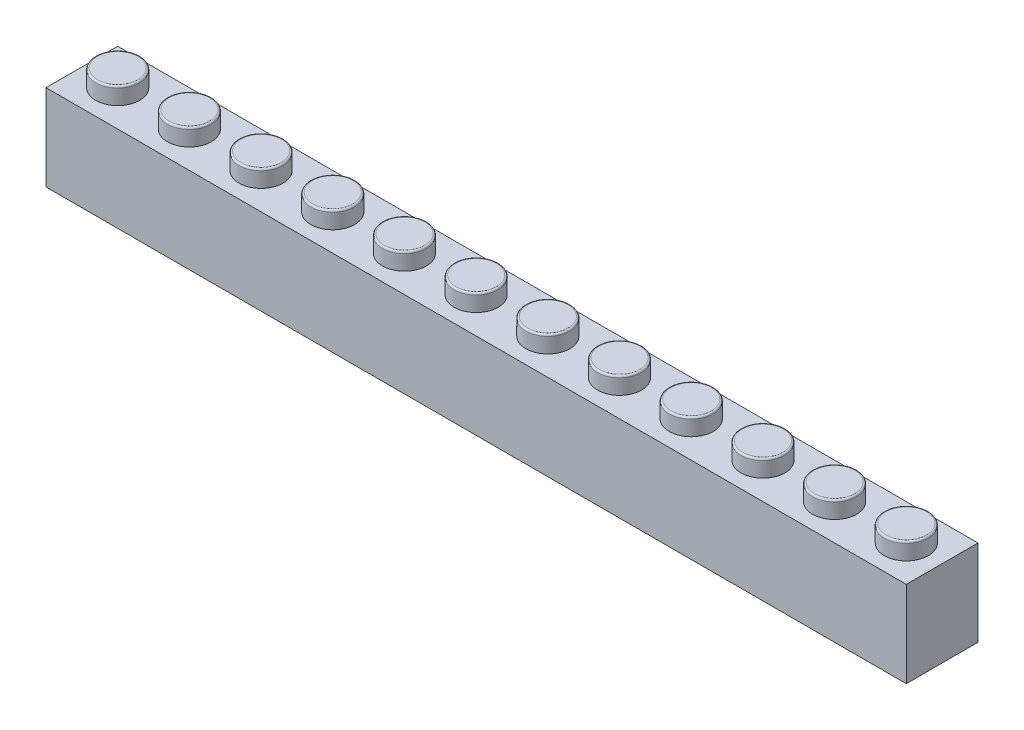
ISO-10303-21;
HEADER;
FILE_DESCRIPTION(('STEP AP214'),'2;1');
FILE_NAME('part.step','',(''),(''),'','','');
FILE_SCHEMA(('AUTOMOTIVE_DESIGN { 1 0 10303 214 1 1 1 1 }'));
ENDSEC;
DATA;
#1=APPLICATION_CONTEXT('core data for automotive mechanical design processes');
#2=APPLICATION_PROTOCOL_DEFINITION('international standard','automotive_design',2000,#1);
#3=PRODUCT_CONTEXT('',#1,'mechanical');
#4=PRODUCT('Part','Part','',(#3));
#5=PRODUCT_RELATED_PRODUCT_CATEGORY('part','',(#4));
#6=PRODUCT_DEFINITION_FORMATION('','',#4);
#7=PRODUCT_DEFINITION_CONTEXT('part definition',#1,'design');
#8=PRODUCT_DEFINITION('design','',#6,#7);
#9=PRODUCT_DEFINITION_SHAPE('','',#8);
#10=(LENGTH_UNIT() NAMED_UNIT(*) SI_UNIT(.MILLI.,.METRE.));
#11=(NAMED_UNIT(*) PLANE_ANGLE_UNIT() SI_UNIT($,.RADIAN.));
#12=(NAMED_UNIT(*) SI_UNIT($,.STERADIAN.) SOLID_ANGLE_UNIT());
#13=UNCERTAINTY_MEASURE_WITH_UNIT(LENGTH_MEASURE(1.E-05),#10,'distance_accuracy_value','');
#14=(GEOMETRIC_REPRESENTATION_CONTEXT(3) GLOBAL_UNCERTAINTY_ASSIGNED_CONTEXT((#13)) GLOBAL_UNIT_ASSIGNED_CONTEXT((#10,
#11,#12)) REPRESENTATION_CONTEXT('',''));
#15=CARTESIAN_POINT('',(0.,0.,0.));
#16=DIRECTION('',(0.,0.,1.));
#17=DIRECTION('',(1.,0.,0.));
#18=AXIS2_PLACEMENT_3D('',#15,#16,#17);
#19=CARTESIAN_POINT('',(1.6,8.5,6.4));
#20=DIRECTION('',(0.,-1.,0.));
#21=DIRECTION('',(0.,0.,-1.));
#22=AXIS2_PLACEMENT_3D('',#19,#20,#21);
#23=PLANE('',#22);
#24=CARTESIAN_POINT('',(80.,8.5,4.));
#25=DIRECTION('',(0.,-1.,0.));
#26=DIRECTION('',(0.,0.,-1.));
#27=AXIS2_PLACEMENT_3D('',#24,#25,#26);
#28=CIRCLE('',#27,1.59999999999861);
#29=CARTESIAN_POINT('',(80.,8.5,2.40000000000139));
#30=VERTEX_POINT('',#29);
#31=EDGE_CURVE('E977',#30,#30,#28,.T.);
#32=ORIENTED_EDGE('',*,*,#31,.F.);
#33=EDGE_LOOP('',(#32));
#34=FACE_BOUND('',#33,.T.);
#35=CARTESIAN_POINT('',(64.,8.5,4.));
#36=DIRECTION('',(0.,-1.,0.));
#37=DIRECTION('',(0.,0.,-1.));
#38=AXIS2_PLACEMENT_3D('',#35,#36,#37);
#39=CIRCLE('',#38,1.59999999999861);
#40=CARTESIAN_POINT('',(64.,8.5,2.40000000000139));
#41=VERTEX_POINT('',#40);
#42=EDGE_CURVE('E965',#41,#41,#39,.T.);
#43=ORIENTED_EDGE('',*,*,#42,.F.);
#44=EDGE_LOOP('',(#43));
#45=FACE_BOUND('',#44,.T.);
#46=CARTESIAN_POINT('',(48.,8.5,4.));
#47=DIRECTION('',(0.,-1.,0.));
#48=DIRECTION('',(0.,0.,-1.));
#49=AXIS2_PLACEMENT_3D('',#46,#47,#48);
#50=CIRCLE('',#49,1.59999999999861);
#51=CARTESIAN_POINT('',(48.,8.5,2.40000000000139));
#52=VERTEX_POINT('',#51);
#53=EDGE_CURVE('E953',#52,#52,#50,.T.);
#54=ORIENTED_EDGE('',*,*,#53,.F.);
#55=EDGE_LOOP('',(#54));
#56=FACE_BOUND('',#55,.T.);
#57=CARTESIAN_POINT('',(32.,8.5,4.));
#58=DIRECTION('',(0.,-1.,0.));
#59=DIRECTION('',(0.,0.,-1.));
#60=AXIS2_PLACEMENT_3D('',#57,#58,#59);
#61=CIRCLE('',#60,1.59999999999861);
#62=CARTESIAN_POINT('',(32.,8.5,2.40000000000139));
#63=VERTEX_POINT('',#62);
#64=EDGE_CURVE('E941',#63,#63,#61,.T.);
#65=ORIENTED_EDGE('',*,*,#64,.F.);
#66=EDGE_LOOP('',(#65));
#67=FACE_BOUND('',#66,.T.);
#68=CARTESIAN_POINT('',(16.,8.5,4.));
#69=DIRECTION('',(0.,-1.,0.));
#70=DIRECTION('',(0.,0.,-1.));
#71=AXIS2_PLACEMENT_3D('',#68,#69,#70);
#72=CIRCLE('',#71,1.59999999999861);
#73=CARTESIAN_POINT('',(16.,8.5,2.40000000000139));
#74=VERTEX_POINT('',#73);
#75=EDGE_CURVE('E929',#74,#74,#72,.T.);
#76=ORIENTED_EDGE('',*,*,#75,.F.);
#77=EDGE_LOOP('',(#76));
#78=FACE_BOUND('',#77,.T.);
#79=DIRECTION('',(0.,0.,-1.));
#80=VECTOR('',#79,1.);
#81=CARTESIAN_POINT('',(1.6,8.5,6.4));
#82=LINE('',#81,#80);
#83=CARTESIAN_POINT('',(1.6,8.5,6.4));
#84=VERTEX_POINT('',#83);
#85=CARTESIAN_POINT('',(1.6,8.5,1.6));
#86=VERTEX_POINT('',#85);
#87=EDGE_CURVE('E117',#84,#86,#82,.T.);
#88=ORIENTED_EDGE('',*,*,#87,.T.);
#89=DIRECTION('',(1.,0.,0.));
#90=VECTOR('',#89,1.);
#91=CARTESIAN_POINT('',(1.6,8.5,1.6));
#92=LINE('',#91,#90);
#93=CARTESIAN_POINT('',(94.4,8.5,1.6));
#94=VERTEX_POINT('',#93);
#95=EDGE_CURVE('E123',#86,#94,#92,.T.);
#96=ORIENTED_EDGE('',*,*,#95,.T.);
#97=DIRECTION('',(0.,0.,1.));
#98=VECTOR('',#97,1.);
#99=CARTESIAN_POINT('',(94.4,8.5,6.4));
#100=LINE('',#99,#98);
#101=CARTESIAN_POINT('',(94.4,8.5,6.4));
#102=VERTEX_POINT('',#101);
#103=EDGE_CURVE('E100',#94,#102,#100,.T.);
#104=ORIENTED_EDGE('',*,*,#103,.T.);
#105=DIRECTION('',(-1.,0.,0.));
#106=VECTOR('',#105,1.);
#107=CARTESIAN_POINT('',(1.6,8.5,6.4));
#108=LINE('',#107,#106);
#109=EDGE_CURVE('E126',#102,#84,#108,.T.);
#110=ORIENTED_EDGE('',*,*,#109,.T.);
#111=EDGE_LOOP('',(#88,#96,#104,#110));
#112=FACE_BOUND('',#111,.T.);
#113=CARTESIAN_POINT('',(4.,8.5,4.));
#114=DIRECTION('',(0.,-1.,0.));
#115=DIRECTION('',(0.,0.,-1.));
#116=AXIS2_PLACEMENT_3D('',#113,#114,#115);
#117=CIRCLE('',#116,1.6);
#118=CARTESIAN_POINT('',(4.,8.5,2.4));
#119=VERTEX_POINT('',#118);
#120=EDGE_CURVE('E843',#119,#119,#117,.T.);
#121=ORIENTED_EDGE('',*,*,#120,.F.);
#122=EDGE_LOOP('',(#121));
#123=FACE_BOUND('',#122,.T.);
#124=CARTESIAN_POINT('',(12.,8.5,4.));
#125=DIRECTION('',(0.,-1.,0.));
#126=DIRECTION('',(0.,0.,-1.));
#127=AXIS2_PLACEMENT_3D('',#124,#125,#126);
#128=CIRCLE('',#127,1.6);
#129=CARTESIAN_POINT('',(12.,8.5,2.4));
#130=VERTEX_POINT('',#129);
#131=EDGE_CURVE('E857',#130,#130,#128,.T.);
#132=ORIENTED_EDGE('',*,*,#131,.F.);
#133=EDGE_LOOP('',(#132));
#134=FACE_BOUND('',#133,.T.);
#135=CARTESIAN_POINT('',(20.,8.5,4.));
#136=DIRECTION('',(0.,-1.,0.));
#137=DIRECTION('',(0.,0.,-1.));
#138=AXIS2_PLACEMENT_3D('',#135,#136,#137);
#139=CIRCLE('',#138,1.6);
#140=CARTESIAN_POINT('',(20.,8.5,2.4));
#141=VERTEX_POINT('',#140);
#142=EDGE_CURVE('E863',#141,#141,#139,.T.);
#143=ORIENTED_EDGE('',*,*,#142,.F.);
#144=EDGE_LOOP('',(#143));
#145=FACE_BOUND('',#144,.T.);
#146=CARTESIAN_POINT('',(28.,8.5,4.));
#147=DIRECTION('',(0.,-1.,0.));
#148=DIRECTION('',(0.,0.,-1.));
#149=AXIS2_PLACEMENT_3D('',#146,#147,#148);
#150=CIRCLE('',#149,1.6);
#151=CARTESIAN_POINT('',(28.,8.5,2.4));
#152=VERTEX_POINT('',#151);
#153=EDGE_CURVE('E869',#152,#152,#150,.T.);
#154=ORIENTED_EDGE('',*,*,#153,.F.);
#155=EDGE_LOOP('',(#154));
#156=FACE_BOUND('',#155,.T.);
#157=CARTESIAN_POINT('',(36.,8.5,4.));
#158=DIRECTION('',(0.,-1.,0.));
#159=DIRECTION('',(0.,0.,-1.));
#160=AXIS2_PLACEMENT_3D('',#157,#158,#159);
#161=CIRCLE('',#160,1.6);
#162=CARTESIAN_POINT('',(36.,8.5,2.4));
#163=VERTEX_POINT('',#162);
#164=EDGE_CURVE('E875',#163,#163,#161,.T.);
#165=ORIENTED_EDGE('',*,*,#164,.F.);
#166=EDGE_LOOP('',(#165));
#167=FACE_BOUND('',#166,.T.);
#168=CARTESIAN_POINT('',(44.,8.5,4.));
#169=DIRECTION('',(0.,-1.,0.));
#170=DIRECTION('',(0.,0.,-1.));
#171=AXIS2_PLACEMENT_3D('',#168,#169,#170);
#172=CIRCLE('',#171,1.6);
#173=CARTESIAN_POINT('',(44.,8.5,2.4));
#174=VERTEX_POINT('',#173);
#175=EDGE_CURVE('E881',#174,#174,#172,.T.);
#176=ORIENTED_EDGE('',*,*,#175,.F.);
#177=EDGE_LOOP('',(#176));
#178=FACE_BOUND('',#177,.T.);
#179=CARTESIAN_POINT('',(52.,8.5,4.));
#180=DIRECTION('',(0.,-1.,0.));
#181=DIRECTION('',(0.,0.,-1.));
#182=AXIS2_PLACEMENT_3D('',#179,#180,#181);
#183=CIRCLE('',#182,1.6);
#184=CARTESIAN_POINT('',(52.,8.5,2.4));
#185=VERTEX_POINT('',#184);
#186=EDGE_CURVE('E887',#185,#185,#183,.T.);
#187=ORIENTED_EDGE('',*,*,#186,.F.);
#188=EDGE_LOOP('',(#187));
#189=FACE_BOUND('',#188,.T.);
#190=CARTESIAN_POINT('',(60.,8.5,4.));
#191=DIRECTION('',(0.,-1.,0.));
#192=DIRECTION('',(0.,0.,-1.));
#193=AXIS2_PLACEMENT_3D('',#190,#191,#192);
#194=CIRCLE('',#193,1.6);
#195=CARTESIAN_POINT('',(60.,8.5,2.4));
#196=VERTEX_POINT('',#195);
#197=EDGE_CURVE('E893',#196,#196,#194,.T.);
#198=ORIENTED_EDGE('',*,*,#197,.F.);
#199=EDGE_LOOP('',(#198));
#200=FACE_BOUND('',#199,.T.);
#201=CARTESIAN_POINT('',(68.,8.5,4.));
#202=DIRECTION('',(0.,-1.,0.));
#203=DIRECTION('',(0.,0.,-1.));
#204=AXIS2_PLACEMENT_3D('',#201,#202,#203);
#205=CIRCLE('',#204,1.6);
#206=CARTESIAN_POINT('',(68.,8.5,2.4));
#207=VERTEX_POINT('',#206);
#208=EDGE_CURVE('E899',#207,#207,#205,.T.);
#209=ORIENTED_EDGE('',*,*,#208,.F.);
#210=EDGE_LOOP('',(#209));
#211=FACE_BOUND('',#210,.T.);
#212=CARTESIAN_POINT('',(76.,8.5,4.));
#213=DIRECTION('',(0.,-1.,0.));
#214=DIRECTION('',(0.,0.,-1.));
#215=AXIS2_PLACEMENT_3D('',#212,#213,#214);
#216=CIRCLE('',#215,1.6);
#217=CARTESIAN_POINT('',(76.,8.5,2.4));
#218=VERTEX_POINT('',#217);
#219=EDGE_CURVE('E905',#218,#218,#216,.T.);
#220=ORIENTED_EDGE('',*,*,#219,.F.);
#221=EDGE_LOOP('',(#220));
#222=FACE_BOUND('',#221,.T.);
#223=CARTESIAN_POINT('',(84.,8.5,4.));
#224=DIRECTION('',(0.,-1.,0.));
#225=DIRECTION('',(0.,0.,-1.));
#226=AXIS2_PLACEMENT_3D('',#223,#224,#225);
#227=CIRCLE('',#226,1.6);
#228=CARTESIAN_POINT('',(84.,8.5,2.4));
#229=VERTEX_POINT('',#228);
#230=EDGE_CURVE('E911',#229,#229,#227,.T.);
#231=ORIENTED_EDGE('',*,*,#230,.F.);
#232=EDGE_LOOP('',(#231));
#233=FACE_BOUND('',#232,.T.);
#234=CARTESIAN_POINT('',(92.,8.5,4.));
#235=DIRECTION('',(0.,-1.,0.));
#236=DIRECTION('',(0.,0.,-1.));
#237=AXIS2_PLACEMENT_3D('',#234,#235,#236);
#238=CIRCLE('',#237,1.6);
#239=CARTESIAN_POINT('',(92.,8.5,2.4));
#240=VERTEX_POINT('',#239);
#241=EDGE_CURVE('E917',#240,#240,#238,.T.);
#242=ORIENTED_EDGE('',*,*,#241,.F.);
#243=EDGE_LOOP('',(#242));
#244=FACE_BOUND('',#243,.T.);
#245=CARTESIAN_POINT('',(8.,8.5,4.));
#246=DIRECTION('',(0.,-1.,0.));
#247=DIRECTION('',(0.,0.,-1.));
#248=AXIS2_PLACEMENT_3D('',#245,#246,#247);
#249=CIRCLE('',#248,1.59999999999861);
#250=CARTESIAN_POINT('',(8.,8.5,2.40000000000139));
#251=VERTEX_POINT('',#250);
#252=EDGE_CURVE('E923',#251,#251,#249,.T.);
#253=ORIENTED_EDGE('',*,*,#252,.F.);
#254=EDGE_LOOP('',(#253));
#255=FACE_BOUND('',#254,.T.);
#256=CARTESIAN_POINT('',(24.,8.5,4.));
#257=DIRECTION('',(0.,-1.,0.));
#258=DIRECTION('',(0.,0.,-1.));
#259=AXIS2_PLACEMENT_3D('',#256,#257,#258);
#260=CIRCLE('',#259,1.59999999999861);
#261=CARTESIAN_POINT('',(24.,8.5,2.40000000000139));
#262=VERTEX_POINT('',#261);
#263=EDGE_CURVE('E935',#262,#262,#260,.T.);
#264=ORIENTED_EDGE('',*,*,#263,.F.);
#265=EDGE_LOOP('',(#264));
#266=FACE_BOUND('',#265,.T.);
#267=CARTESIAN_POINT('',(40.,8.5,4.));
#268=DIRECTION('',(0.,-1.,0.));
#269=DIRECTION('',(0.,0.,-1.));
#270=AXIS2_PLACEMENT_3D('',#267,#268,#269);
#271=CIRCLE('',#270,1.59999999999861);
#272=CARTESIAN_POINT('',(40.,8.5,2.40000000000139));
#273=VERTEX_POINT('',#272);
#274=EDGE_CURVE('E947',#273,#273,#271,.T.);
#275=ORIENTED_EDGE('',*,*,#274,.F.);
#276=EDGE_LOOP('',(#275));
#277=FACE_BOUND('',#276,.T.);
#278=CARTESIAN_POINT('',(56.,8.5,4.));
#279=DIRECTION('',(0.,-1.,0.));
#280=DIRECTION('',(0.,0.,-1.));
#281=AXIS2_PLACEMENT_3D('',#278,#279,#280);
#282=CIRCLE('',#281,1.59999999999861);
#283=CARTESIAN_POINT('',(56.,8.5,2.40000000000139));
#284=VERTEX_POINT('',#283);
#285=EDGE_CURVE('E959',#284,#284,#282,.T.);
#286=ORIENTED_EDGE('',*,*,#285,.F.);
#287=EDGE_LOOP('',(#286));
#288=FACE_BOUND('',#287,.T.);
#289=CARTESIAN_POINT('',(72.,8.5,4.));
#290=DIRECTION('',(0.,-1.,0.));
#291=DIRECTION('',(0.,0.,-1.));
#292=AXIS2_PLACEMENT_3D('',#289,#290,#291);
#293=CIRCLE('',#292,1.59999999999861);
#294=CARTESIAN_POINT('',(72.,8.5,2.40000000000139));
#295=VERTEX_POINT('',#294);
#296=EDGE_CURVE('E971',#295,#295,#293,.T.);
#297=ORIENTED_EDGE('',*,*,#296,.F.);
#298=EDGE_LOOP('',(#297));
#299=FACE_BOUND('',#298,.T.);
#300=CARTESIAN_POINT('',(88.,8.5,4.));
#301=DIRECTION('',(0.,-1.,0.));
#302=DIRECTION('',(0.,0.,-1.));
#303=AXIS2_PLACEMENT_3D('',#300,#301,#302);
#304=CIRCLE('',#303,1.59999999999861);
#305=CARTESIAN_POINT('',(88.,8.5,2.40000000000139));
#306=VERTEX_POINT('',#305);
#307=EDGE_CURVE('E982',#306,#306,#304,.T.);
#308=ORIENTED_EDGE('',*,*,#307,.F.);
#309=EDGE_LOOP('',(#308));
#310=FACE_BOUND('',#309,.T.);
#311=ADVANCED_FACE('F27',(#34,#45,#56,#67,#78,#112,#123,#134,#145,#156,#167,#178,#189,#200,#211,
#222,#233,#244,#255,#266,#277,#288,#299,#310),#23,.T.);
#312=CARTESIAN_POINT('',(0.,9.6,8.));
#313=DIRECTION('',(0.,-1.,0.));
#314=DIRECTION('',(0.,0.,-1.));
#315=AXIS2_PLACEMENT_3D('',#312,#313,#314);
#316=PLANE('',#315);
#317=CARTESIAN_POINT('',(4.,9.6,4.));
#318=DIRECTION('',(0.,-1.,0.));
#319=DIRECTION('',(0.,0.,-1.));
#320=AXIS2_PLACEMENT_3D('',#317,#318,#319);
#321=CIRCLE('',#320,2.45618514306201);
#322=CARTESIAN_POINT('',(4.,9.6,1.54381485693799));
#323=VERTEX_POINT('',#322);
#324=EDGE_CURVE('E161',#323,#323,#321,.F.);
#325=ORIENTED_EDGE('',*,*,#324,.F.);
#326=EDGE_LOOP('',(#325));
#327=FACE_BOUND('',#326,.T.);
#328=DIRECTION('',(-1.,0.,0.));
#329=VECTOR('',#328,1.);
#330=CARTESIAN_POINT('',(0.,9.6,0.));
#331=LINE('',#330,#329);
#332=CARTESIAN_POINT('',(96.,9.6,0.));
#333=VERTEX_POINT('',#332);
#334=CARTESIAN_POINT('',(0.,9.6,0.));
#335=VERTEX_POINT('',#334);
#336=EDGE_CURVE('E140',#333,#335,#331,.T.);
#337=ORIENTED_EDGE('',*,*,#336,.T.);
#338=DIRECTION('',(0.,0.,-1.));
#339=VECTOR('',#338,1.);
#340=CARTESIAN_POINT('',(0.,9.6,8.));
#341=LINE('',#340,#339);
#342=CARTESIAN_POINT('',(0.,9.6,8.));
#343=VERTEX_POINT('',#342);
#344=EDGE_CURVE('E149',#343,#335,#341,.T.);
#345=ORIENTED_EDGE('',*,*,#344,.F.);
#346=DIRECTION('',(-1.,0.,0.));
#347=VECTOR('',#346,1.);
#348=CARTESIAN_POINT('',(0.,9.6,8.));
#349=LINE('',#348,#347);
#350=CARTESIAN_POINT('',(96.,9.6,8.));
#351=VERTEX_POINT('',#350);
#352=EDGE_CURVE('E50',#351,#343,#349,.T.);
#353=ORIENTED_EDGE('',*,*,#352,.F.);
#354=DIRECTION('',(0.,0.,-1.));
#355=VECTOR('',#354,1.);
#356=CARTESIAN_POINT('',(96.,9.6,8.));
#357=LINE('',#356,#355);
#358=EDGE_CURVE('E152',#351,#333,#357,.T.);
#359=ORIENTED_EDGE('',*,*,#358,.T.);
#360=EDGE_LOOP('',(#337,#345,#353,#359));
#361=FACE_BOUND('',#360,.T.);
#362=CARTESIAN_POINT('',(12.,9.6,4.));
#363=DIRECTION('',(0.,-1.,0.));
#364=DIRECTION('',(0.,0.,-1.));
#365=AXIS2_PLACEMENT_3D('',#362,#363,#364);
#366=CIRCLE('',#365,2.45618514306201);
#367=CARTESIAN_POINT('',(12.,9.6,1.54381485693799));
#368=VERTEX_POINT('',#367);
#369=EDGE_CURVE('E170',#368,#368,#366,.F.);
#370=ORIENTED_EDGE('',*,*,#369,.F.);
#371=EDGE_LOOP('',(#370));
#372=FACE_BOUND('',#371,.T.);
#373=CARTESIAN_POINT('',(20.,9.6,4.));
#374=DIRECTION('',(0.,-1.,0.));
#375=DIRECTION('',(0.,0.,-1.));
#376=AXIS2_PLACEMENT_3D('',#373,#374,#375);
#377=CIRCLE('',#376,2.45618514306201);
#378=CARTESIAN_POINT('',(20.,9.6,1.54381485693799));
#379=VERTEX_POINT('',#378);
#380=EDGE_CURVE('E173',#379,#379,#377,.F.);
#381=ORIENTED_EDGE('',*,*,#380,.F.);
#382=EDGE_LOOP('',(#381));
#383=FACE_BOUND('',#382,.T.);
#384=CARTESIAN_POINT('',(28.,9.6,4.));
#385=DIRECTION('',(0.,-1.,0.));
#386=DIRECTION('',(0.,0.,-1.));
#387=AXIS2_PLACEMENT_3D('',#384,#385,#386);
#388=CIRCLE('',#387,2.45618514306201);
#389=CARTESIAN_POINT('',(28.,9.6,1.54381485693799));
#390=VERTEX_POINT('',#389);
#391=EDGE_CURVE('E182',#390,#390,#388,.F.);
#392=ORIENTED_EDGE('',*,*,#391,.F.);
#393=EDGE_LOOP('',(#392));
#394=FACE_BOUND('',#393,.T.);
#395=CARTESIAN_POINT('',(36.,9.6,4.));
#396=DIRECTION('',(0.,-1.,0.));
#397=DIRECTION('',(0.,0.,-1.));
#398=AXIS2_PLACEMENT_3D('',#395,#396,#397);
#399=CIRCLE('',#398,2.45618514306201);
#400=CARTESIAN_POINT('',(36.,9.6,1.54381485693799));
#401=VERTEX_POINT('',#400);
#402=EDGE_CURVE('E191',#401,#401,#399,.F.);
#403=ORIENTED_EDGE('',*,*,#402,.F.);
#404=EDGE_LOOP('',(#403));
#405=FACE_BOUND('',#404,.T.);
#406=CARTESIAN_POINT('',(44.,9.6,4.));
#407=DIRECTION('',(0.,-1.,0.));
#408=DIRECTION('',(0.,0.,-1.));
#409=AXIS2_PLACEMENT_3D('',#406,#407,#408);
#410=CIRCLE('',#409,2.45618514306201);
#411=CARTESIAN_POINT('',(44.,9.6,1.54381485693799));
#412=VERTEX_POINT('',#411);
#413=EDGE_CURVE('E200',#412,#412,#410,.F.);
#414=ORIENTED_EDGE('',*,*,#413,.F.);
#415=EDGE_LOOP('',(#414));
#416=FACE_BOUND('',#415,.T.);
#417=CARTESIAN_POINT('',(52.,9.6,4.));
#418=DIRECTION('',(0.,-1.,0.));
#419=DIRECTION('',(0.,0.,-1.));
#420=AXIS2_PLACEMENT_3D('',#417,#418,#419);
#421=CIRCLE('',#420,2.45618514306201);
#422=CARTESIAN_POINT('',(52.,9.6,1.54381485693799));
#423=VERTEX_POINT('',#422);
#424=EDGE_CURVE('E209',#423,#423,#421,.F.);
#425=ORIENTED_EDGE('',*,*,#424,.F.);
#426=EDGE_LOOP('',(#425));
#427=FACE_BOUND('',#426,.T.);
#428=CARTESIAN_POINT('',(60.,9.6,4.));
#429=DIRECTION('',(0.,-1.,0.));
#430=DIRECTION('',(0.,0.,-1.));
#431=AXIS2_PLACEMENT_3D('',#428,#429,#430);
#432=CIRCLE('',#431,2.45618514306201);
#433=CARTESIAN_POINT('',(60.,9.6,1.54381485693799));
#434=VERTEX_POINT('',#433);
#435=EDGE_CURVE('E218',#434,#434,#432,.F.);
#436=ORIENTED_EDGE('',*,*,#435,.F.);
#437=EDGE_LOOP('',(#436));
#438=FACE_BOUND('',#437,.T.);
#439=CARTESIAN_POINT('',(68.,9.6,4.));
#440=DIRECTION('',(0.,-1.,0.));
#441=DIRECTION('',(0.,0.,-1.));
#442=AXIS2_PLACEMENT_3D('',#439,#440,#441);
#443=CIRCLE('',#442,2.45618514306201);
#444=CARTESIAN_POINT('',(68.,9.6,1.54381485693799));
#445=VERTEX_POINT('',#444);
#446=EDGE_CURVE('E227',#445,#445,#443,.F.);
#447=ORIENTED_EDGE('',*,*,#446,.F.);
#448=EDGE_LOOP('',(#447));
#449=FACE_BOUND('',#448,.T.);
#450=CARTESIAN_POINT('',(76.,9.6,4.));
#451=DIRECTION('',(0.,-1.,0.));
#452=DIRECTION('',(0.,0.,-1.));
#453=AXIS2_PLACEMENT_3D('',#450,#451,#452);
#454=CIRCLE('',#453,2.45618514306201);
#455=CARTESIAN_POINT('',(76.,9.6,1.54381485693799));
#456=VERTEX_POINT('',#455);
#457=EDGE_CURVE('E236',#456,#456,#454,.F.);
#458=ORIENTED_EDGE('',*,*,#457,.F.);
#459=EDGE_LOOP('',(#458));
#460=FACE_BOUND('',#459,.T.);
#461=CARTESIAN_POINT('',(84.,9.6,4.));
#462=DIRECTION('',(0.,-1.,0.));
#463=DIRECTION('',(0.,0.,-1.));
#464=AXIS2_PLACEMENT_3D('',#461,#462,#463);
#465=CIRCLE('',#464,2.45618514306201);
#466=CARTESIAN_POINT('',(84.,9.6,1.54381485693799));
#467=VERTEX_POINT('',#466);
#468=EDGE_CURVE('E245',#467,#467,#465,.F.);
#469=ORIENTED_EDGE('',*,*,#468,.F.);
#470=EDGE_LOOP('',(#469));
#471=FACE_BOUND('',#470,.T.);
#472=CARTESIAN_POINT('',(92.,9.6,4.));
#473=DIRECTION('',(0.,-1.,0.));
#474=DIRECTION('',(0.,0.,-1.));
#475=AXIS2_PLACEMENT_3D('',#472,#473,#474);
#476=CIRCLE('',#475,2.45618514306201);
#477=CARTESIAN_POINT('',(92.,9.6,1.54381485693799));
#478=VERTEX_POINT('',#477);
#479=EDGE_CURVE('E254',#478,#478,#476,.F.);
#480=ORIENTED_EDGE('',*,*,#479,.F.);
#481=EDGE_LOOP('',(#480));
#482=FACE_BOUND('',#481,.T.);
#483=ADVANCED_FACE('F275',(#327,#361,#372,#383,#394,#405,#416,#427,#438,#449,#460,#471,#482),
#316,.F.);
#484=CARTESIAN_POINT('',(0.,0.,8.));
#485=DIRECTION('',(1.,0.,0.));
#486=DIRECTION('',(0.,0.,-1.));
#487=AXIS2_PLACEMENT_3D('',#484,#485,#486);
#488=PLANE('',#487);
#489=DIRECTION('',(0.,-1.,0.));
#490=VECTOR('',#489,1.);
#491=CARTESIAN_POINT('',(0.,0.,0.));
#492=LINE('',#491,#490);
#493=CARTESIAN_POINT('',(0.,0.,0.));
#494=VERTEX_POINT('',#493);
#495=EDGE_CURVE('E131',#335,#494,#492,.T.);
#496=ORIENTED_EDGE('',*,*,#495,.T.);
#497=DIRECTION('',(0.,0.,-1.));
#498=VECTOR('',#497,1.);
#499=CARTESIAN_POINT('',(0.,0.,8.));
#500=LINE('',#499,#498);
#501=CARTESIAN_POINT('',(0.,0.,8.));
#502=VERTEX_POINT('',#501);
#503=EDGE_CURVE('E158',#502,#494,#500,.T.);
#504=ORIENTED_EDGE('',*,*,#503,.F.);
#505=DIRECTION('',(0.,-1.,0.));
#506=VECTOR('',#505,1.);
#507=CARTESIAN_POINT('',(0.,0.,8.));
#508=LINE('',#507,#506);
#509=EDGE_CURVE('E142',#343,#502,#508,.T.);
#510=ORIENTED_EDGE('',*,*,#509,.F.);
#511=ORIENTED_EDGE('',*,*,#344,.T.);
#512=EDGE_LOOP('',(#496,#504,#510,#511));
#513=FACE_BOUND('',#512,.T.);
#514=ADVANCED_FACE('F283',(#513),#488,.F.);
#515=CARTESIAN_POINT('',(0.,0.,8.));
#516=DIRECTION('',(0.,1.,0.));
#517=DIRECTION('',(0.,0.,1.));
#518=AXIS2_PLACEMENT_3D('',#515,#516,#517);
#519=PLANE('',#518);
#520=DIRECTION('',(1.,0.,0.));
#521=VECTOR('',#520,1.);
#522=CARTESIAN_POINT('',(1.6,0.,1.6));
#523=LINE('',#522,#521);
#524=CARTESIAN_POINT('',(1.6,0.,1.6));
#525=VERTEX_POINT('',#524);
#526=CARTESIAN_POINT('',(94.4,0.,1.6));
#527=VERTEX_POINT('',#526);
#528=EDGE_CURVE('E108',#525,#527,#523,.T.);
#529=ORIENTED_EDGE('',*,*,#528,.F.);
#530=DIRECTION('',(0.,0.,-1.));
#531=VECTOR('',#530,1.);
#532=CARTESIAN_POINT('',(1.6,0.,6.4));
#533=LINE('',#532,#531);
#534=CARTESIAN_POINT('',(1.6,0.,6.4));
#535=VERTEX_POINT('',#534);
#536=EDGE_CURVE('E42',#535,#525,#533,.T.);
#537=ORIENTED_EDGE('',*,*,#536,.F.);
#538=DIRECTION('',(-1.,0.,0.));
#539=VECTOR('',#538,1.);
#540=CARTESIAN_POINT('',(1.6,0.,6.4));
#541=LINE('',#540,#539);
#542=CARTESIAN_POINT('',(94.4,0.,6.4));
#543=VERTEX_POINT('',#542);
#544=EDGE_CURVE('E115',#543,#535,#541,.T.);
#545=ORIENTED_EDGE('',*,*,#544,.F.);
#546=DIRECTION('',(0.,0.,1.));
#547=VECTOR('',#546,1.);
#548=CARTESIAN_POINT('',(94.4,0.,6.4));
#549=LINE('',#548,#547);
#550=EDGE_CURVE('E97',#527,#543,#549,.T.);
#551=ORIENTED_EDGE('',*,*,#550,.F.);
#552=EDGE_LOOP('',(#529,#537,#545,#551));
#553=FACE_BOUND('',#552,.T.);
#554=DIRECTION('',(1.,0.,0.));
#555=VECTOR('',#554,1.);
#556=CARTESIAN_POINT('',(0.,0.,0.));
#557=LINE('',#556,#555);
#558=CARTESIAN_POINT('',(96.,0.,0.));
#559=VERTEX_POINT('',#558);
#560=EDGE_CURVE('E136',#494,#559,#557,.T.);
#561=ORIENTED_EDGE('',*,*,#560,.T.);
#562=DIRECTION('',(0.,0.,-1.));
#563=VECTOR('',#562,1.);
#564=CARTESIAN_POINT('',(96.,0.,8.));
#565=LINE('',#564,#563);
#566=CARTESIAN_POINT('',(96.,0.,8.));
#567=VERTEX_POINT('',#566);
#568=EDGE_CURVE('E155',#567,#559,#565,.T.);
#569=ORIENTED_EDGE('',*,*,#568,.F.);
#570=DIRECTION('',(1.,0.,0.));
#571=VECTOR('',#570,1.);
#572=CARTESIAN_POINT('',(0.,0.,8.));
#573=LINE('',#572,#571);
#574=EDGE_CURVE('E144',#502,#567,#573,.T.);
#575=ORIENTED_EDGE('',*,*,#574,.F.);
#576=ORIENTED_EDGE('',*,*,#503,.T.);
#577=EDGE_LOOP('',(#561,#569,#575,#576));
#578=FACE_BOUND('',#577,.T.);
#579=ADVANCED_FACE('F112',(#553,#578),#519,.F.);
#580=CARTESIAN_POINT('',(96.,0.,8.));
#581=DIRECTION('',(-1.,0.,0.));
#582=DIRECTION('',(0.,0.,1.));
#583=AXIS2_PLACEMENT_3D('',#580,#581,#582);
#584=PLANE('',#583);
#585=DIRECTION('',(0.,1.,0.));
#586=VECTOR('',#585,1.);
#587=CARTESIAN_POINT('',(96.,0.,0.));
#588=LINE('',#587,#586);
#589=EDGE_CURVE('E138',#559,#333,#588,.T.);
#590=ORIENTED_EDGE('',*,*,#589,.T.);
#591=ORIENTED_EDGE('',*,*,#358,.F.);
#592=DIRECTION('',(0.,1.,0.));
#593=VECTOR('',#592,1.);
#594=CARTESIAN_POINT('',(96.,0.,8.));
#595=LINE('',#594,#593);
#596=EDGE_CURVE('E146',#567,#351,#595,.T.);
#597=ORIENTED_EDGE('',*,*,#596,.F.);
#598=ORIENTED_EDGE('',*,*,#568,.T.);
#599=EDGE_LOOP('',(#590,#591,#597,#598));
#600=FACE_BOUND('',#599,.T.);
#601=ADVANCED_FACE('F321',(#600),#584,.F.);
#602=CARTESIAN_POINT('',(0.,9.6,8.));
#603=DIRECTION('',(0.,0.,-1.));
#604=DIRECTION('',(-1.,0.,0.));
#605=AXIS2_PLACEMENT_3D('',#602,#603,#604);
#606=PLANE('',#605);
#607=ORIENTED_EDGE('',*,*,#509,.T.);
#608=ORIENTED_EDGE('',*,*,#574,.T.);
#609=ORIENTED_EDGE('',*,*,#596,.T.);
#610=ORIENTED_EDGE('',*,*,#352,.T.);
#611=EDGE_LOOP('',(#607,#608,#609,#610));
#612=FACE_BOUND('',#611,.T.);
#613=ADVANCED_FACE('F318',(#612),#606,.F.);
#614=CARTESIAN_POINT('',(0.,9.6,0.));
#615=DIRECTION('',(0.,0.,-1.));
#616=DIRECTION('',(-1.,0.,0.));
#617=AXIS2_PLACEMENT_3D('',#614,#615,#616);
#618=PLANE('',#617);
#619=ORIENTED_EDGE('',*,*,#495,.F.);
#620=ORIENTED_EDGE('',*,*,#336,.F.);
#621=ORIENTED_EDGE('',*,*,#589,.F.);
#622=ORIENTED_EDGE('',*,*,#560,.F.);
#623=EDGE_LOOP('',(#619,#620,#621,#622));
#624=FACE_BOUND('',#623,.T.);
#625=ADVANCED_FACE('F314',(#624),#618,.T.);
#626=CARTESIAN_POINT('',(4.,11.5,4.));
#627=DIRECTION('',(0.,-1.,0.));
#628=DIRECTION('',(0.,0.,-1.));
#629=AXIS2_PLACEMENT_3D('',#626,#627,#628);
#630=CYLINDRICAL_SURFACE('',#629,2.45618514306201);
#631=CARTESIAN_POINT('',(4.,11.3,4.));
#632=DIRECTION('',(0.,1.,0.));
#633=DIRECTION('',(0.,0.,1.));
#634=AXIS2_PLACEMENT_3D('',#631,#632,#633);
#635=CIRCLE('',#634,2.45618514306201);
#636=CARTESIAN_POINT('',(4.,11.3,1.54381485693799));
#637=VERTEX_POINT('',#636);
#638=EDGE_CURVE('E167',#637,#637,#635,.F.);
#639=CARTESIAN_POINT('',(4.,11.3,1.54381485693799));
#640=CARTESIAN_POINT('',(4.,11.2822916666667,1.54381485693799));
#641=CARTESIAN_POINT('',(4.,11.2645833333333,1.54381485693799));
#642=CARTESIAN_POINT('',(4.,11.2291666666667,1.54381485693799));
#643=CARTESIAN_POINT('',(4.,11.2114583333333,1.54381485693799));
#644=CARTESIAN_POINT('',(4.,11.1760416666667,1.54381485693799));
#645=CARTESIAN_POINT('',(4.,11.1583333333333,1.54381485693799));
#646=CARTESIAN_POINT('',(4.,11.1229166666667,1.54381485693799));
#647=CARTESIAN_POINT('',(4.,11.1052083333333,1.54381485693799));
#648=CARTESIAN_POINT('',(4.,11.0697916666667,1.54381485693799));
#649=CARTESIAN_POINT('',(4.,11.0520833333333,1.54381485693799));
#650=CARTESIAN_POINT('',(4.,11.0166666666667,1.54381485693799));
#651=CARTESIAN_POINT('',(4.,10.9989583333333,1.54381485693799));
#652=CARTESIAN_POINT('',(4.,10.9635416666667,1.54381485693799));
#653=CARTESIAN_POINT('',(4.,10.9458333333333,1.54381485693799));
#654=CARTESIAN_POINT('',(4.,10.9104166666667,1.54381485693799));
#655=CARTESIAN_POINT('',(4.,10.8927083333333,1.54381485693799));
#656=CARTESIAN_POINT('',(4.,10.8572916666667,1.54381485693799));
#657=CARTESIAN_POINT('',(4.,10.8395833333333,1.54381485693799));
#658=CARTESIAN_POINT('',(4.,10.8041666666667,1.54381485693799));
#659=CARTESIAN_POINT('',(4.,10.7864583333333,1.54381485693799));
#660=CARTESIAN_POINT('',(4.,10.7510416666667,1.54381485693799));
#661=CARTESIAN_POINT('',(4.,10.7333333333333,1.54381485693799));
#662=CARTESIAN_POINT('',(4.,10.6979166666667,1.54381485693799));
#663=CARTESIAN_POINT('',(4.,10.6802083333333,1.54381485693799));
#664=CARTESIAN_POINT('',(4.,10.6447916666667,1.54381485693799));
#665=CARTESIAN_POINT('',(4.,10.6270833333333,1.54381485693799));
#666=CARTESIAN_POINT('',(4.,10.5916666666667,1.54381485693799));
#667=CARTESIAN_POINT('',(4.,10.5739583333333,1.54381485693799));
#668=CARTESIAN_POINT('',(4.,10.5385416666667,1.54381485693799));
#669=CARTESIAN_POINT('',(4.,10.5208333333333,1.54381485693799));
#670=CARTESIAN_POINT('',(4.,10.4854166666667,1.54381485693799));
#671=CARTESIAN_POINT('',(4.,10.4677083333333,1.54381485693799));
#672=CARTESIAN_POINT('',(4.,10.4322916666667,1.54381485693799));
#673=CARTESIAN_POINT('',(4.,10.4145833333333,1.54381485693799));
#674=CARTESIAN_POINT('',(4.,10.3791666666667,1.54381485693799));
#675=CARTESIAN_POINT('',(4.,10.3614583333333,1.54381485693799));
#676=CARTESIAN_POINT('',(4.,10.3260416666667,1.54381485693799));
#677=CARTESIAN_POINT('',(4.,10.3083333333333,1.54381485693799));
#678=CARTESIAN_POINT('',(4.,10.2729166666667,1.54381485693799));
#679=CARTESIAN_POINT('',(4.,10.2552083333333,1.54381485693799));
#680=CARTESIAN_POINT('',(4.,10.2197916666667,1.54381485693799));
#681=CARTESIAN_POINT('',(4.,10.2020833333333,1.54381485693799));
#682=CARTESIAN_POINT('',(4.,10.1666666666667,1.54381485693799));
#683=CARTESIAN_POINT('',(4.,10.1489583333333,1.54381485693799));
#684=CARTESIAN_POINT('',(4.,10.1135416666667,1.54381485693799));
#685=CARTESIAN_POINT('',(4.,10.0958333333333,1.54381485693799));
#686=CARTESIAN_POINT('',(4.,10.0604166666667,1.54381485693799));
#687=CARTESIAN_POINT('',(4.,10.0427083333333,1.54381485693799));
#688=CARTESIAN_POINT('',(4.,10.0072916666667,1.54381485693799));
#689=CARTESIAN_POINT('',(4.,9.98958333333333,1.54381485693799));
#690=CARTESIAN_POINT('',(4.,9.95416666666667,1.54381485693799));
#691=CARTESIAN_POINT('',(4.,9.93645833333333,1.54381485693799));
#692=CARTESIAN_POINT('',(4.,9.90104166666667,1.54381485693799));
#693=CARTESIAN_POINT('',(4.,9.88333333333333,1.54381485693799));
#694=CARTESIAN_POINT('',(4.,9.84791666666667,1.54381485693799));
#695=CARTESIAN_POINT('',(4.,9.83020833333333,1.54381485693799));
#696=CARTESIAN_POINT('',(4.,9.79479166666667,1.54381485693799));
#697=CARTESIAN_POINT('',(4.,9.77708333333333,1.54381485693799));
#698=CARTESIAN_POINT('',(4.,9.74166666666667,1.54381485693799));
#699=CARTESIAN_POINT('',(4.,9.72395833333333,1.54381485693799));
#700=CARTESIAN_POINT('',(4.,9.68854166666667,1.54381485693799));
#701=CARTESIAN_POINT('',(4.,9.67083333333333,1.54381485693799));
#702=CARTESIAN_POINT('',(4.,9.63541666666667,1.54381485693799));
#703=CARTESIAN_POINT('',(4.,9.61770833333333,1.54381485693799));
#704=CARTESIAN_POINT('',(4.,9.6,1.54381485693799));
#705=B_SPLINE_CURVE_WITH_KNOTS('',3,(#639,#640,#641,#642,#643,#644,#645,#646,#647,#648,#649,
#650,#651,#652,#653,#654,#655,#656,#657,#658,#659,#660,#661,#662,#663,#664,#665,#666,#667,#668,
#669,#670,#671,#672,#673,#674,#675,#676,#677,#678,#679,#680,#681,#682,#683,#684,#685,#686,#687,
#688,#689,#690,#691,#692,#693,#694,#695,#696,#697,#698,#699,#700,#701,#702,#703,#704),
.UNSPECIFIED.,.F.,.F.,(4,2,2,2,2,2,2,2,2,2,2,2,2,2,2,2,2,2,2,2,2,2,2,2,2,2,2,2,2,2,2,2,4),(0.,
0.0531250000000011,0.10625,0.159375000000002,0.212500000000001,0.265625,0.318750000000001,
0.371875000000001,0.425,0.478125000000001,0.53125,0.584375,0.637500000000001,0.690625,0.74375,
0.796875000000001,0.85,0.903124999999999,0.95625,1.009375,1.0625,1.115625,1.16875,1.221875,
1.275,1.328125,1.38125,1.434375,1.4875,1.540625,1.59375,1.646875,1.7),.UNSPECIFIED.);
#706=EDGE_CURVE('BSEAM310',#637,#323,#705,.T.);
#707=ORIENTED_EDGE('',*,*,#638,.T.);
#708=ORIENTED_EDGE('',*,*,#324,.T.);
#709=ORIENTED_EDGE('',*,*,#706,.T.);
#710=ORIENTED_EDGE('',*,*,#706,.F.);
#711=EDGE_LOOP('',(#707,#709,#708,#710));
#712=FACE_BOUND('',#711,.T.);
#713=ADVANCED_FACE('F310',(#712),#630,.T.);
#714=CARTESIAN_POINT('',(4.,11.5,4.));
#715=DIRECTION('',(0.,1.,0.));
#716=DIRECTION('',(0.,0.,1.));
#717=AXIS2_PLACEMENT_3D('',#714,#715,#716);
#718=PLANE('',#717);
#719=CARTESIAN_POINT('',(4.,11.5,4.));
#720=DIRECTION('',(0.,1.,0.));
#721=DIRECTION('',(0.,0.,1.));
#722=AXIS2_PLACEMENT_3D('',#719,#720,#721);
#723=CIRCLE('',#722,2.25618514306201);
#724=CARTESIAN_POINT('',(4.,11.5,6.25618514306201));
#725=VERTEX_POINT('',#724);
#726=EDGE_CURVE('E164',#725,#725,#723,.T.);
#727=ORIENTED_EDGE('',*,*,#726,.T.);
#728=EDGE_LOOP('',(#727));
#729=FACE_BOUND('',#728,.T.);
#730=ADVANCED_FACE('F306',(#729),#718,.T.);
#731=CARTESIAN_POINT('',(4.,11.3,4.));
#732=DIRECTION('',(0.,1.,0.));
#733=DIRECTION('',(0.,0.,1.));
#734=AXIS2_PLACEMENT_3D('',#731,#732,#733);
#735=TOROIDAL_SURFACE('',#734,2.25618514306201,0.2);
#736=ORIENTED_EDGE('',*,*,#638,.F.);
#737=EDGE_LOOP('',(#736));
#738=FACE_BOUND('',#737,.T.);
#739=ORIENTED_EDGE('',*,*,#726,.F.);
#740=EDGE_LOOP('',(#739));
#741=FACE_BOUND('',#740,.T.);
#742=ADVANCED_FACE('F303',(#738,#741),#735,.T.);
#743=CARTESIAN_POINT('',(1.6,8.5,6.4));
#744=DIRECTION('',(-1.,0.,0.));
#745=DIRECTION('',(0.,0.,1.));
#746=AXIS2_PLACEMENT_3D('',#743,#744,#745);
#747=PLANE('',#746);
#748=ORIENTED_EDGE('',*,*,#536,.T.);
#749=DIRECTION('',(0.,-1.,0.));
#750=VECTOR('',#749,1.);
#751=CARTESIAN_POINT('',(1.6,8.5,1.6));
#752=LINE('',#751,#750);
#753=EDGE_CURVE('E105',#86,#525,#752,.T.);
#754=ORIENTED_EDGE('',*,*,#753,.F.);
#755=ORIENTED_EDGE('',*,*,#87,.F.);
#756=DIRECTION('',(0.,-1.,0.));
#757=VECTOR('',#756,1.);
#758=CARTESIAN_POINT('',(1.6,8.5,6.4));
#759=LINE('',#758,#757);
#760=EDGE_CURVE('E129',#84,#535,#759,.T.);
#761=ORIENTED_EDGE('',*,*,#760,.T.);
#762=EDGE_LOOP('',(#748,#754,#755,#761));
#763=FACE_BOUND('',#762,.T.);
#764=ADVANCED_FACE('F295',(#763),#747,.F.);
#765=CARTESIAN_POINT('',(1.6,8.5,6.4));
#766=DIRECTION('',(0.,0.,1.));
#767=DIRECTION('',(1.,0.,0.));
#768=AXIS2_PLACEMENT_3D('',#765,#766,#767);
#769=PLANE('',#768);
#770=ORIENTED_EDGE('',*,*,#544,.T.);
#771=ORIENTED_EDGE('',*,*,#760,.F.);
#772=ORIENTED_EDGE('',*,*,#109,.F.);
#773=DIRECTION('',(0.,-1.,0.));
#774=VECTOR('',#773,1.);
#775=CARTESIAN_POINT('',(94.4,8.5,6.4));
#776=LINE('',#775,#774);
#777=EDGE_CURVE('E104',#102,#543,#776,.T.);
#778=ORIENTED_EDGE('',*,*,#777,.T.);
#779=EDGE_LOOP('',(#770,#771,#772,#778));
#780=FACE_BOUND('',#779,.T.);
#781=ADVANCED_FACE('F292',(#780),#769,.F.);
#782=CARTESIAN_POINT('',(94.4,8.5,6.4));
#783=DIRECTION('',(1.,0.,0.));
#784=DIRECTION('',(0.,0.,-1.));
#785=AXIS2_PLACEMENT_3D('',#782,#783,#784);
#786=PLANE('',#785);
#787=ORIENTED_EDGE('',*,*,#550,.T.);
#788=ORIENTED_EDGE('',*,*,#777,.F.);
#789=ORIENTED_EDGE('',*,*,#103,.F.);
#790=DIRECTION('',(0.,-1.,0.));
#791=VECTOR('',#790,1.);
#792=CARTESIAN_POINT('',(94.4,8.5,1.6));
#793=LINE('',#792,#791);
#794=EDGE_CURVE('E93',#94,#527,#793,.T.);
#795=ORIENTED_EDGE('',*,*,#794,.T.);
#796=EDGE_LOOP('',(#787,#788,#789,#795));
#797=FACE_BOUND('',#796,.T.);
#798=ADVANCED_FACE('F95',(#797),#786,.F.);
#799=CARTESIAN_POINT('',(1.6,8.5,1.6));
#800=DIRECTION('',(0.,0.,-1.));
#801=DIRECTION('',(-1.,0.,0.));
#802=AXIS2_PLACEMENT_3D('',#799,#800,#801);
#803=PLANE('',#802);
#804=ORIENTED_EDGE('',*,*,#528,.T.);
#805=ORIENTED_EDGE('',*,*,#794,.F.);
#806=ORIENTED_EDGE('',*,*,#95,.F.);
#807=ORIENTED_EDGE('',*,*,#753,.T.);
#808=EDGE_LOOP('',(#804,#805,#806,#807));
#809=FACE_BOUND('',#808,.T.);
#810=ADVANCED_FACE('F109',(#809),#803,.F.);
#811=CARTESIAN_POINT('',(4.,10.3,4.));
#812=DIRECTION('',(0.,-1.,0.));
#813=DIRECTION('',(0.,0.,-1.));
#814=AXIS2_PLACEMENT_3D('',#811,#812,#813);
#815=CYLINDRICAL_SURFACE('',#814,1.6);
#816=CARTESIAN_POINT('',(4.,10.3,4.));
#817=DIRECTION('',(0.,-1.,0.));
#818=DIRECTION('',(0.,0.,-1.));
#819=AXIS2_PLACEMENT_3D('',#816,#817,#818);
#820=CIRCLE('',#819,1.6);
#821=CARTESIAN_POINT('',(4.,10.3,2.4));
#822=VERTEX_POINT('',#821);
#823=EDGE_CURVE('E842',#822,#822,#820,.T.);
#824=ORIENTED_EDGE('',*,*,#823,.F.);
#825=EDGE_LOOP('',(#824));
#826=FACE_BOUND('',#825,.T.);
#827=ORIENTED_EDGE('',*,*,#120,.T.);
#828=EDGE_LOOP('',(#827));
#829=FACE_BOUND('',#828,.T.);
#830=ADVANCED_FACE('F290',(#826,#829),#815,.F.);
#831=CARTESIAN_POINT('',(4.,10.3,4.));
#832=DIRECTION('',(0.,-1.,0.));
#833=DIRECTION('',(0.,0.,-1.));
#834=AXIS2_PLACEMENT_3D('',#831,#832,#833);
#835=PLANE('',#834);
#836=ORIENTED_EDGE('',*,*,#823,.T.);
#837=EDGE_LOOP('',(#836));
#838=FACE_BOUND('',#837,.T.);
#839=ADVANCED_FACE('F828',(#838),#835,.T.);
#840=CARTESIAN_POINT('',(12.,11.5,4.));
#841=DIRECTION('',(0.,-1.,0.));
#842=DIRECTION('',(0.,0.,-1.));
#843=AXIS2_PLACEMENT_3D('',#840,#841,#842);
#844=CYLINDRICAL_SURFACE('',#843,2.45618514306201);
#845=CARTESIAN_POINT('',(12.,11.3,4.));
#846=DIRECTION('',(0.,1.,0.));
#847=DIRECTION('',(0.,0.,1.));
#848=AXIS2_PLACEMENT_3D('',#845,#846,#847);
#849=CIRCLE('',#848,2.45618514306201);
#850=CARTESIAN_POINT('',(12.,11.3,1.54381485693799));
#851=VERTEX_POINT('',#850);
#852=EDGE_CURVE('E851',#851,#851,#849,.F.);
#853=CARTESIAN_POINT('',(12.,11.3,1.54381485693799));
#854=CARTESIAN_POINT('',(12.,11.2822916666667,1.54381485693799));
#855=CARTESIAN_POINT('',(12.,11.2645833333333,1.54381485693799));
#856=CARTESIAN_POINT('',(12.,11.2291666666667,1.54381485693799));
#857=CARTESIAN_POINT('',(12.,11.2114583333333,1.54381485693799));
#858=CARTESIAN_POINT('',(12.,11.1760416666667,1.54381485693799));
#859=CARTESIAN_POINT('',(12.,11.1583333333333,1.54381485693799));
#860=CARTESIAN_POINT('',(12.,11.1229166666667,1.54381485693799));
#861=CARTESIAN_POINT('',(12.,11.1052083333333,1.54381485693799));
#862=CARTESIAN_POINT('',(12.,11.0697916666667,1.54381485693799));
#863=CARTESIAN_POINT('',(12.,11.0520833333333,1.54381485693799));
#864=CARTESIAN_POINT('',(12.,11.0166666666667,1.54381485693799));
#865=CARTESIAN_POINT('',(12.,10.9989583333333,1.54381485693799));
#866=CARTESIAN_POINT('',(12.,10.9635416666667,1.54381485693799));
#867=CARTESIAN_POINT('',(12.,10.9458333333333,1.54381485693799));
#868=CARTESIAN_POINT('',(12.,10.9104166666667,1.54381485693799));
#869=CARTESIAN_POINT('',(12.,10.8927083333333,1.54381485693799));
#870=CARTESIAN_POINT('',(12.,10.8572916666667,1.54381485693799));
#871=CARTESIAN_POINT('',(12.,10.8395833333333,1.54381485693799));
#872=CARTESIAN_POINT('',(12.,10.8041666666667,1.54381485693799));
#873=CARTESIAN_POINT('',(12.,10.7864583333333,1.54381485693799));
#874=CARTESIAN_POINT('',(12.,10.7510416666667,1.54381485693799));
#875=CARTESIAN_POINT('',(12.,10.7333333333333,1.54381485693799));
#876=CARTESIAN_POINT('',(12.,10.6979166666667,1.54381485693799));
#877=CARTESIAN_POINT('',(12.,10.6802083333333,1.54381485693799));
#878=CARTESIAN_POINT('',(12.,10.6447916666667,1.54381485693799));
#879=CARTESIAN_POINT('',(12.,10.6270833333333,1.54381485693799));
#880=CARTESIAN_POINT('',(12.,10.5916666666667,1.54381485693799));
#881=CARTESIAN_POINT('',(12.,10.5739583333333,1.54381485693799));
#882=CARTESIAN_POINT('',(12.,10.5385416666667,1.54381485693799));
#883=CARTESIAN_POINT('',(12.,10.5208333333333,1.54381485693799));
#884=CARTESIAN_POINT('',(12.,10.4854166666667,1.54381485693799));
#885=CARTESIAN_POINT('',(12.,10.4677083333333,1.54381485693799));
#886=CARTESIAN_POINT('',(12.,10.4322916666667,1.54381485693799));
#887=CARTESIAN_POINT('',(12.,10.4145833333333,1.54381485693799));
#888=CARTESIAN_POINT('',(12.,10.3791666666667,1.54381485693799));
#889=CARTESIAN_POINT('',(12.,10.3614583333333,1.54381485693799));
#890=CARTESIAN_POINT('',(12.,10.3260416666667,1.54381485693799));
#891=CARTESIAN_POINT('',(12.,10.3083333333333,1.54381485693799));
#892=CARTESIAN_POINT('',(12.,10.2729166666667,1.54381485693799));
#893=CARTESIAN_POINT('',(12.,10.2552083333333,1.54381485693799));
#894=CARTESIAN_POINT('',(12.,10.2197916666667,1.54381485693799));
#895=CARTESIAN_POINT('',(12.,10.2020833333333,1.54381485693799));
#896=CARTESIAN_POINT('',(12.,10.1666666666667,1.54381485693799));
#897=CARTESIAN_POINT('',(12.,10.1489583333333,1.54381485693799));
#898=CARTESIAN_POINT('',(12.,10.1135416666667,1.54381485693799));
#899=CARTESIAN_POINT('',(12.,10.0958333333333,1.54381485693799));
#900=CARTESIAN_POINT('',(12.,10.0604166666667,1.54381485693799));
#901=CARTESIAN_POINT('',(12.,10.0427083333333,1.54381485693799));
#902=CARTESIAN_POINT('',(12.,10.0072916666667,1.54381485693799));
#903=CARTESIAN_POINT('',(12.,9.98958333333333,1.54381485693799));
#904=CARTESIAN_POINT('',(12.,9.95416666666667,1.54381485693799));
#905=CARTESIAN_POINT('',(12.,9.93645833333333,1.54381485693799));
#906=CARTESIAN_POINT('',(12.,9.90104166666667,1.54381485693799));
#907=CARTESIAN_POINT('',(12.,9.88333333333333,1.54381485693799));
#908=CARTESIAN_POINT('',(12.,9.84791666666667,1.54381485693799));
#909=CARTESIAN_POINT('',(12.,9.83020833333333,1.54381485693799));
#910=CARTESIAN_POINT('',(12.,9.79479166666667,1.54381485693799));
#911=CARTESIAN_POINT('',(12.,9.77708333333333,1.54381485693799));
#912=CARTESIAN_POINT('',(12.,9.74166666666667,1.54381485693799));
#913=CARTESIAN_POINT('',(12.,9.72395833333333,1.54381485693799));
#914=CARTESIAN_POINT('',(12.,9.68854166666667,1.54381485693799));
#915=CARTESIAN_POINT('',(12.,9.67083333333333,1.54381485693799));
#916=CARTESIAN_POINT('',(12.,9.63541666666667,1.54381485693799));
#917=CARTESIAN_POINT('',(12.,9.61770833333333,1.54381485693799));
#918=CARTESIAN_POINT('',(12.,9.6,1.54381485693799));
#919=B_SPLINE_CURVE_WITH_KNOTS('',3,(#853,#854,#855,#856,#857,#858,#859,#860,#861,#862,#863,
#864,#865,#866,#867,#868,#869,#870,#871,#872,#873,#874,#875,#876,#877,#878,#879,#880,#881,#882,
#883,#884,#885,#886,#887,#888,#889,#890,#891,#892,#893,#894,#895,#896,#897,#898,#899,#900,#901,
#902,#903,#904,#905,#906,#907,#908,#909,#910,#911,#912,#913,#914,#915,#916,#917,#918),
.UNSPECIFIED.,.F.,.F.,(4,2,2,2,2,2,2,2,2,2,2,2,2,2,2,2,2,2,2,2,2,2,2,2,2,2,2,2,2,2,2,2,4),(0.,
0.0531250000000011,0.10625,0.159375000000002,0.212500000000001,0.265625,0.318750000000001,
0.371875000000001,0.425,0.478125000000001,0.53125,0.584375,0.637500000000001,0.690625,0.74375,
0.796875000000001,0.85,0.903124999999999,0.95625,1.009375,1.0625,1.115625,1.16875,1.221875,
1.275,1.328125,1.38125,1.434375,1.4875,1.540625,1.59375,1.646875,1.7),.UNSPECIFIED.);
#920=EDGE_CURVE('BSEAM345',#851,#368,#919,.T.);
#921=ORIENTED_EDGE('',*,*,#852,.T.);
#922=ORIENTED_EDGE('',*,*,#369,.T.);
#923=ORIENTED_EDGE('',*,*,#920,.T.);
#924=ORIENTED_EDGE('',*,*,#920,.F.);
#925=EDGE_LOOP('',(#921,#923,#922,#924));
#926=FACE_BOUND('',#925,.T.);
#927=ADVANCED_FACE('F345',(#926),#844,.T.);
#928=CARTESIAN_POINT('',(12.,11.5,4.));
#929=DIRECTION('',(0.,1.,0.));
#930=DIRECTION('',(0.,0.,1.));
#931=AXIS2_PLACEMENT_3D('',#928,#929,#930);
#932=PLANE('',#931);
#933=CARTESIAN_POINT('',(12.,11.5,4.));
#934=DIRECTION('',(0.,1.,0.));
#935=DIRECTION('',(0.,0.,1.));
#936=AXIS2_PLACEMENT_3D('',#933,#934,#935);
#937=CIRCLE('',#936,2.25618514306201);
#938=CARTESIAN_POINT('',(12.,11.5,6.25618514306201));
#939=VERTEX_POINT('',#938);
#940=EDGE_CURVE('E846',#939,#939,#937,.T.);
#941=ORIENTED_EDGE('',*,*,#940,.T.);
#942=EDGE_LOOP('',(#941));
#943=FACE_BOUND('',#942,.T.);
#944=ADVANCED_FACE('F826',(#943),#932,.T.);
#945=CARTESIAN_POINT('',(12.,11.3,4.));
#946=DIRECTION('',(0.,1.,0.));
#947=DIRECTION('',(0.,0.,1.));
#948=AXIS2_PLACEMENT_3D('',#945,#946,#947);
#949=TOROIDAL_SURFACE('',#948,2.25618514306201,0.2);
#950=ORIENTED_EDGE('',*,*,#852,.F.);
#951=EDGE_LOOP('',(#950));
#952=FACE_BOUND('',#951,.T.);
#953=ORIENTED_EDGE('',*,*,#940,.F.);
#954=EDGE_LOOP('',(#953));
#955=FACE_BOUND('',#954,.T.);
#956=ADVANCED_FACE('F343',(#952,#955),#949,.T.);
#957=CARTESIAN_POINT('',(20.,11.3,4.));
#958=DIRECTION('',(0.,1.,0.));
#959=DIRECTION('',(0.,0.,1.));
#960=AXIS2_PLACEMENT_3D('',#957,#958,#959);
#961=TOROIDAL_SURFACE('',#960,2.25618514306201,0.2);
#962=CARTESIAN_POINT('',(20.,11.3,4.));
#963=DIRECTION('',(0.,1.,0.));
#964=DIRECTION('',(0.,0.,1.));
#965=AXIS2_PLACEMENT_3D('',#962,#963,#964);
#966=CIRCLE('',#965,2.45618514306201);
#967=CARTESIAN_POINT('',(20.,11.3,1.54381485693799));
#968=VERTEX_POINT('',#967);
#969=EDGE_CURVE('E176',#968,#968,#966,.F.);
#970=ORIENTED_EDGE('',*,*,#969,.F.);
#971=EDGE_LOOP('',(#970));
#972=FACE_BOUND('',#971,.T.);
#973=CARTESIAN_POINT('',(20.,11.5,4.));
#974=DIRECTION('',(0.,1.,0.));
#975=DIRECTION('',(0.,0.,1.));
#976=AXIS2_PLACEMENT_3D('',#973,#974,#975);
#977=CIRCLE('',#976,2.25618514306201);
#978=CARTESIAN_POINT('',(20.,11.5,6.25618514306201));
#979=VERTEX_POINT('',#978);
#980=EDGE_CURVE('E179',#979,#979,#977,.T.);
#981=ORIENTED_EDGE('',*,*,#980,.F.);
#982=EDGE_LOOP('',(#981));
#983=FACE_BOUND('',#982,.T.);
#984=ADVANCED_FACE('F339',(#972,#983),#961,.T.);
#985=CARTESIAN_POINT('',(20.,11.5,4.));
#986=DIRECTION('',(0.,1.,0.));
#987=DIRECTION('',(0.,0.,1.));
#988=AXIS2_PLACEMENT_3D('',#985,#986,#987);
#989=PLANE('',#988);
#990=ORIENTED_EDGE('',*,*,#980,.T.);
#991=EDGE_LOOP('',(#990));
#992=FACE_BOUND('',#991,.T.);
#993=ADVANCED_FACE('F335',(#992),#989,.T.);
#994=CARTESIAN_POINT('',(20.,11.5,4.));
#995=DIRECTION('',(0.,-1.,0.));
#996=DIRECTION('',(0.,0.,-1.));
#997=AXIS2_PLACEMENT_3D('',#994,#995,#996);
#998=CYLINDRICAL_SURFACE('',#997,2.45618514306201);
#999=CARTESIAN_POINT('',(20.,11.3,1.54381485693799));
#1000=CARTESIAN_POINT('',(20.,11.2822916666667,1.54381485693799));
#1001=CARTESIAN_POINT('',(20.,11.2645833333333,1.54381485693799));
#1002=CARTESIAN_POINT('',(20.,11.2291666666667,1.54381485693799));
#1003=CARTESIAN_POINT('',(20.,11.2114583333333,1.54381485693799));
#1004=CARTESIAN_POINT('',(20.,11.1760416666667,1.54381485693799));
#1005=CARTESIAN_POINT('',(20.,11.1583333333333,1.54381485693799));
#1006=CARTESIAN_POINT('',(20.,11.1229166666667,1.54381485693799));
#1007=CARTESIAN_POINT('',(20.,11.1052083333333,1.54381485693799));
#1008=CARTESIAN_POINT('',(20.,11.0697916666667,1.54381485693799));
#1009=CARTESIAN_POINT('',(20.,11.0520833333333,1.54381485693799));
#1010=CARTESIAN_POINT('',(20.,11.0166666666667,1.54381485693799));
#1011=CARTESIAN_POINT('',(20.,10.9989583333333,1.54381485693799));
#1012=CARTESIAN_POINT('',(20.,10.9635416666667,1.54381485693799));
#1013=CARTESIAN_POINT('',(20.,10.9458333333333,1.54381485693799));
#1014=CARTESIAN_POINT('',(20.,10.9104166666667,1.54381485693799));
#1015=CARTESIAN_POINT('',(20.,10.8927083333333,1.54381485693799));
#1016=CARTESIAN_POINT('',(20.,10.8572916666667,1.54381485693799));
#1017=CARTESIAN_POINT('',(20.,10.8395833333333,1.54381485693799));
#1018=CARTESIAN_POINT('',(20.,10.8041666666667,1.54381485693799));
#1019=CARTESIAN_POINT('',(20.,10.7864583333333,1.54381485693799));
#1020=CARTESIAN_POINT('',(20.,10.7510416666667,1.54381485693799));
#1021=CARTESIAN_POINT('',(20.,10.7333333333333,1.54381485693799));
#1022=CARTESIAN_POINT('',(20.,10.6979166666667,1.54381485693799));
#1023=CARTESIAN_POINT('',(20.,10.6802083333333,1.54381485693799));
#1024=CARTESIAN_POINT('',(20.,10.6447916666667,1.54381485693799));
#1025=CARTESIAN_POINT('',(20.,10.6270833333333,1.54381485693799));
#1026=CARTESIAN_POINT('',(20.,10.5916666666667,1.54381485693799));
#1027=CARTESIAN_POINT('',(20.,10.5739583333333,1.54381485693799));
#1028=CARTESIAN_POINT('',(20.,10.5385416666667,1.54381485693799));
#1029=CARTESIAN_POINT('',(20.,10.5208333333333,1.54381485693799));
#1030=CARTESIAN_POINT('',(20.,10.4854166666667,1.54381485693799));
#1031=CARTESIAN_POINT('',(20.,10.4677083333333,1.54381485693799));
#1032=CARTESIAN_POINT('',(20.,10.4322916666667,1.54381485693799));
#1033=CARTESIAN_POINT('',(20.,10.4145833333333,1.54381485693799));
#1034=CARTESIAN_POINT('',(20.,10.3791666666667,1.54381485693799));
#1035=CARTESIAN_POINT('',(20.,10.3614583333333,1.54381485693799));
#1036=CARTESIAN_POINT('',(20.,10.3260416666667,1.54381485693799));
#1037=CARTESIAN_POINT('',(20.,10.3083333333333,1.54381485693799));
#1038=CARTESIAN_POINT('',(20.,10.2729166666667,1.54381485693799));
#1039=CARTESIAN_POINT('',(20.,10.2552083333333,1.54381485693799));
#1040=CARTESIAN_POINT('',(20.,10.2197916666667,1.54381485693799));
#1041=CARTESIAN_POINT('',(20.,10.2020833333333,1.54381485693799));
#1042=CARTESIAN_POINT('',(20.,10.1666666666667,1.54381485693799));
#1043=CARTESIAN_POINT('',(20.,10.1489583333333,1.54381485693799));
#1044=CARTESIAN_POINT('',(20.,10.1135416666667,1.54381485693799));
#1045=CARTESIAN_POINT('',(20.,10.0958333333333,1.54381485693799));
#1046=CARTESIAN_POINT('',(20.,10.0604166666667,1.54381485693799));
#1047=CARTESIAN_POINT('',(20.,10.0427083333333,1.54381485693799));
#1048=CARTESIAN_POINT('',(20.,10.0072916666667,1.54381485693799));
#1049=CARTESIAN_POINT('',(20.,9.98958333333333,1.54381485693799));
#1050=CARTESIAN_POINT('',(20.,9.95416666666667,1.54381485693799));
#1051=CARTESIAN_POINT('',(20.,9.93645833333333,1.54381485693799));
#1052=CARTESIAN_POINT('',(20.,9.90104166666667,1.54381485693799));
#1053=CARTESIAN_POINT('',(20.,9.88333333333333,1.54381485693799));
#1054=CARTESIAN_POINT('',(20.,9.84791666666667,1.54381485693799));
#1055=CARTESIAN_POINT('',(20.,9.83020833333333,1.54381485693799));
#1056=CARTESIAN_POINT('',(20.,9.79479166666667,1.54381485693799));
#1057=CARTESIAN_POINT('',(20.,9.77708333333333,1.54381485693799));
#1058=CARTESIAN_POINT('',(20.,9.74166666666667,1.54381485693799));
#1059=CARTESIAN_POINT('',(20.,9.72395833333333,1.54381485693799));
#1060=CARTESIAN_POINT('',(20.,9.68854166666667,1.54381485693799));
#1061=CARTESIAN_POINT('',(20.,9.67083333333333,1.54381485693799));
#1062=CARTESIAN_POINT('',(20.,9.63541666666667,1.54381485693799));
#1063=CARTESIAN_POINT('',(20.,9.61770833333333,1.54381485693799));
#1064=CARTESIAN_POINT('',(20.,9.6,1.54381485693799));
#1065=B_SPLINE_CURVE_WITH_KNOTS('',3,(#999,#1000,#1001,#1002,#1003,#1004,#1005,#1006,#1007,
#1008,#1009,#1010,#1011,#1012,#1013,#1014,#1015,#1016,#1017,#1018,#1019,#1020,#1021,#1022,#1023,
#1024,#1025,#1026,#1027,#1028,#1029,#1030,#1031,#1032,#1033,#1034,#1035,#1036,#1037,#1038,#1039,
#1040,#1041,#1042,#1043,#1044,#1045,#1046,#1047,#1048,#1049,#1050,#1051,#1052,#1053,#1054,#1055,
#1056,#1057,#1058,#1059,#1060,#1061,#1062,#1063,#1064),.UNSPECIFIED.,.F.,.F.,(4,2,2,2,2,2,2,2,2,
2,2,2,2,2,2,2,2,2,2,2,2,2,2,2,2,2,2,2,2,2,2,2,4),(0.,0.0531250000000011,0.10625,
0.159375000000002,0.212500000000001,0.265625,0.318750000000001,0.371875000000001,0.425,
0.478125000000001,0.53125,0.584375,0.637500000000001,0.690625,0.74375,0.796875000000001,0.85,
0.903124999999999,0.95625,1.009375,1.0625,1.115625,1.16875,1.221875,1.275,1.328125,1.38125,
1.434375,1.4875,1.540625,1.59375,1.646875,1.7),.UNSPECIFIED.);
#1066=EDGE_CURVE('BSEAM331',#968,#379,#1065,.T.);
#1067=ORIENTED_EDGE('',*,*,#969,.T.);
#1068=ORIENTED_EDGE('',*,*,#380,.T.);
#1069=ORIENTED_EDGE('',*,*,#1066,.T.);
#1070=ORIENTED_EDGE('',*,*,#1066,.F.);
#1071=EDGE_LOOP('',(#1067,#1069,#1068,#1070));
#1072=FACE_BOUND('',#1071,.T.);
#1073=ADVANCED_FACE('F331',(#1072),#998,.T.);
#1074=CARTESIAN_POINT('',(28.,11.3,4.));
#1075=DIRECTION('',(0.,1.,0.));
#1076=DIRECTION('',(0.,0.,1.));
#1077=AXIS2_PLACEMENT_3D('',#1074,#1075,#1076);
#1078=TOROIDAL_SURFACE('',#1077,2.25618514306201,0.2);
#1079=CARTESIAN_POINT('',(28.,11.3,4.));
#1080=DIRECTION('',(0.,1.,0.));
#1081=DIRECTION('',(0.,0.,1.));
#1082=AXIS2_PLACEMENT_3D('',#1079,#1080,#1081);
#1083=CIRCLE('',#1082,2.45618514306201);
#1084=CARTESIAN_POINT('',(28.,11.3,1.54381485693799));
#1085=VERTEX_POINT('',#1084);
#1086=EDGE_CURVE('E185',#1085,#1085,#1083,.F.);
#1087=ORIENTED_EDGE('',*,*,#1086,.F.);
#1088=EDGE_LOOP('',(#1087));
#1089=FACE_BOUND('',#1088,.T.);
#1090=CARTESIAN_POINT('',(28.,11.5,4.));
#1091=DIRECTION('',(0.,1.,0.));
#1092=DIRECTION('',(0.,0.,1.));
#1093=AXIS2_PLACEMENT_3D('',#1090,#1091,#1092);
#1094=CIRCLE('',#1093,2.25618514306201);
#1095=CARTESIAN_POINT('',(28.,11.5,6.25618514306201));
#1096=VERTEX_POINT('',#1095);
#1097=EDGE_CURVE('E188',#1096,#1096,#1094,.T.);
#1098=ORIENTED_EDGE('',*,*,#1097,.F.);
#1099=EDGE_LOOP('',(#1098));
#1100=FACE_BOUND('',#1099,.T.);
#1101=ADVANCED_FACE('F334',(#1089,#1100),#1078,.T.);
#1102=CARTESIAN_POINT('',(28.,11.5,4.));
#1103=DIRECTION('',(0.,1.,0.));
#1104=DIRECTION('',(0.,0.,1.));
#1105=AXIS2_PLACEMENT_3D('',#1102,#1103,#1104);
#1106=PLANE('',#1105);
#1107=ORIENTED_EDGE('',*,*,#1097,.T.);
#1108=EDGE_LOOP('',(#1107));
#1109=FACE_BOUND('',#1108,.T.);
#1110=ADVANCED_FACE('F350',(#1109),#1106,.T.);
#1111=CARTESIAN_POINT('',(28.,11.5,4.));
#1112=DIRECTION('',(0.,-1.,0.));
#1113=DIRECTION('',(0.,0.,-1.));
#1114=AXIS2_PLACEMENT_3D('',#1111,#1112,#1113);
#1115=CYLINDRICAL_SURFACE('',#1114,2.45618514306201);
#1116=CARTESIAN_POINT('',(28.,11.3,1.54381485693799));
#1117=CARTESIAN_POINT('',(28.,11.2822916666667,1.54381485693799));
#1118=CARTESIAN_POINT('',(28.,11.2645833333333,1.54381485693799));
#1119=CARTESIAN_POINT('',(28.,11.2291666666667,1.54381485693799));
#1120=CARTESIAN_POINT('',(28.,11.2114583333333,1.54381485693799));
#1121=CARTESIAN_POINT('',(28.,11.1760416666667,1.54381485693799));
#1122=CARTESIAN_POINT('',(28.,11.1583333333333,1.54381485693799));
#1123=CARTESIAN_POINT('',(28.,11.1229166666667,1.54381485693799));
#1124=CARTESIAN_POINT('',(28.,11.1052083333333,1.54381485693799));
#1125=CARTESIAN_POINT('',(28.,11.0697916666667,1.54381485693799));
#1126=CARTESIAN_POINT('',(28.,11.0520833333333,1.54381485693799));
#1127=CARTESIAN_POINT('',(28.,11.0166666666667,1.54381485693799));
#1128=CARTESIAN_POINT('',(28.,10.9989583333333,1.54381485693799));
#1129=CARTESIAN_POINT('',(28.,10.9635416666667,1.54381485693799));
#1130=CARTESIAN_POINT('',(28.,10.9458333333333,1.54381485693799));
#1131=CARTESIAN_POINT('',(28.,10.9104166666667,1.54381485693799));
#1132=CARTESIAN_POINT('',(28.,10.8927083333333,1.54381485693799));
#1133=CARTESIAN_POINT('',(28.,10.8572916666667,1.54381485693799));
#1134=CARTESIAN_POINT('',(28.,10.8395833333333,1.54381485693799));
#1135=CARTESIAN_POINT('',(28.,10.8041666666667,1.54381485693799));
#1136=CARTESIAN_POINT('',(28.,10.7864583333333,1.54381485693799));
#1137=CARTESIAN_POINT('',(28.,10.7510416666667,1.54381485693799));
#1138=CARTESIAN_POINT('',(28.,10.7333333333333,1.54381485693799));
#1139=CARTESIAN_POINT('',(28.,10.6979166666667,1.54381485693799));
#1140=CARTESIAN_POINT('',(28.,10.6802083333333,1.54381485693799));
#1141=CARTESIAN_POINT('',(28.,10.6447916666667,1.54381485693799));
#1142=CARTESIAN_POINT('',(28.,10.6270833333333,1.54381485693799));
#1143=CARTESIAN_POINT('',(28.,10.5916666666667,1.54381485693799));
#1144=CARTESIAN_POINT('',(28.,10.5739583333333,1.54381485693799));
#1145=CARTESIAN_POINT('',(28.,10.5385416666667,1.54381485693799));
#1146=CARTESIAN_POINT('',(28.,10.5208333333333,1.54381485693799));
#1147=CARTESIAN_POINT('',(28.,10.4854166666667,1.54381485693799));
#1148=CARTESIAN_POINT('',(28.,10.4677083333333,1.54381485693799));
#1149=CARTESIAN_POINT('',(28.,10.4322916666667,1.54381485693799));
#1150=CARTESIAN_POINT('',(28.,10.4145833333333,1.54381485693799));
#1151=CARTESIAN_POINT('',(28.,10.3791666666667,1.54381485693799));
#1152=CARTESIAN_POINT('',(28.,10.3614583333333,1.54381485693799));
#1153=CARTESIAN_POINT('',(28.,10.3260416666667,1.54381485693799));
#1154=CARTESIAN_POINT('',(28.,10.3083333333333,1.54381485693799));
#1155=CARTESIAN_POINT('',(28.,10.2729166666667,1.54381485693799));
#1156=CARTESIAN_POINT('',(28.,10.2552083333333,1.54381485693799));
#1157=CARTESIAN_POINT('',(28.,10.2197916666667,1.54381485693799));
#1158=CARTESIAN_POINT('',(28.,10.2020833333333,1.54381485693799));
#1159=CARTESIAN_POINT('',(28.,10.1666666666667,1.54381485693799));
#1160=CARTESIAN_POINT('',(28.,10.1489583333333,1.54381485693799));
#1161=CARTESIAN_POINT('',(28.,10.1135416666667,1.54381485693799));
#1162=CARTESIAN_POINT('',(28.,10.0958333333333,1.54381485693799));
#1163=CARTESIAN_POINT('',(28.,10.0604166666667,1.54381485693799));
#1164=CARTESIAN_POINT('',(28.,10.0427083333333,1.54381485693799));
#1165=CARTESIAN_POINT('',(28.,10.0072916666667,1.54381485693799));
#1166=CARTESIAN_POINT('',(28.,9.98958333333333,1.54381485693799));
#1167=CARTESIAN_POINT('',(28.,9.95416666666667,1.54381485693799));
#1168=CARTESIAN_POINT('',(28.,9.93645833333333,1.54381485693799));
#1169=CARTESIAN_POINT('',(28.,9.90104166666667,1.54381485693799));
#1170=CARTESIAN_POINT('',(28.,9.88333333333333,1.54381485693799));
#1171=CARTESIAN_POINT('',(28.,9.84791666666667,1.54381485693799));
#1172=CARTESIAN_POINT('',(28.,9.83020833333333,1.54381485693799));
#1173=CARTESIAN_POINT('',(28.,9.79479166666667,1.54381485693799));
#1174=CARTESIAN_POINT('',(28.,9.77708333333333,1.54381485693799));
#1175=CARTESIAN_POINT('',(28.,9.74166666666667,1.54381485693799));
#1176=CARTESIAN_POINT('',(28.,9.72395833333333,1.54381485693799));
#1177=CARTESIAN_POINT('',(28.,9.68854166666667,1.54381485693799));
#1178=CARTESIAN_POINT('',(28.,9.67083333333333,1.54381485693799));
#1179=CARTESIAN_POINT('',(28.,9.63541666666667,1.54381485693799));
#1180=CARTESIAN_POINT('',(28.,9.61770833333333,1.54381485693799));
#1181=CARTESIAN_POINT('',(28.,9.6,1.54381485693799));
#1182=B_SPLINE_CURVE_WITH_KNOTS('',3,(#1116,#1117,#1118,#1119,#1120,#1121,#1122,#1123,#1124,
#1125,#1126,#1127,#1128,#1129,#1130,#1131,#1132,#1133,#1134,#1135,#1136,#1137,#1138,#1139,#1140,
#1141,#1142,#1143,#1144,#1145,#1146,#1147,#1148,#1149,#1150,#1151,#1152,#1153,#1154,#1155,#1156,
#1157,#1158,#1159,#1160,#1161,#1162,#1163,#1164,#1165,#1166,#1167,#1168,#1169,#1170,#1171,#1172,
#1173,#1174,#1175,#1176,#1177,#1178,#1179,#1180,#1181),.UNSPECIFIED.,.F.,.F.,(4,2,2,2,2,2,2,2,2,
2,2,2,2,2,2,2,2,2,2,2,2,2,2,2,2,2,2,2,2,2,2,2,4),(0.,0.0531250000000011,0.10625,
0.159375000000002,0.212500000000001,0.265625,0.318750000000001,0.371875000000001,0.425,
0.478125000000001,0.53125,0.584375,0.637500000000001,0.690625,0.74375,0.796875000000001,0.85,
0.903124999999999,0.95625,1.009375,1.0625,1.115625,1.16875,1.221875,1.275,1.328125,1.38125,
1.434375,1.4875,1.540625,1.59375,1.646875,1.7),.UNSPECIFIED.);
#1183=EDGE_CURVE('BSEAM346',#1085,#390,#1182,.T.);
#1184=ORIENTED_EDGE('',*,*,#1086,.T.);
#1185=ORIENTED_EDGE('',*,*,#391,.T.);
#1186=ORIENTED_EDGE('',*,*,#1183,.T.);
#1187=ORIENTED_EDGE('',*,*,#1183,.F.);
#1188=EDGE_LOOP('',(#1184,#1186,#1185,#1187));
#1189=FACE_BOUND('',#1188,.T.);
#1190=ADVANCED_FACE('F346',(#1189),#1115,.T.);
#1191=CARTESIAN_POINT('',(36.,11.3,4.));
#1192=DIRECTION('',(0.,1.,0.));
#1193=DIRECTION('',(0.,0.,1.));
#1194=AXIS2_PLACEMENT_3D('',#1191,#1192,#1193);
#1195=TOROIDAL_SURFACE('',#1194,2.25618514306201,0.2);
#1196=CARTESIAN_POINT('',(36.,11.3,4.));
#1197=DIRECTION('',(0.,1.,0.));
#1198=DIRECTION('',(0.,0.,1.));
#1199=AXIS2_PLACEMENT_3D('',#1196,#1197,#1198);
#1200=CIRCLE('',#1199,2.45618514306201);
#1201=CARTESIAN_POINT('',(36.,11.3,1.54381485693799));
#1202=VERTEX_POINT('',#1201);
#1203=EDGE_CURVE('E194',#1202,#1202,#1200,.F.);
#1204=ORIENTED_EDGE('',*,*,#1203,.F.);
#1205=EDGE_LOOP('',(#1204));
#1206=FACE_BOUND('',#1205,.T.);
#1207=CARTESIAN_POINT('',(36.,11.5,4.));
#1208=DIRECTION('',(0.,1.,0.));
#1209=DIRECTION('',(0.,0.,1.));
#1210=AXIS2_PLACEMENT_3D('',#1207,#1208,#1209);
#1211=CIRCLE('',#1210,2.25618514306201);
#1212=CARTESIAN_POINT('',(36.,11.5,6.25618514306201));
#1213=VERTEX_POINT('',#1212);
#1214=EDGE_CURVE('E197',#1213,#1213,#1211,.T.);
#1215=ORIENTED_EDGE('',*,*,#1214,.F.);
#1216=EDGE_LOOP('',(#1215));
#1217=FACE_BOUND('',#1216,.T.);
#1218=ADVANCED_FACE('F349',(#1206,#1217),#1195,.T.);
#1219=CARTESIAN_POINT('',(36.,11.5,4.));
#1220=DIRECTION('',(0.,1.,0.));
#1221=DIRECTION('',(0.,0.,1.));
#1222=AXIS2_PLACEMENT_3D('',#1219,#1220,#1221);
#1223=PLANE('',#1222);
#1224=ORIENTED_EDGE('',*,*,#1214,.T.);
#1225=EDGE_LOOP('',(#1224));
#1226=FACE_BOUND('',#1225,.T.);
#1227=ADVANCED_FACE('F362',(#1226),#1223,.T.);
#1228=CARTESIAN_POINT('',(36.,11.5,4.));
#1229=DIRECTION('',(0.,-1.,0.));
#1230=DIRECTION('',(0.,0.,-1.));
#1231=AXIS2_PLACEMENT_3D('',#1228,#1229,#1230);
#1232=CYLINDRICAL_SURFACE('',#1231,2.45618514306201);
#1233=CARTESIAN_POINT('',(36.,11.3,1.54381485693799));
#1234=CARTESIAN_POINT('',(36.,11.2822916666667,1.54381485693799));
#1235=CARTESIAN_POINT('',(36.,11.2645833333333,1.54381485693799));
#1236=CARTESIAN_POINT('',(36.,11.2291666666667,1.54381485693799));
#1237=CARTESIAN_POINT('',(36.,11.2114583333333,1.54381485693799));
#1238=CARTESIAN_POINT('',(36.,11.1760416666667,1.54381485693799));
#1239=CARTESIAN_POINT('',(36.,11.1583333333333,1.54381485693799));
#1240=CARTESIAN_POINT('',(36.,11.1229166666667,1.54381485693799));
#1241=CARTESIAN_POINT('',(36.,11.1052083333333,1.54381485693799));
#1242=CARTESIAN_POINT('',(36.,11.0697916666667,1.54381485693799));
#1243=CARTESIAN_POINT('',(36.,11.0520833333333,1.54381485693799));
#1244=CARTESIAN_POINT('',(36.,11.0166666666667,1.54381485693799));
#1245=CARTESIAN_POINT('',(36.,10.9989583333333,1.54381485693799));
#1246=CARTESIAN_POINT('',(36.,10.9635416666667,1.54381485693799));
#1247=CARTESIAN_POINT('',(36.,10.9458333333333,1.54381485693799));
#1248=CARTESIAN_POINT('',(36.,10.9104166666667,1.54381485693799));
#1249=CARTESIAN_POINT('',(36.,10.8927083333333,1.54381485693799));
#1250=CARTESIAN_POINT('',(36.,10.8572916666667,1.54381485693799));
#1251=CARTESIAN_POINT('',(36.,10.8395833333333,1.54381485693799));
#1252=CARTESIAN_POINT('',(36.,10.8041666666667,1.54381485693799));
#1253=CARTESIAN_POINT('',(36.,10.7864583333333,1.54381485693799));
#1254=CARTESIAN_POINT('',(36.,10.7510416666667,1.54381485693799));
#1255=CARTESIAN_POINT('',(36.,10.7333333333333,1.54381485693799));
#1256=CARTESIAN_POINT('',(36.,10.6979166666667,1.54381485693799));
#1257=CARTESIAN_POINT('',(36.,10.6802083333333,1.54381485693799));
#1258=CARTESIAN_POINT('',(36.,10.6447916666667,1.54381485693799));
#1259=CARTESIAN_POINT('',(36.,10.6270833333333,1.54381485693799));
#1260=CARTESIAN_POINT('',(36.,10.5916666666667,1.54381485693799));
#1261=CARTESIAN_POINT('',(36.,10.5739583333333,1.54381485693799));
#1262=CARTESIAN_POINT('',(36.,10.5385416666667,1.54381485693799));
#1263=CARTESIAN_POINT('',(36.,10.5208333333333,1.54381485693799));
#1264=CARTESIAN_POINT('',(36.,10.4854166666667,1.54381485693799));
#1265=CARTESIAN_POINT('',(36.,10.4677083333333,1.54381485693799));
#1266=CARTESIAN_POINT('',(36.,10.4322916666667,1.54381485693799));
#1267=CARTESIAN_POINT('',(36.,10.4145833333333,1.54381485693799));
#1268=CARTESIAN_POINT('',(36.,10.3791666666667,1.54381485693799));
#1269=CARTESIAN_POINT('',(36.,10.3614583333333,1.54381485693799));
#1270=CARTESIAN_POINT('',(36.,10.3260416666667,1.54381485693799));
#1271=CARTESIAN_POINT('',(36.,10.3083333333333,1.54381485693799));
#1272=CARTESIAN_POINT('',(36.,10.2729166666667,1.54381485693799));
#1273=CARTESIAN_POINT('',(36.,10.2552083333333,1.54381485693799));
#1274=CARTESIAN_POINT('',(36.,10.2197916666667,1.54381485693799));
#1275=CARTESIAN_POINT('',(36.,10.2020833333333,1.54381485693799));
#1276=CARTESIAN_POINT('',(36.,10.1666666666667,1.54381485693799));
#1277=CARTESIAN_POINT('',(36.,10.1489583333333,1.54381485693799));
#1278=CARTESIAN_POINT('',(36.,10.1135416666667,1.54381485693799));
#1279=CARTESIAN_POINT('',(36.,10.0958333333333,1.54381485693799));
#1280=CARTESIAN_POINT('',(36.,10.0604166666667,1.54381485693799));
#1281=CARTESIAN_POINT('',(36.,10.0427083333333,1.54381485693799));
#1282=CARTESIAN_POINT('',(36.,10.0072916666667,1.54381485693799));
#1283=CARTESIAN_POINT('',(36.,9.98958333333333,1.54381485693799));
#1284=CARTESIAN_POINT('',(36.,9.95416666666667,1.54381485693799));
#1285=CARTESIAN_POINT('',(36.,9.93645833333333,1.54381485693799));
#1286=CARTESIAN_POINT('',(36.,9.90104166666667,1.54381485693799));
#1287=CARTESIAN_POINT('',(36.,9.88333333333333,1.54381485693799));
#1288=CARTESIAN_POINT('',(36.,9.84791666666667,1.54381485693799));
#1289=CARTESIAN_POINT('',(36.,9.83020833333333,1.54381485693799));
#1290=CARTESIAN_POINT('',(36.,9.79479166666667,1.54381485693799));
#1291=CARTESIAN_POINT('',(36.,9.77708333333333,1.54381485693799));
#1292=CARTESIAN_POINT('',(36.,9.74166666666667,1.54381485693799));
#1293=CARTESIAN_POINT('',(36.,9.72395833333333,1.54381485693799));
#1294=CARTESIAN_POINT('',(36.,9.68854166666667,1.54381485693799));
#1295=CARTESIAN_POINT('',(36.,9.67083333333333,1.54381485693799));
#1296=CARTESIAN_POINT('',(36.,9.63541666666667,1.54381485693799));
#1297=CARTESIAN_POINT('',(36.,9.61770833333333,1.54381485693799));
#1298=CARTESIAN_POINT('',(36.,9.6,1.54381485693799));
#1299=B_SPLINE_CURVE_WITH_KNOTS('',3,(#1233,#1234,#1235,#1236,#1237,#1238,#1239,#1240,#1241,
#1242,#1243,#1244,#1245,#1246,#1247,#1248,#1249,#1250,#1251,#1252,#1253,#1254,#1255,#1256,#1257,
#1258,#1259,#1260,#1261,#1262,#1263,#1264,#1265,#1266,#1267,#1268,#1269,#1270,#1271,#1272,#1273,
#1274,#1275,#1276,#1277,#1278,#1279,#1280,#1281,#1282,#1283,#1284,#1285,#1286,#1287,#1288,#1289,
#1290,#1291,#1292,#1293,#1294,#1295,#1296,#1297,#1298),.UNSPECIFIED.,.F.,.F.,(4,2,2,2,2,2,2,2,2,
2,2,2,2,2,2,2,2,2,2,2,2,2,2,2,2,2,2,2,2,2,2,2,4),(0.,0.0531250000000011,0.10625,
0.159375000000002,0.212500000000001,0.265625,0.318750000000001,0.371875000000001,0.425,
0.478125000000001,0.53125,0.584375,0.637500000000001,0.690625,0.74375,0.796875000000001,0.85,
0.903124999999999,0.95625,1.009375,1.0625,1.115625,1.16875,1.221875,1.275,1.328125,1.38125,
1.434375,1.4875,1.540625,1.59375,1.646875,1.7),.UNSPECIFIED.);
#1300=EDGE_CURVE('BSEAM358',#1202,#401,#1299,.T.);
#1301=ORIENTED_EDGE('',*,*,#1203,.T.);
#1302=ORIENTED_EDGE('',*,*,#402,.T.);
#1303=ORIENTED_EDGE('',*,*,#1300,.T.);
#1304=ORIENTED_EDGE('',*,*,#1300,.F.);
#1305=EDGE_LOOP('',(#1301,#1303,#1302,#1304));
#1306=FACE_BOUND('',#1305,.T.);
#1307=ADVANCED_FACE('F358',(#1306),#1232,.T.);
#1308=CARTESIAN_POINT('',(44.,11.3,4.));
#1309=DIRECTION('',(0.,1.,0.));
#1310=DIRECTION('',(0.,0.,1.));
#1311=AXIS2_PLACEMENT_3D('',#1308,#1309,#1310);
#1312=TOROIDAL_SURFACE('',#1311,2.25618514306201,0.2);
#1313=CARTESIAN_POINT('',(44.,11.3,4.));
#1314=DIRECTION('',(0.,1.,0.));
#1315=DIRECTION('',(0.,0.,1.));
#1316=AXIS2_PLACEMENT_3D('',#1313,#1314,#1315);
#1317=CIRCLE('',#1316,2.45618514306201);
#1318=CARTESIAN_POINT('',(44.,11.3,1.54381485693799));
#1319=VERTEX_POINT('',#1318);
#1320=EDGE_CURVE('E203',#1319,#1319,#1317,.F.);
#1321=ORIENTED_EDGE('',*,*,#1320,.F.);
#1322=EDGE_LOOP('',(#1321));
#1323=FACE_BOUND('',#1322,.T.);
#1324=CARTESIAN_POINT('',(44.,11.5,4.));
#1325=DIRECTION('',(0.,1.,0.));
#1326=DIRECTION('',(0.,0.,1.));
#1327=AXIS2_PLACEMENT_3D('',#1324,#1325,#1326);
#1328=CIRCLE('',#1327,2.25618514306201);
#1329=CARTESIAN_POINT('',(44.,11.5,6.25618514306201));
#1330=VERTEX_POINT('',#1329);
#1331=EDGE_CURVE('E206',#1330,#1330,#1328,.T.);
#1332=ORIENTED_EDGE('',*,*,#1331,.F.);
#1333=EDGE_LOOP('',(#1332));
#1334=FACE_BOUND('',#1333,.T.);
#1335=ADVANCED_FACE('F361',(#1323,#1334),#1312,.T.);
#1336=CARTESIAN_POINT('',(44.,11.5,4.));
#1337=DIRECTION('',(0.,1.,0.));
#1338=DIRECTION('',(0.,0.,1.));
#1339=AXIS2_PLACEMENT_3D('',#1336,#1337,#1338);
#1340=PLANE('',#1339);
#1341=ORIENTED_EDGE('',*,*,#1331,.T.);
#1342=EDGE_LOOP('',(#1341));
#1343=FACE_BOUND('',#1342,.T.);
#1344=ADVANCED_FACE('F374',(#1343),#1340,.T.);
#1345=CARTESIAN_POINT('',(44.,11.5,4.));
#1346=DIRECTION('',(0.,-1.,0.));
#1347=DIRECTION('',(0.,0.,-1.));
#1348=AXIS2_PLACEMENT_3D('',#1345,#1346,#1347);
#1349=CYLINDRICAL_SURFACE('',#1348,2.45618514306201);
#1350=CARTESIAN_POINT('',(44.,11.3,1.54381485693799));
#1351=CARTESIAN_POINT('',(44.,11.2822916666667,1.54381485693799));
#1352=CARTESIAN_POINT('',(44.,11.2645833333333,1.54381485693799));
#1353=CARTESIAN_POINT('',(44.,11.2291666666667,1.54381485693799));
#1354=CARTESIAN_POINT('',(44.,11.2114583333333,1.54381485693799));
#1355=CARTESIAN_POINT('',(44.,11.1760416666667,1.54381485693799));
#1356=CARTESIAN_POINT('',(44.,11.1583333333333,1.54381485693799));
#1357=CARTESIAN_POINT('',(44.,11.1229166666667,1.54381485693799));
#1358=CARTESIAN_POINT('',(44.,11.1052083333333,1.54381485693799));
#1359=CARTESIAN_POINT('',(44.,11.0697916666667,1.54381485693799));
#1360=CARTESIAN_POINT('',(44.,11.0520833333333,1.54381485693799));
#1361=CARTESIAN_POINT('',(44.,11.0166666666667,1.54381485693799));
#1362=CARTESIAN_POINT('',(44.,10.9989583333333,1.54381485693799));
#1363=CARTESIAN_POINT('',(44.,10.9635416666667,1.54381485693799));
#1364=CARTESIAN_POINT('',(44.,10.9458333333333,1.54381485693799));
#1365=CARTESIAN_POINT('',(44.,10.9104166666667,1.54381485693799));
#1366=CARTESIAN_POINT('',(44.,10.8927083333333,1.54381485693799));
#1367=CARTESIAN_POINT('',(44.,10.8572916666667,1.54381485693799));
#1368=CARTESIAN_POINT('',(44.,10.8395833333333,1.54381485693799));
#1369=CARTESIAN_POINT('',(44.,10.8041666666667,1.54381485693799));
#1370=CARTESIAN_POINT('',(44.,10.7864583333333,1.54381485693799));
#1371=CARTESIAN_POINT('',(44.,10.7510416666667,1.54381485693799));
#1372=CARTESIAN_POINT('',(44.,10.7333333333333,1.54381485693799));
#1373=CARTESIAN_POINT('',(44.,10.6979166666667,1.54381485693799));
#1374=CARTESIAN_POINT('',(44.,10.6802083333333,1.54381485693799));
#1375=CARTESIAN_POINT('',(44.,10.6447916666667,1.54381485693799));
#1376=CARTESIAN_POINT('',(44.,10.6270833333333,1.54381485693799));
#1377=CARTESIAN_POINT('',(44.,10.5916666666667,1.54381485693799));
#1378=CARTESIAN_POINT('',(44.,10.5739583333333,1.54381485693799));
#1379=CARTESIAN_POINT('',(44.,10.5385416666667,1.54381485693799));
#1380=CARTESIAN_POINT('',(44.,10.5208333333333,1.54381485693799));
#1381=CARTESIAN_POINT('',(44.,10.4854166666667,1.54381485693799));
#1382=CARTESIAN_POINT('',(44.,10.4677083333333,1.54381485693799));
#1383=CARTESIAN_POINT('',(44.,10.4322916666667,1.54381485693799));
#1384=CARTESIAN_POINT('',(44.,10.4145833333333,1.54381485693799));
#1385=CARTESIAN_POINT('',(44.,10.3791666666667,1.54381485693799));
#1386=CARTESIAN_POINT('',(44.,10.3614583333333,1.54381485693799));
#1387=CARTESIAN_POINT('',(44.,10.3260416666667,1.54381485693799));
#1388=CARTESIAN_POINT('',(44.,10.3083333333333,1.54381485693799));
#1389=CARTESIAN_POINT('',(44.,10.2729166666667,1.54381485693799));
#1390=CARTESIAN_POINT('',(44.,10.2552083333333,1.54381485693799));
#1391=CARTESIAN_POINT('',(44.,10.2197916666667,1.54381485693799));
#1392=CARTESIAN_POINT('',(44.,10.2020833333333,1.54381485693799));
#1393=CARTESIAN_POINT('',(44.,10.1666666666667,1.54381485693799));
#1394=CARTESIAN_POINT('',(44.,10.1489583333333,1.54381485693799));
#1395=CARTESIAN_POINT('',(44.,10.1135416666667,1.54381485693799));
#1396=CARTESIAN_POINT('',(44.,10.0958333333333,1.54381485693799));
#1397=CARTESIAN_POINT('',(44.,10.0604166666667,1.54381485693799));
#1398=CARTESIAN_POINT('',(44.,10.0427083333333,1.54381485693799));
#1399=CARTESIAN_POINT('',(44.,10.0072916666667,1.54381485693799));
#1400=CARTESIAN_POINT('',(44.,9.98958333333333,1.54381485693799));
#1401=CARTESIAN_POINT('',(44.,9.95416666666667,1.54381485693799));
#1402=CARTESIAN_POINT('',(44.,9.93645833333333,1.54381485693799));
#1403=CARTESIAN_POINT('',(44.,9.90104166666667,1.54381485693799));
#1404=CARTESIAN_POINT('',(44.,9.88333333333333,1.54381485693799));
#1405=CARTESIAN_POINT('',(44.,9.84791666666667,1.54381485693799));
#1406=CARTESIAN_POINT('',(44.,9.83020833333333,1.54381485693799));
#1407=CARTESIAN_POINT('',(44.,9.79479166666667,1.54381485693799));
#1408=CARTESIAN_POINT('',(44.,9.77708333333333,1.54381485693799));
#1409=CARTESIAN_POINT('',(44.,9.74166666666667,1.54381485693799));
#1410=CARTESIAN_POINT('',(44.,9.72395833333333,1.54381485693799));
#1411=CARTESIAN_POINT('',(44.,9.68854166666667,1.54381485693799));
#1412=CARTESIAN_POINT('',(44.,9.67083333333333,1.54381485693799));
#1413=CARTESIAN_POINT('',(44.,9.63541666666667,1.54381485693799));
#1414=CARTESIAN_POINT('',(44.,9.61770833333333,1.54381485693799));
#1415=CARTESIAN_POINT('',(44.,9.6,1.54381485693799));
#1416=B_SPLINE_CURVE_WITH_KNOTS('',3,(#1350,#1351,#1352,#1353,#1354,#1355,#1356,#1357,#1358,
#1359,#1360,#1361,#1362,#1363,#1364,#1365,#1366,#1367,#1368,#1369,#1370,#1371,#1372,#1373,#1374,
#1375,#1376,#1377,#1378,#1379,#1380,#1381,#1382,#1383,#1384,#1385,#1386,#1387,#1388,#1389,#1390,
#1391,#1392,#1393,#1394,#1395,#1396,#1397,#1398,#1399,#1400,#1401,#1402,#1403,#1404,#1405,#1406,
#1407,#1408,#1409,#1410,#1411,#1412,#1413,#1414,#1415),.UNSPECIFIED.,.F.,.F.,(4,2,2,2,2,2,2,2,2,
2,2,2,2,2,2,2,2,2,2,2,2,2,2,2,2,2,2,2,2,2,2,2,4),(0.,0.0531250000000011,0.10625,
0.159375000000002,0.212500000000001,0.265625,0.318750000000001,0.371875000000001,0.425,
0.478125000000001,0.53125,0.584375,0.637500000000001,0.690625,0.74375,0.796875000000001,0.85,
0.903124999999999,0.95625,1.009375,1.0625,1.115625,1.16875,1.221875,1.275,1.328125,1.38125,
1.434375,1.4875,1.540625,1.59375,1.646875,1.7),.UNSPECIFIED.);
#1417=EDGE_CURVE('BSEAM370',#1319,#412,#1416,.T.);
#1418=ORIENTED_EDGE('',*,*,#1320,.T.);
#1419=ORIENTED_EDGE('',*,*,#413,.T.);
#1420=ORIENTED_EDGE('',*,*,#1417,.T.);
#1421=ORIENTED_EDGE('',*,*,#1417,.F.);
#1422=EDGE_LOOP('',(#1418,#1420,#1419,#1421));
#1423=FACE_BOUND('',#1422,.T.);
#1424=ADVANCED_FACE('F370',(#1423),#1349,.T.);
#1425=CARTESIAN_POINT('',(52.,11.3,4.));
#1426=DIRECTION('',(0.,1.,0.));
#1427=DIRECTION('',(0.,0.,1.));
#1428=AXIS2_PLACEMENT_3D('',#1425,#1426,#1427);
#1429=TOROIDAL_SURFACE('',#1428,2.25618514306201,0.2);
#1430=CARTESIAN_POINT('',(52.,11.3,4.));
#1431=DIRECTION('',(0.,1.,0.));
#1432=DIRECTION('',(0.,0.,1.));
#1433=AXIS2_PLACEMENT_3D('',#1430,#1431,#1432);
#1434=CIRCLE('',#1433,2.45618514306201);
#1435=CARTESIAN_POINT('',(52.,11.3,1.54381485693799));
#1436=VERTEX_POINT('',#1435);
#1437=EDGE_CURVE('E212',#1436,#1436,#1434,.F.);
#1438=ORIENTED_EDGE('',*,*,#1437,.F.);
#1439=EDGE_LOOP('',(#1438));
#1440=FACE_BOUND('',#1439,.T.);
#1441=CARTESIAN_POINT('',(52.,11.5,4.));
#1442=DIRECTION('',(0.,1.,0.));
#1443=DIRECTION('',(0.,0.,1.));
#1444=AXIS2_PLACEMENT_3D('',#1441,#1442,#1443);
#1445=CIRCLE('',#1444,2.25618514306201);
#1446=CARTESIAN_POINT('',(52.,11.5,6.25618514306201));
#1447=VERTEX_POINT('',#1446);
#1448=EDGE_CURVE('E215',#1447,#1447,#1445,.T.);
#1449=ORIENTED_EDGE('',*,*,#1448,.F.);
#1450=EDGE_LOOP('',(#1449));
#1451=FACE_BOUND('',#1450,.T.);
#1452=ADVANCED_FACE('F373',(#1440,#1451),#1429,.T.);
#1453=CARTESIAN_POINT('',(52.,11.5,4.));
#1454=DIRECTION('',(0.,1.,0.));
#1455=DIRECTION('',(0.,0.,1.));
#1456=AXIS2_PLACEMENT_3D('',#1453,#1454,#1455);
#1457=PLANE('',#1456);
#1458=ORIENTED_EDGE('',*,*,#1448,.T.);
#1459=EDGE_LOOP('',(#1458));
#1460=FACE_BOUND('',#1459,.T.);
#1461=ADVANCED_FACE('F386',(#1460),#1457,.T.);
#1462=CARTESIAN_POINT('',(52.,11.5,4.));
#1463=DIRECTION('',(0.,-1.,0.));
#1464=DIRECTION('',(0.,0.,-1.));
#1465=AXIS2_PLACEMENT_3D('',#1462,#1463,#1464);
#1466=CYLINDRICAL_SURFACE('',#1465,2.45618514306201);
#1467=CARTESIAN_POINT('',(52.,11.3,1.54381485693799));
#1468=CARTESIAN_POINT('',(52.,11.2822916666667,1.54381485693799));
#1469=CARTESIAN_POINT('',(52.,11.2645833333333,1.54381485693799));
#1470=CARTESIAN_POINT('',(52.,11.2291666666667,1.54381485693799));
#1471=CARTESIAN_POINT('',(52.,11.2114583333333,1.54381485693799));
#1472=CARTESIAN_POINT('',(52.,11.1760416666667,1.54381485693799));
#1473=CARTESIAN_POINT('',(52.,11.1583333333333,1.54381485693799));
#1474=CARTESIAN_POINT('',(52.,11.1229166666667,1.54381485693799));
#1475=CARTESIAN_POINT('',(52.,11.1052083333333,1.54381485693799));
#1476=CARTESIAN_POINT('',(52.,11.0697916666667,1.54381485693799));
#1477=CARTESIAN_POINT('',(52.,11.0520833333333,1.54381485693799));
#1478=CARTESIAN_POINT('',(52.,11.0166666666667,1.54381485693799));
#1479=CARTESIAN_POINT('',(52.,10.9989583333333,1.54381485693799));
#1480=CARTESIAN_POINT('',(52.,10.9635416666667,1.54381485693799));
#1481=CARTESIAN_POINT('',(52.,10.9458333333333,1.54381485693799));
#1482=CARTESIAN_POINT('',(52.,10.9104166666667,1.54381485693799));
#1483=CARTESIAN_POINT('',(52.,10.8927083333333,1.54381485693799));
#1484=CARTESIAN_POINT('',(52.,10.8572916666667,1.54381485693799));
#1485=CARTESIAN_POINT('',(52.,10.8395833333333,1.54381485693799));
#1486=CARTESIAN_POINT('',(52.,10.8041666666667,1.54381485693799));
#1487=CARTESIAN_POINT('',(52.,10.7864583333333,1.54381485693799));
#1488=CARTESIAN_POINT('',(52.,10.7510416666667,1.54381485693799));
#1489=CARTESIAN_POINT('',(52.,10.7333333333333,1.54381485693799));
#1490=CARTESIAN_POINT('',(52.,10.6979166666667,1.54381485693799));
#1491=CARTESIAN_POINT('',(52.,10.6802083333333,1.54381485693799));
#1492=CARTESIAN_POINT('',(52.,10.6447916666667,1.54381485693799));
#1493=CARTESIAN_POINT('',(52.,10.6270833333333,1.54381485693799));
#1494=CARTESIAN_POINT('',(52.,10.5916666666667,1.54381485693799));
#1495=CARTESIAN_POINT('',(52.,10.5739583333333,1.54381485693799));
#1496=CARTESIAN_POINT('',(52.,10.5385416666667,1.54381485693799));
#1497=CARTESIAN_POINT('',(52.,10.5208333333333,1.54381485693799));
#1498=CARTESIAN_POINT('',(52.,10.4854166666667,1.54381485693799));
#1499=CARTESIAN_POINT('',(52.,10.4677083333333,1.54381485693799));
#1500=CARTESIAN_POINT('',(52.,10.4322916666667,1.54381485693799));
#1501=CARTESIAN_POINT('',(52.,10.4145833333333,1.54381485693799));
#1502=CARTESIAN_POINT('',(52.,10.3791666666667,1.54381485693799));
#1503=CARTESIAN_POINT('',(52.,10.3614583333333,1.54381485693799));
#1504=CARTESIAN_POINT('',(52.,10.3260416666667,1.54381485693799));
#1505=CARTESIAN_POINT('',(52.,10.3083333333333,1.54381485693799));
#1506=CARTESIAN_POINT('',(52.,10.2729166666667,1.54381485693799));
#1507=CARTESIAN_POINT('',(52.,10.2552083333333,1.54381485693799));
#1508=CARTESIAN_POINT('',(52.,10.2197916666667,1.54381485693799));
#1509=CARTESIAN_POINT('',(52.,10.2020833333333,1.54381485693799));
#1510=CARTESIAN_POINT('',(52.,10.1666666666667,1.54381485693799));
#1511=CARTESIAN_POINT('',(52.,10.1489583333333,1.54381485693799));
#1512=CARTESIAN_POINT('',(52.,10.1135416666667,1.54381485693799));
#1513=CARTESIAN_POINT('',(52.,10.0958333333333,1.54381485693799));
#1514=CARTESIAN_POINT('',(52.,10.0604166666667,1.54381485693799));
#1515=CARTESIAN_POINT('',(52.,10.0427083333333,1.54381485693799));
#1516=CARTESIAN_POINT('',(52.,10.0072916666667,1.54381485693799));
#1517=CARTESIAN_POINT('',(52.,9.98958333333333,1.54381485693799));
#1518=CARTESIAN_POINT('',(52.,9.95416666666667,1.54381485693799));
#1519=CARTESIAN_POINT('',(52.,9.93645833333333,1.54381485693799));
#1520=CARTESIAN_POINT('',(52.,9.90104166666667,1.54381485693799));
#1521=CARTESIAN_POINT('',(52.,9.88333333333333,1.54381485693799));
#1522=CARTESIAN_POINT('',(52.,9.84791666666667,1.54381485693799));
#1523=CARTESIAN_POINT('',(52.,9.83020833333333,1.54381485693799));
#1524=CARTESIAN_POINT('',(52.,9.79479166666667,1.54381485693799));
#1525=CARTESIAN_POINT('',(52.,9.77708333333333,1.54381485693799));
#1526=CARTESIAN_POINT('',(52.,9.74166666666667,1.54381485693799));
#1527=CARTESIAN_POINT('',(52.,9.72395833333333,1.54381485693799));
#1528=CARTESIAN_POINT('',(52.,9.68854166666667,1.54381485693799));
#1529=CARTESIAN_POINT('',(52.,9.67083333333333,1.54381485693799));
#1530=CARTESIAN_POINT('',(52.,9.63541666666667,1.54381485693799));
#1531=CARTESIAN_POINT('',(52.,9.61770833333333,1.54381485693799));
#1532=CARTESIAN_POINT('',(52.,9.6,1.54381485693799));
#1533=B_SPLINE_CURVE_WITH_KNOTS('',3,(#1467,#1468,#1469,#1470,#1471,#1472,#1473,#1474,#1475,
#1476,#1477,#1478,#1479,#1480,#1481,#1482,#1483,#1484,#1485,#1486,#1487,#1488,#1489,#1490,#1491,
#1492,#1493,#1494,#1495,#1496,#1497,#1498,#1499,#1500,#1501,#1502,#1503,#1504,#1505,#1506,#1507,
#1508,#1509,#1510,#1511,#1512,#1513,#1514,#1515,#1516,#1517,#1518,#1519,#1520,#1521,#1522,#1523,
#1524,#1525,#1526,#1527,#1528,#1529,#1530,#1531,#1532),.UNSPECIFIED.,.F.,.F.,(4,2,2,2,2,2,2,2,2,
2,2,2,2,2,2,2,2,2,2,2,2,2,2,2,2,2,2,2,2,2,2,2,4),(0.,0.0531250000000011,0.10625,
0.159375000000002,0.212500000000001,0.265625,0.318750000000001,0.371875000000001,0.425,
0.478125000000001,0.53125,0.584375,0.637500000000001,0.690625,0.74375,0.796875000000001,0.85,
0.903124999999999,0.95625,1.009375,1.0625,1.115625,1.16875,1.221875,1.275,1.328125,1.38125,
1.434375,1.4875,1.540625,1.59375,1.646875,1.7),.UNSPECIFIED.);
#1534=EDGE_CURVE('BSEAM382',#1436,#423,#1533,.T.);
#1535=ORIENTED_EDGE('',*,*,#1437,.T.);
#1536=ORIENTED_EDGE('',*,*,#424,.T.);
#1537=ORIENTED_EDGE('',*,*,#1534,.T.);
#1538=ORIENTED_EDGE('',*,*,#1534,.F.);
#1539=EDGE_LOOP('',(#1535,#1537,#1536,#1538));
#1540=FACE_BOUND('',#1539,.T.);
#1541=ADVANCED_FACE('F382',(#1540),#1466,.T.);
#1542=CARTESIAN_POINT('',(60.,11.3,4.));
#1543=DIRECTION('',(0.,1.,0.));
#1544=DIRECTION('',(0.,0.,1.));
#1545=AXIS2_PLACEMENT_3D('',#1542,#1543,#1544);
#1546=TOROIDAL_SURFACE('',#1545,2.25618514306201,0.2);
#1547=CARTESIAN_POINT('',(60.,11.3,4.));
#1548=DIRECTION('',(0.,1.,0.));
#1549=DIRECTION('',(0.,0.,1.));
#1550=AXIS2_PLACEMENT_3D('',#1547,#1548,#1549);
#1551=CIRCLE('',#1550,2.45618514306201);
#1552=CARTESIAN_POINT('',(60.,11.3,1.54381485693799));
#1553=VERTEX_POINT('',#1552);
#1554=EDGE_CURVE('E221',#1553,#1553,#1551,.F.);
#1555=ORIENTED_EDGE('',*,*,#1554,.F.);
#1556=EDGE_LOOP('',(#1555));
#1557=FACE_BOUND('',#1556,.T.);
#1558=CARTESIAN_POINT('',(60.,11.5,4.));
#1559=DIRECTION('',(0.,1.,0.));
#1560=DIRECTION('',(0.,0.,1.));
#1561=AXIS2_PLACEMENT_3D('',#1558,#1559,#1560);
#1562=CIRCLE('',#1561,2.25618514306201);
#1563=CARTESIAN_POINT('',(60.,11.5,6.25618514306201));
#1564=VERTEX_POINT('',#1563);
#1565=EDGE_CURVE('E224',#1564,#1564,#1562,.T.);
#1566=ORIENTED_EDGE('',*,*,#1565,.F.);
#1567=EDGE_LOOP('',(#1566));
#1568=FACE_BOUND('',#1567,.T.);
#1569=ADVANCED_FACE('F385',(#1557,#1568),#1546,.T.);
#1570=CARTESIAN_POINT('',(60.,11.5,4.));
#1571=DIRECTION('',(0.,1.,0.));
#1572=DIRECTION('',(0.,0.,1.));
#1573=AXIS2_PLACEMENT_3D('',#1570,#1571,#1572);
#1574=PLANE('',#1573);
#1575=ORIENTED_EDGE('',*,*,#1565,.T.);
#1576=EDGE_LOOP('',(#1575));
#1577=FACE_BOUND('',#1576,.T.);
#1578=ADVANCED_FACE('F398',(#1577),#1574,.T.);
#1579=CARTESIAN_POINT('',(60.,11.5,4.));
#1580=DIRECTION('',(0.,-1.,0.));
#1581=DIRECTION('',(0.,0.,-1.));
#1582=AXIS2_PLACEMENT_3D('',#1579,#1580,#1581);
#1583=CYLINDRICAL_SURFACE('',#1582,2.45618514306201);
#1584=CARTESIAN_POINT('',(60.,11.3,1.54381485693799));
#1585=CARTESIAN_POINT('',(60.,11.2822916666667,1.54381485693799));
#1586=CARTESIAN_POINT('',(60.,11.2645833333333,1.54381485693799));
#1587=CARTESIAN_POINT('',(60.,11.2291666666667,1.54381485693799));
#1588=CARTESIAN_POINT('',(60.,11.2114583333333,1.54381485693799));
#1589=CARTESIAN_POINT('',(60.,11.1760416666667,1.54381485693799));
#1590=CARTESIAN_POINT('',(60.,11.1583333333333,1.54381485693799));
#1591=CARTESIAN_POINT('',(60.,11.1229166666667,1.54381485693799));
#1592=CARTESIAN_POINT('',(60.,11.1052083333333,1.54381485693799));
#1593=CARTESIAN_POINT('',(60.,11.0697916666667,1.54381485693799));
#1594=CARTESIAN_POINT('',(60.,11.0520833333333,1.54381485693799));
#1595=CARTESIAN_POINT('',(60.,11.0166666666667,1.54381485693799));
#1596=CARTESIAN_POINT('',(60.,10.9989583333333,1.54381485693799));
#1597=CARTESIAN_POINT('',(60.,10.9635416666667,1.54381485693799));
#1598=CARTESIAN_POINT('',(60.,10.9458333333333,1.54381485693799));
#1599=CARTESIAN_POINT('',(60.,10.9104166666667,1.54381485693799));
#1600=CARTESIAN_POINT('',(60.,10.8927083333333,1.54381485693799));
#1601=CARTESIAN_POINT('',(60.,10.8572916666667,1.54381485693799));
#1602=CARTESIAN_POINT('',(60.,10.8395833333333,1.54381485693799));
#1603=CARTESIAN_POINT('',(60.,10.8041666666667,1.54381485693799));
#1604=CARTESIAN_POINT('',(60.,10.7864583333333,1.54381485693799));
#1605=CARTESIAN_POINT('',(60.,10.7510416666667,1.54381485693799));
#1606=CARTESIAN_POINT('',(60.,10.7333333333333,1.54381485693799));
#1607=CARTESIAN_POINT('',(60.,10.6979166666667,1.54381485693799));
#1608=CARTESIAN_POINT('',(60.,10.6802083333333,1.54381485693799));
#1609=CARTESIAN_POINT('',(60.,10.6447916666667,1.54381485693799));
#1610=CARTESIAN_POINT('',(60.,10.6270833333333,1.54381485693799));
#1611=CARTESIAN_POINT('',(60.,10.5916666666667,1.54381485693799));
#1612=CARTESIAN_POINT('',(60.,10.5739583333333,1.54381485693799));
#1613=CARTESIAN_POINT('',(60.,10.5385416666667,1.54381485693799));
#1614=CARTESIAN_POINT('',(60.,10.5208333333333,1.54381485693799));
#1615=CARTESIAN_POINT('',(60.,10.4854166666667,1.54381485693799));
#1616=CARTESIAN_POINT('',(60.,10.4677083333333,1.54381485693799));
#1617=CARTESIAN_POINT('',(60.,10.4322916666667,1.54381485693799));
#1618=CARTESIAN_POINT('',(60.,10.4145833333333,1.54381485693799));
#1619=CARTESIAN_POINT('',(60.,10.3791666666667,1.54381485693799));
#1620=CARTESIAN_POINT('',(60.,10.3614583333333,1.54381485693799));
#1621=CARTESIAN_POINT('',(60.,10.3260416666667,1.54381485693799));
#1622=CARTESIAN_POINT('',(60.,10.3083333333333,1.54381485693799));
#1623=CARTESIAN_POINT('',(60.,10.2729166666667,1.54381485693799));
#1624=CARTESIAN_POINT('',(60.,10.2552083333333,1.54381485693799));
#1625=CARTESIAN_POINT('',(60.,10.2197916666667,1.54381485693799));
#1626=CARTESIAN_POINT('',(60.,10.2020833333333,1.54381485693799));
#1627=CARTESIAN_POINT('',(60.,10.1666666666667,1.54381485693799));
#1628=CARTESIAN_POINT('',(60.,10.1489583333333,1.54381485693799));
#1629=CARTESIAN_POINT('',(60.,10.1135416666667,1.54381485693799));
#1630=CARTESIAN_POINT('',(60.,10.0958333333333,1.54381485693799));
#1631=CARTESIAN_POINT('',(60.,10.0604166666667,1.54381485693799));
#1632=CARTESIAN_POINT('',(60.,10.0427083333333,1.54381485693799));
#1633=CARTESIAN_POINT('',(60.,10.0072916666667,1.54381485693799));
#1634=CARTESIAN_POINT('',(60.,9.98958333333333,1.54381485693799));
#1635=CARTESIAN_POINT('',(60.,9.95416666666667,1.54381485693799));
#1636=CARTESIAN_POINT('',(60.,9.93645833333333,1.54381485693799));
#1637=CARTESIAN_POINT('',(60.,9.90104166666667,1.54381485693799));
#1638=CARTESIAN_POINT('',(60.,9.88333333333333,1.54381485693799));
#1639=CARTESIAN_POINT('',(60.,9.84791666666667,1.54381485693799));
#1640=CARTESIAN_POINT('',(60.,9.83020833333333,1.54381485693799));
#1641=CARTESIAN_POINT('',(60.,9.79479166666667,1.54381485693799));
#1642=CARTESIAN_POINT('',(60.,9.77708333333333,1.54381485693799));
#1643=CARTESIAN_POINT('',(60.,9.74166666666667,1.54381485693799));
#1644=CARTESIAN_POINT('',(60.,9.72395833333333,1.54381485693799));
#1645=CARTESIAN_POINT('',(60.,9.68854166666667,1.54381485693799));
#1646=CARTESIAN_POINT('',(60.,9.67083333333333,1.54381485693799));
#1647=CARTESIAN_POINT('',(60.,9.63541666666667,1.54381485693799));
#1648=CARTESIAN_POINT('',(60.,9.61770833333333,1.54381485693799));
#1649=CARTESIAN_POINT('',(60.,9.6,1.54381485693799));
#1650=B_SPLINE_CURVE_WITH_KNOTS('',3,(#1584,#1585,#1586,#1587,#1588,#1589,#1590,#1591,#1592,
#1593,#1594,#1595,#1596,#1597,#1598,#1599,#1600,#1601,#1602,#1603,#1604,#1605,#1606,#1607,#1608,
#1609,#1610,#1611,#1612,#1613,#1614,#1615,#1616,#1617,#1618,#1619,#1620,#1621,#1622,#1623,#1624,
#1625,#1626,#1627,#1628,#1629,#1630,#1631,#1632,#1633,#1634,#1635,#1636,#1637,#1638,#1639,#1640,
#1641,#1642,#1643,#1644,#1645,#1646,#1647,#1648,#1649),.UNSPECIFIED.,.F.,.F.,(4,2,2,2,2,2,2,2,2,
2,2,2,2,2,2,2,2,2,2,2,2,2,2,2,2,2,2,2,2,2,2,2,4),(0.,0.0531250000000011,0.10625,
0.159375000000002,0.212500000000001,0.265625,0.318750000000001,0.371875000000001,0.425,
0.478125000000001,0.53125,0.584375,0.637500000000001,0.690625,0.74375,0.796875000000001,0.85,
0.903124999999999,0.95625,1.009375,1.0625,1.115625,1.16875,1.221875,1.275,1.328125,1.38125,
1.434375,1.4875,1.540625,1.59375,1.646875,1.7),.UNSPECIFIED.);
#1651=EDGE_CURVE('BSEAM394',#1553,#434,#1650,.T.);
#1652=ORIENTED_EDGE('',*,*,#1554,.T.);
#1653=ORIENTED_EDGE('',*,*,#435,.T.);
#1654=ORIENTED_EDGE('',*,*,#1651,.T.);
#1655=ORIENTED_EDGE('',*,*,#1651,.F.);
#1656=EDGE_LOOP('',(#1652,#1654,#1653,#1655));
#1657=FACE_BOUND('',#1656,.T.);
#1658=ADVANCED_FACE('F394',(#1657),#1583,.T.);
#1659=CARTESIAN_POINT('',(68.,11.3,4.));
#1660=DIRECTION('',(0.,1.,0.));
#1661=DIRECTION('',(0.,0.,1.));
#1662=AXIS2_PLACEMENT_3D('',#1659,#1660,#1661);
#1663=TOROIDAL_SURFACE('',#1662,2.25618514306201,0.2);
#1664=CARTESIAN_POINT('',(68.,11.3,4.));
#1665=DIRECTION('',(0.,1.,0.));
#1666=DIRECTION('',(0.,0.,1.));
#1667=AXIS2_PLACEMENT_3D('',#1664,#1665,#1666);
#1668=CIRCLE('',#1667,2.45618514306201);
#1669=CARTESIAN_POINT('',(68.,11.3,1.54381485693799));
#1670=VERTEX_POINT('',#1669);
#1671=EDGE_CURVE('E230',#1670,#1670,#1668,.F.);
#1672=ORIENTED_EDGE('',*,*,#1671,.F.);
#1673=EDGE_LOOP('',(#1672));
#1674=FACE_BOUND('',#1673,.T.);
#1675=CARTESIAN_POINT('',(68.,11.5,4.));
#1676=DIRECTION('',(0.,1.,0.));
#1677=DIRECTION('',(0.,0.,1.));
#1678=AXIS2_PLACEMENT_3D('',#1675,#1676,#1677);
#1679=CIRCLE('',#1678,2.25618514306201);
#1680=CARTESIAN_POINT('',(68.,11.5,6.25618514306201));
#1681=VERTEX_POINT('',#1680);
#1682=EDGE_CURVE('E233',#1681,#1681,#1679,.T.);
#1683=ORIENTED_EDGE('',*,*,#1682,.F.);
#1684=EDGE_LOOP('',(#1683));
#1685=FACE_BOUND('',#1684,.T.);
#1686=ADVANCED_FACE('F397',(#1674,#1685),#1663,.T.);
#1687=CARTESIAN_POINT('',(68.,11.5,4.));
#1688=DIRECTION('',(0.,1.,0.));
#1689=DIRECTION('',(0.,0.,1.));
#1690=AXIS2_PLACEMENT_3D('',#1687,#1688,#1689);
#1691=PLANE('',#1690);
#1692=ORIENTED_EDGE('',*,*,#1682,.T.);
#1693=EDGE_LOOP('',(#1692));
#1694=FACE_BOUND('',#1693,.T.);
#1695=ADVANCED_FACE('F410',(#1694),#1691,.T.);
#1696=CARTESIAN_POINT('',(68.,11.5,4.));
#1697=DIRECTION('',(0.,-1.,0.));
#1698=DIRECTION('',(0.,0.,-1.));
#1699=AXIS2_PLACEMENT_3D('',#1696,#1697,#1698);
#1700=CYLINDRICAL_SURFACE('',#1699,2.45618514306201);
#1701=CARTESIAN_POINT('',(68.,11.3,1.54381485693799));
#1702=CARTESIAN_POINT('',(68.,11.2822916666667,1.54381485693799));
#1703=CARTESIAN_POINT('',(68.,11.2645833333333,1.54381485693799));
#1704=CARTESIAN_POINT('',(68.,11.2291666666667,1.54381485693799));
#1705=CARTESIAN_POINT('',(68.,11.2114583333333,1.54381485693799));
#1706=CARTESIAN_POINT('',(68.,11.1760416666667,1.54381485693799));
#1707=CARTESIAN_POINT('',(68.,11.1583333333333,1.54381485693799));
#1708=CARTESIAN_POINT('',(68.,11.1229166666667,1.54381485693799));
#1709=CARTESIAN_POINT('',(68.,11.1052083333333,1.54381485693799));
#1710=CARTESIAN_POINT('',(68.,11.0697916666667,1.54381485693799));
#1711=CARTESIAN_POINT('',(68.,11.0520833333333,1.54381485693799));
#1712=CARTESIAN_POINT('',(68.,11.0166666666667,1.54381485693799));
#1713=CARTESIAN_POINT('',(68.,10.9989583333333,1.54381485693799));
#1714=CARTESIAN_POINT('',(68.,10.9635416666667,1.54381485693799));
#1715=CARTESIAN_POINT('',(68.,10.9458333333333,1.54381485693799));
#1716=CARTESIAN_POINT('',(68.,10.9104166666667,1.54381485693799));
#1717=CARTESIAN_POINT('',(68.,10.8927083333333,1.54381485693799));
#1718=CARTESIAN_POINT('',(68.,10.8572916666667,1.54381485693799));
#1719=CARTESIAN_POINT('',(68.,10.8395833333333,1.54381485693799));
#1720=CARTESIAN_POINT('',(68.,10.8041666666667,1.54381485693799));
#1721=CARTESIAN_POINT('',(68.,10.7864583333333,1.54381485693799));
#1722=CARTESIAN_POINT('',(68.,10.7510416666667,1.54381485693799));
#1723=CARTESIAN_POINT('',(68.,10.7333333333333,1.54381485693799));
#1724=CARTESIAN_POINT('',(68.,10.6979166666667,1.54381485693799));
#1725=CARTESIAN_POINT('',(68.,10.6802083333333,1.54381485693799));
#1726=CARTESIAN_POINT('',(68.,10.6447916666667,1.54381485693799));
#1727=CARTESIAN_POINT('',(68.,10.6270833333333,1.54381485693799));
#1728=CARTESIAN_POINT('',(68.,10.5916666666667,1.54381485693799));
#1729=CARTESIAN_POINT('',(68.,10.5739583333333,1.54381485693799));
#1730=CARTESIAN_POINT('',(68.,10.5385416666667,1.54381485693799));
#1731=CARTESIAN_POINT('',(68.,10.5208333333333,1.54381485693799));
#1732=CARTESIAN_POINT('',(68.,10.4854166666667,1.54381485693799));
#1733=CARTESIAN_POINT('',(68.,10.4677083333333,1.54381485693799));
#1734=CARTESIAN_POINT('',(68.,10.4322916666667,1.54381485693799));
#1735=CARTESIAN_POINT('',(68.,10.4145833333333,1.54381485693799));
#1736=CARTESIAN_POINT('',(68.,10.3791666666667,1.54381485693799));
#1737=CARTESIAN_POINT('',(68.,10.3614583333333,1.54381485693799));
#1738=CARTESIAN_POINT('',(68.,10.3260416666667,1.54381485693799));
#1739=CARTESIAN_POINT('',(68.,10.3083333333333,1.54381485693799));
#1740=CARTESIAN_POINT('',(68.,10.2729166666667,1.54381485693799));
#1741=CARTESIAN_POINT('',(68.,10.2552083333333,1.54381485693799));
#1742=CARTESIAN_POINT('',(68.,10.2197916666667,1.54381485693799));
#1743=CARTESIAN_POINT('',(68.,10.2020833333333,1.54381485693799));
#1744=CARTESIAN_POINT('',(68.,10.1666666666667,1.54381485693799));
#1745=CARTESIAN_POINT('',(68.,10.1489583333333,1.54381485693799));
#1746=CARTESIAN_POINT('',(68.,10.1135416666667,1.54381485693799));
#1747=CARTESIAN_POINT('',(68.,10.0958333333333,1.54381485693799));
#1748=CARTESIAN_POINT('',(68.,10.0604166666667,1.54381485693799));
#1749=CARTESIAN_POINT('',(68.,10.0427083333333,1.54381485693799));
#1750=CARTESIAN_POINT('',(68.,10.0072916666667,1.54381485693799));
#1751=CARTESIAN_POINT('',(68.,9.98958333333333,1.54381485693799));
#1752=CARTESIAN_POINT('',(68.,9.95416666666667,1.54381485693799));
#1753=CARTESIAN_POINT('',(68.,9.93645833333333,1.54381485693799));
#1754=CARTESIAN_POINT('',(68.,9.90104166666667,1.54381485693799));
#1755=CARTESIAN_POINT('',(68.,9.88333333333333,1.54381485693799));
#1756=CARTESIAN_POINT('',(68.,9.84791666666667,1.54381485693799));
#1757=CARTESIAN_POINT('',(68.,9.83020833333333,1.54381485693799));
#1758=CARTESIAN_POINT('',(68.,9.79479166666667,1.54381485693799));
#1759=CARTESIAN_POINT('',(68.,9.77708333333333,1.54381485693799));
#1760=CARTESIAN_POINT('',(68.,9.74166666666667,1.54381485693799));
#1761=CARTESIAN_POINT('',(68.,9.72395833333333,1.54381485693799));
#1762=CARTESIAN_POINT('',(68.,9.68854166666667,1.54381485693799));
#1763=CARTESIAN_POINT('',(68.,9.67083333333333,1.54381485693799));
#1764=CARTESIAN_POINT('',(68.,9.63541666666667,1.54381485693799));
#1765=CARTESIAN_POINT('',(68.,9.61770833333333,1.54381485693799));
#1766=CARTESIAN_POINT('',(68.,9.6,1.54381485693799));
#1767=B_SPLINE_CURVE_WITH_KNOTS('',3,(#1701,#1702,#1703,#1704,#1705,#1706,#1707,#1708,#1709,
#1710,#1711,#1712,#1713,#1714,#1715,#1716,#1717,#1718,#1719,#1720,#1721,#1722,#1723,#1724,#1725,
#1726,#1727,#1728,#1729,#1730,#1731,#1732,#1733,#1734,#1735,#1736,#1737,#1738,#1739,#1740,#1741,
#1742,#1743,#1744,#1745,#1746,#1747,#1748,#1749,#1750,#1751,#1752,#1753,#1754,#1755,#1756,#1757,
#1758,#1759,#1760,#1761,#1762,#1763,#1764,#1765,#1766),.UNSPECIFIED.,.F.,.F.,(4,2,2,2,2,2,2,2,2,
2,2,2,2,2,2,2,2,2,2,2,2,2,2,2,2,2,2,2,2,2,2,2,4),(0.,0.0531250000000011,0.10625,
0.159375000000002,0.212500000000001,0.265625,0.318750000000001,0.371875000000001,0.425,
0.478125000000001,0.53125,0.584375,0.637500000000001,0.690625,0.74375,0.796875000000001,0.85,
0.903124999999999,0.95625,1.009375,1.0625,1.115625,1.16875,1.221875,1.275,1.328125,1.38125,
1.434375,1.4875,1.540625,1.59375,1.646875,1.7),.UNSPECIFIED.);
#1768=EDGE_CURVE('BSEAM406',#1670,#445,#1767,.T.);
#1769=ORIENTED_EDGE('',*,*,#1671,.T.);
#1770=ORIENTED_EDGE('',*,*,#446,.T.);
#1771=ORIENTED_EDGE('',*,*,#1768,.T.);
#1772=ORIENTED_EDGE('',*,*,#1768,.F.);
#1773=EDGE_LOOP('',(#1769,#1771,#1770,#1772));
#1774=FACE_BOUND('',#1773,.T.);
#1775=ADVANCED_FACE('F406',(#1774),#1700,.T.);
#1776=CARTESIAN_POINT('',(76.,11.3,4.));
#1777=DIRECTION('',(0.,1.,0.));
#1778=DIRECTION('',(0.,0.,1.));
#1779=AXIS2_PLACEMENT_3D('',#1776,#1777,#1778);
#1780=TOROIDAL_SURFACE('',#1779,2.25618514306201,0.2);
#1781=CARTESIAN_POINT('',(76.,11.3,4.));
#1782=DIRECTION('',(0.,1.,0.));
#1783=DIRECTION('',(0.,0.,1.));
#1784=AXIS2_PLACEMENT_3D('',#1781,#1782,#1783);
#1785=CIRCLE('',#1784,2.45618514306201);
#1786=CARTESIAN_POINT('',(76.,11.3,1.54381485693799));
#1787=VERTEX_POINT('',#1786);
#1788=EDGE_CURVE('E239',#1787,#1787,#1785,.F.);
#1789=ORIENTED_EDGE('',*,*,#1788,.F.);
#1790=EDGE_LOOP('',(#1789));
#1791=FACE_BOUND('',#1790,.T.);
#1792=CARTESIAN_POINT('',(76.,11.5,4.));
#1793=DIRECTION('',(0.,1.,0.));
#1794=DIRECTION('',(0.,0.,1.));
#1795=AXIS2_PLACEMENT_3D('',#1792,#1793,#1794);
#1796=CIRCLE('',#1795,2.25618514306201);
#1797=CARTESIAN_POINT('',(76.,11.5,6.25618514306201));
#1798=VERTEX_POINT('',#1797);
#1799=EDGE_CURVE('E242',#1798,#1798,#1796,.T.);
#1800=ORIENTED_EDGE('',*,*,#1799,.F.);
#1801=EDGE_LOOP('',(#1800));
#1802=FACE_BOUND('',#1801,.T.);
#1803=ADVANCED_FACE('F409',(#1791,#1802),#1780,.T.);
#1804=CARTESIAN_POINT('',(76.,11.5,4.));
#1805=DIRECTION('',(0.,1.,0.));
#1806=DIRECTION('',(0.,0.,1.));
#1807=AXIS2_PLACEMENT_3D('',#1804,#1805,#1806);
#1808=PLANE('',#1807);
#1809=ORIENTED_EDGE('',*,*,#1799,.T.);
#1810=EDGE_LOOP('',(#1809));
#1811=FACE_BOUND('',#1810,.T.);
#1812=ADVANCED_FACE('F422',(#1811),#1808,.T.);
#1813=CARTESIAN_POINT('',(76.,11.5,4.));
#1814=DIRECTION('',(0.,-1.,0.));
#1815=DIRECTION('',(0.,0.,-1.));
#1816=AXIS2_PLACEMENT_3D('',#1813,#1814,#1815);
#1817=CYLINDRICAL_SURFACE('',#1816,2.45618514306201);
#1818=CARTESIAN_POINT('',(76.,11.3,1.54381485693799));
#1819=CARTESIAN_POINT('',(76.,11.2822916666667,1.54381485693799));
#1820=CARTESIAN_POINT('',(76.,11.2645833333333,1.54381485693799));
#1821=CARTESIAN_POINT('',(76.,11.2291666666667,1.54381485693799));
#1822=CARTESIAN_POINT('',(76.,11.2114583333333,1.54381485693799));
#1823=CARTESIAN_POINT('',(76.,11.1760416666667,1.54381485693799));
#1824=CARTESIAN_POINT('',(76.,11.1583333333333,1.54381485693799));
#1825=CARTESIAN_POINT('',(76.,11.1229166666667,1.54381485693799));
#1826=CARTESIAN_POINT('',(76.,11.1052083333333,1.54381485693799));
#1827=CARTESIAN_POINT('',(76.,11.0697916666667,1.54381485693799));
#1828=CARTESIAN_POINT('',(76.,11.0520833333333,1.54381485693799));
#1829=CARTESIAN_POINT('',(76.,11.0166666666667,1.54381485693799));
#1830=CARTESIAN_POINT('',(76.,10.9989583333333,1.54381485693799));
#1831=CARTESIAN_POINT('',(76.,10.9635416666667,1.54381485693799));
#1832=CARTESIAN_POINT('',(76.,10.9458333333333,1.54381485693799));
#1833=CARTESIAN_POINT('',(76.,10.9104166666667,1.54381485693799));
#1834=CARTESIAN_POINT('',(76.,10.8927083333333,1.54381485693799));
#1835=CARTESIAN_POINT('',(76.,10.8572916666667,1.54381485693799));
#1836=CARTESIAN_POINT('',(76.,10.8395833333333,1.54381485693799));
#1837=CARTESIAN_POINT('',(76.,10.8041666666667,1.54381485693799));
#1838=CARTESIAN_POINT('',(76.,10.7864583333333,1.54381485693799));
#1839=CARTESIAN_POINT('',(76.,10.7510416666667,1.54381485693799));
#1840=CARTESIAN_POINT('',(76.,10.7333333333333,1.54381485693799));
#1841=CARTESIAN_POINT('',(76.,10.6979166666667,1.54381485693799));
#1842=CARTESIAN_POINT('',(76.,10.6802083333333,1.54381485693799));
#1843=CARTESIAN_POINT('',(76.,10.6447916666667,1.54381485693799));
#1844=CARTESIAN_POINT('',(76.,10.6270833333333,1.54381485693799));
#1845=CARTESIAN_POINT('',(76.,10.5916666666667,1.54381485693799));
#1846=CARTESIAN_POINT('',(76.,10.5739583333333,1.54381485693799));
#1847=CARTESIAN_POINT('',(76.,10.5385416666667,1.54381485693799));
#1848=CARTESIAN_POINT('',(76.,10.5208333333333,1.54381485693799));
#1849=CARTESIAN_POINT('',(76.,10.4854166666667,1.54381485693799));
#1850=CARTESIAN_POINT('',(76.,10.4677083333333,1.54381485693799));
#1851=CARTESIAN_POINT('',(76.,10.4322916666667,1.54381485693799));
#1852=CARTESIAN_POINT('',(76.,10.4145833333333,1.54381485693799));
#1853=CARTESIAN_POINT('',(76.,10.3791666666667,1.54381485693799));
#1854=CARTESIAN_POINT('',(76.,10.3614583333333,1.54381485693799));
#1855=CARTESIAN_POINT('',(76.,10.3260416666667,1.54381485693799));
#1856=CARTESIAN_POINT('',(76.,10.3083333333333,1.54381485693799));
#1857=CARTESIAN_POINT('',(76.,10.2729166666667,1.54381485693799));
#1858=CARTESIAN_POINT('',(76.,10.2552083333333,1.54381485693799));
#1859=CARTESIAN_POINT('',(76.,10.2197916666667,1.54381485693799));
#1860=CARTESIAN_POINT('',(76.,10.2020833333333,1.54381485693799));
#1861=CARTESIAN_POINT('',(76.,10.1666666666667,1.54381485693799));
#1862=CARTESIAN_POINT('',(76.,10.1489583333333,1.54381485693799));
#1863=CARTESIAN_POINT('',(76.,10.1135416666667,1.54381485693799));
#1864=CARTESIAN_POINT('',(76.,10.0958333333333,1.54381485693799));
#1865=CARTESIAN_POINT('',(76.,10.0604166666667,1.54381485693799));
#1866=CARTESIAN_POINT('',(76.,10.0427083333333,1.54381485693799));
#1867=CARTESIAN_POINT('',(76.,10.0072916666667,1.54381485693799));
#1868=CARTESIAN_POINT('',(76.,9.98958333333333,1.54381485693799));
#1869=CARTESIAN_POINT('',(76.,9.95416666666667,1.54381485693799));
#1870=CARTESIAN_POINT('',(76.,9.93645833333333,1.54381485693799));
#1871=CARTESIAN_POINT('',(76.,9.90104166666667,1.54381485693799));
#1872=CARTESIAN_POINT('',(76.,9.88333333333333,1.54381485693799));
#1873=CARTESIAN_POINT('',(76.,9.84791666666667,1.54381485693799));
#1874=CARTESIAN_POINT('',(76.,9.83020833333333,1.54381485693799));
#1875=CARTESIAN_POINT('',(76.,9.79479166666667,1.54381485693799));
#1876=CARTESIAN_POINT('',(76.,9.77708333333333,1.54381485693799));
#1877=CARTESIAN_POINT('',(76.,9.74166666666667,1.54381485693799));
#1878=CARTESIAN_POINT('',(76.,9.72395833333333,1.54381485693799));
#1879=CARTESIAN_POINT('',(76.,9.68854166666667,1.54381485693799));
#1880=CARTESIAN_POINT('',(76.,9.67083333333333,1.54381485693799));
#1881=CARTESIAN_POINT('',(76.,9.63541666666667,1.54381485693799));
#1882=CARTESIAN_POINT('',(76.,9.61770833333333,1.54381485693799));
#1883=CARTESIAN_POINT('',(76.,9.6,1.54381485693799));
#1884=B_SPLINE_CURVE_WITH_KNOTS('',3,(#1818,#1819,#1820,#1821,#1822,#1823,#1824,#1825,#1826,
#1827,#1828,#1829,#1830,#1831,#1832,#1833,#1834,#1835,#1836,#1837,#1838,#1839,#1840,#1841,#1842,
#1843,#1844,#1845,#1846,#1847,#1848,#1849,#1850,#1851,#1852,#1853,#1854,#1855,#1856,#1857,#1858,
#1859,#1860,#1861,#1862,#1863,#1864,#1865,#1866,#1867,#1868,#1869,#1870,#1871,#1872,#1873,#1874,
#1875,#1876,#1877,#1878,#1879,#1880,#1881,#1882,#1883),.UNSPECIFIED.,.F.,.F.,(4,2,2,2,2,2,2,2,2,
2,2,2,2,2,2,2,2,2,2,2,2,2,2,2,2,2,2,2,2,2,2,2,4),(0.,0.0531250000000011,0.10625,
0.159375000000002,0.212500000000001,0.265625,0.318750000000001,0.371875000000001,0.425,
0.478125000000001,0.53125,0.584375,0.637500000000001,0.690625,0.74375,0.796875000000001,0.85,
0.903124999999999,0.95625,1.009375,1.0625,1.115625,1.16875,1.221875,1.275,1.328125,1.38125,
1.434375,1.4875,1.540625,1.59375,1.646875,1.7),.UNSPECIFIED.);
#1885=EDGE_CURVE('BSEAM418',#1787,#456,#1884,.T.);
#1886=ORIENTED_EDGE('',*,*,#1788,.T.);
#1887=ORIENTED_EDGE('',*,*,#457,.T.);
#1888=ORIENTED_EDGE('',*,*,#1885,.T.);
#1889=ORIENTED_EDGE('',*,*,#1885,.F.);
#1890=EDGE_LOOP('',(#1886,#1888,#1887,#1889));
#1891=FACE_BOUND('',#1890,.T.);
#1892=ADVANCED_FACE('F418',(#1891),#1817,.T.);
#1893=CARTESIAN_POINT('',(84.,11.3,4.));
#1894=DIRECTION('',(0.,1.,0.));
#1895=DIRECTION('',(0.,0.,1.));
#1896=AXIS2_PLACEMENT_3D('',#1893,#1894,#1895);
#1897=TOROIDAL_SURFACE('',#1896,2.25618514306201,0.2);
#1898=CARTESIAN_POINT('',(84.,11.3,4.));
#1899=DIRECTION('',(0.,1.,0.));
#1900=DIRECTION('',(0.,0.,1.));
#1901=AXIS2_PLACEMENT_3D('',#1898,#1899,#1900);
#1902=CIRCLE('',#1901,2.45618514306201);
#1903=CARTESIAN_POINT('',(84.,11.3,1.54381485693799));
#1904=VERTEX_POINT('',#1903);
#1905=EDGE_CURVE('E248',#1904,#1904,#1902,.F.);
#1906=ORIENTED_EDGE('',*,*,#1905,.F.);
#1907=EDGE_LOOP('',(#1906));
#1908=FACE_BOUND('',#1907,.T.);
#1909=CARTESIAN_POINT('',(84.,11.5,4.));
#1910=DIRECTION('',(0.,1.,0.));
#1911=DIRECTION('',(0.,0.,1.));
#1912=AXIS2_PLACEMENT_3D('',#1909,#1910,#1911);
#1913=CIRCLE('',#1912,2.25618514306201);
#1914=CARTESIAN_POINT('',(84.,11.5,6.25618514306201));
#1915=VERTEX_POINT('',#1914);
#1916=EDGE_CURVE('E251',#1915,#1915,#1913,.T.);
#1917=ORIENTED_EDGE('',*,*,#1916,.F.);
#1918=EDGE_LOOP('',(#1917));
#1919=FACE_BOUND('',#1918,.T.);
#1920=ADVANCED_FACE('F421',(#1908,#1919),#1897,.T.);
#1921=CARTESIAN_POINT('',(84.,11.5,4.));
#1922=DIRECTION('',(0.,1.,0.));
#1923=DIRECTION('',(0.,0.,1.));
#1924=AXIS2_PLACEMENT_3D('',#1921,#1922,#1923);
#1925=PLANE('',#1924);
#1926=ORIENTED_EDGE('',*,*,#1916,.T.);
#1927=EDGE_LOOP('',(#1926));
#1928=FACE_BOUND('',#1927,.T.);
#1929=ADVANCED_FACE('F432',(#1928),#1925,.T.);
#1930=CARTESIAN_POINT('',(84.,11.5,4.));
#1931=DIRECTION('',(0.,-1.,0.));
#1932=DIRECTION('',(0.,0.,-1.));
#1933=AXIS2_PLACEMENT_3D('',#1930,#1931,#1932);
#1934=CYLINDRICAL_SURFACE('',#1933,2.45618514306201);
#1935=CARTESIAN_POINT('',(84.,11.3,1.54381485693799));
#1936=CARTESIAN_POINT('',(84.,11.2822916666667,1.54381485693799));
#1937=CARTESIAN_POINT('',(84.,11.2645833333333,1.54381485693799));
#1938=CARTESIAN_POINT('',(84.,11.2291666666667,1.54381485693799));
#1939=CARTESIAN_POINT('',(84.,11.2114583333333,1.54381485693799));
#1940=CARTESIAN_POINT('',(84.,11.1760416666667,1.54381485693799));
#1941=CARTESIAN_POINT('',(84.,11.1583333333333,1.54381485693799));
#1942=CARTESIAN_POINT('',(84.,11.1229166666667,1.54381485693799));
#1943=CARTESIAN_POINT('',(84.,11.1052083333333,1.54381485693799));
#1944=CARTESIAN_POINT('',(84.,11.0697916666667,1.54381485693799));
#1945=CARTESIAN_POINT('',(84.,11.0520833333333,1.54381485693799));
#1946=CARTESIAN_POINT('',(84.,11.0166666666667,1.54381485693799));
#1947=CARTESIAN_POINT('',(84.,10.9989583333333,1.54381485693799));
#1948=CARTESIAN_POINT('',(84.,10.9635416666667,1.54381485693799));
#1949=CARTESIAN_POINT('',(84.,10.9458333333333,1.54381485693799));
#1950=CARTESIAN_POINT('',(84.,10.9104166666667,1.54381485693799));
#1951=CARTESIAN_POINT('',(84.,10.8927083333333,1.54381485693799));
#1952=CARTESIAN_POINT('',(84.,10.8572916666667,1.54381485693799));
#1953=CARTESIAN_POINT('',(84.,10.8395833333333,1.54381485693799));
#1954=CARTESIAN_POINT('',(84.,10.8041666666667,1.54381485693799));
#1955=CARTESIAN_POINT('',(84.,10.7864583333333,1.54381485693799));
#1956=CARTESIAN_POINT('',(84.,10.7510416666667,1.54381485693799));
#1957=CARTESIAN_POINT('',(84.,10.7333333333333,1.54381485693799));
#1958=CARTESIAN_POINT('',(84.,10.6979166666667,1.54381485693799));
#1959=CARTESIAN_POINT('',(84.,10.6802083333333,1.54381485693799));
#1960=CARTESIAN_POINT('',(84.,10.6447916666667,1.54381485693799));
#1961=CARTESIAN_POINT('',(84.,10.6270833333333,1.54381485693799));
#1962=CARTESIAN_POINT('',(84.,10.5916666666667,1.54381485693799));
#1963=CARTESIAN_POINT('',(84.,10.5739583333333,1.54381485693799));
#1964=CARTESIAN_POINT('',(84.,10.5385416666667,1.54381485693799));
#1965=CARTESIAN_POINT('',(84.,10.5208333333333,1.54381485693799));
#1966=CARTESIAN_POINT('',(84.,10.4854166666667,1.54381485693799));
#1967=CARTESIAN_POINT('',(84.,10.4677083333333,1.54381485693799));
#1968=CARTESIAN_POINT('',(84.,10.4322916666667,1.54381485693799));
#1969=CARTESIAN_POINT('',(84.,10.4145833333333,1.54381485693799));
#1970=CARTESIAN_POINT('',(84.,10.3791666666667,1.54381485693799));
#1971=CARTESIAN_POINT('',(84.,10.3614583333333,1.54381485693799));
#1972=CARTESIAN_POINT('',(84.,10.3260416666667,1.54381485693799));
#1973=CARTESIAN_POINT('',(84.,10.3083333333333,1.54381485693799));
#1974=CARTESIAN_POINT('',(84.,10.2729166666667,1.54381485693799));
#1975=CARTESIAN_POINT('',(84.,10.2552083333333,1.54381485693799));
#1976=CARTESIAN_POINT('',(84.,10.2197916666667,1.54381485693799));
#1977=CARTESIAN_POINT('',(84.,10.2020833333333,1.54381485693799));
#1978=CARTESIAN_POINT('',(84.,10.1666666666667,1.54381485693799));
#1979=CARTESIAN_POINT('',(84.,10.1489583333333,1.54381485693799));
#1980=CARTESIAN_POINT('',(84.,10.1135416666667,1.54381485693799));
#1981=CARTESIAN_POINT('',(84.,10.0958333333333,1.54381485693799));
#1982=CARTESIAN_POINT('',(84.,10.0604166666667,1.54381485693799));
#1983=CARTESIAN_POINT('',(84.,10.0427083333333,1.54381485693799));
#1984=CARTESIAN_POINT('',(84.,10.0072916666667,1.54381485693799));
#1985=CARTESIAN_POINT('',(84.,9.98958333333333,1.54381485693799));
#1986=CARTESIAN_POINT('',(84.,9.95416666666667,1.54381485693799));
#1987=CARTESIAN_POINT('',(84.,9.93645833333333,1.54381485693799));
#1988=CARTESIAN_POINT('',(84.,9.90104166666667,1.54381485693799));
#1989=CARTESIAN_POINT('',(84.,9.88333333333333,1.54381485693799));
#1990=CARTESIAN_POINT('',(84.,9.84791666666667,1.54381485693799));
#1991=CARTESIAN_POINT('',(84.,9.83020833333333,1.54381485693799));
#1992=CARTESIAN_POINT('',(84.,9.79479166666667,1.54381485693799));
#1993=CARTESIAN_POINT('',(84.,9.77708333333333,1.54381485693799));
#1994=CARTESIAN_POINT('',(84.,9.74166666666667,1.54381485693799));
#1995=CARTESIAN_POINT('',(84.,9.72395833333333,1.54381485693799));
#1996=CARTESIAN_POINT('',(84.,9.68854166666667,1.54381485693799));
#1997=CARTESIAN_POINT('',(84.,9.67083333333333,1.54381485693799));
#1998=CARTESIAN_POINT('',(84.,9.63541666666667,1.54381485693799));
#1999=CARTESIAN_POINT('',(84.,9.61770833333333,1.54381485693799));
#2000=CARTESIAN_POINT('',(84.,9.6,1.54381485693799));
#2001=B_SPLINE_CURVE_WITH_KNOTS('',3,(#1935,#1936,#1937,#1938,#1939,#1940,#1941,#1942,#1943,
#1944,#1945,#1946,#1947,#1948,#1949,#1950,#1951,#1952,#1953,#1954,#1955,#1956,#1957,#1958,#1959,
#1960,#1961,#1962,#1963,#1964,#1965,#1966,#1967,#1968,#1969,#1970,#1971,#1972,#1973,#1974,#1975,
#1976,#1977,#1978,#1979,#1980,#1981,#1982,#1983,#1984,#1985,#1986,#1987,#1988,#1989,#1990,#1991,
#1992,#1993,#1994,#1995,#1996,#1997,#1998,#1999,#2000),.UNSPECIFIED.,.F.,.F.,(4,2,2,2,2,2,2,2,2,
2,2,2,2,2,2,2,2,2,2,2,2,2,2,2,2,2,2,2,2,2,2,2,4),(0.,0.0531250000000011,0.10625,
0.159375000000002,0.212500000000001,0.265625,0.318750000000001,0.371875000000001,0.425,
0.478125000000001,0.53125,0.584375,0.637500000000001,0.690625,0.74375,0.796875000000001,0.85,
0.903124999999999,0.95625,1.009375,1.0625,1.115625,1.16875,1.221875,1.275,1.328125,1.38125,
1.434375,1.4875,1.540625,1.59375,1.646875,1.7),.UNSPECIFIED.);
#2002=EDGE_CURVE('BSEAM265',#1904,#467,#2001,.T.);
#2003=ORIENTED_EDGE('',*,*,#1905,.T.);
#2004=ORIENTED_EDGE('',*,*,#468,.T.);
#2005=ORIENTED_EDGE('',*,*,#2002,.T.);
#2006=ORIENTED_EDGE('',*,*,#2002,.F.);
#2007=EDGE_LOOP('',(#2003,#2005,#2004,#2006));
#2008=FACE_BOUND('',#2007,.T.);
#2009=ADVANCED_FACE('F265',(#2008),#1934,.T.);
#2010=CARTESIAN_POINT('',(92.,11.3,4.));
#2011=DIRECTION('',(0.,1.,0.));
#2012=DIRECTION('',(0.,0.,1.));
#2013=AXIS2_PLACEMENT_3D('',#2010,#2011,#2012);
#2014=TOROIDAL_SURFACE('',#2013,2.25618514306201,0.2);
#2015=CARTESIAN_POINT('',(92.,11.3,4.));
#2016=DIRECTION('',(0.,1.,0.));
#2017=DIRECTION('',(0.,0.,1.));
#2018=AXIS2_PLACEMENT_3D('',#2015,#2016,#2017);
#2019=CIRCLE('',#2018,2.45618514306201);
#2020=CARTESIAN_POINT('',(92.,11.3,1.54381485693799));
#2021=VERTEX_POINT('',#2020);
#2022=EDGE_CURVE('E35',#2021,#2021,#2019,.F.);
#2023=ORIENTED_EDGE('',*,*,#2022,.F.);
#2024=EDGE_LOOP('',(#2023));
#2025=FACE_BOUND('',#2024,.T.);
#2026=CARTESIAN_POINT('',(92.,11.5,4.));
#2027=DIRECTION('',(0.,1.,0.));
#2028=DIRECTION('',(0.,0.,1.));
#2029=AXIS2_PLACEMENT_3D('',#2026,#2027,#2028);
#2030=CIRCLE('',#2029,2.25618514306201);
#2031=CARTESIAN_POINT('',(92.,11.5,6.25618514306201));
#2032=VERTEX_POINT('',#2031);
#2033=EDGE_CURVE('E11',#2032,#2032,#2030,.T.);
#2034=ORIENTED_EDGE('',*,*,#2033,.F.);
#2035=EDGE_LOOP('',(#2034));
#2036=FACE_BOUND('',#2035,.T.);
#2037=ADVANCED_FACE('F29',(#2025,#2036),#2014,.T.);
#2038=CARTESIAN_POINT('',(92.,11.5,4.));
#2039=DIRECTION('',(0.,1.,0.));
#2040=DIRECTION('',(0.,0.,1.));
#2041=AXIS2_PLACEMENT_3D('',#2038,#2039,#2040);
#2042=PLANE('',#2041);
#2043=ORIENTED_EDGE('',*,*,#2033,.T.);
#2044=EDGE_LOOP('',(#2043));
#2045=FACE_BOUND('',#2044,.T.);
#2046=ADVANCED_FACE('F264',(#2045),#2042,.T.);
#2047=CARTESIAN_POINT('',(92.,11.5,4.));
#2048=DIRECTION('',(0.,-1.,0.));
#2049=DIRECTION('',(0.,0.,-1.));
#2050=AXIS2_PLACEMENT_3D('',#2047,#2048,#2049);
#2051=CYLINDRICAL_SURFACE('',#2050,2.45618514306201);
#2052=CARTESIAN_POINT('',(92.,11.3,1.54381485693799));
#2053=CARTESIAN_POINT('',(92.,11.2822916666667,1.54381485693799));
#2054=CARTESIAN_POINT('',(92.,11.2645833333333,1.54381485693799));
#2055=CARTESIAN_POINT('',(92.,11.2291666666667,1.54381485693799));
#2056=CARTESIAN_POINT('',(92.,11.2114583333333,1.54381485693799));
#2057=CARTESIAN_POINT('',(92.,11.1760416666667,1.54381485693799));
#2058=CARTESIAN_POINT('',(92.,11.1583333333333,1.54381485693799));
#2059=CARTESIAN_POINT('',(92.,11.1229166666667,1.54381485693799));
#2060=CARTESIAN_POINT('',(92.,11.1052083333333,1.54381485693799));
#2061=CARTESIAN_POINT('',(92.,11.0697916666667,1.54381485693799));
#2062=CARTESIAN_POINT('',(92.,11.0520833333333,1.54381485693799));
#2063=CARTESIAN_POINT('',(92.,11.0166666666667,1.54381485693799));
#2064=CARTESIAN_POINT('',(92.,10.9989583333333,1.54381485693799));
#2065=CARTESIAN_POINT('',(92.,10.9635416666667,1.54381485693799));
#2066=CARTESIAN_POINT('',(92.,10.9458333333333,1.54381485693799));
#2067=CARTESIAN_POINT('',(92.,10.9104166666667,1.54381485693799));
#2068=CARTESIAN_POINT('',(92.,10.8927083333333,1.54381485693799));
#2069=CARTESIAN_POINT('',(92.,10.8572916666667,1.54381485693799));
#2070=CARTESIAN_POINT('',(92.,10.8395833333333,1.54381485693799));
#2071=CARTESIAN_POINT('',(92.,10.8041666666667,1.54381485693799));
#2072=CARTESIAN_POINT('',(92.,10.7864583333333,1.54381485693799));
#2073=CARTESIAN_POINT('',(92.,10.7510416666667,1.54381485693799));
#2074=CARTESIAN_POINT('',(92.,10.7333333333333,1.54381485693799));
#2075=CARTESIAN_POINT('',(92.,10.6979166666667,1.54381485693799));
#2076=CARTESIAN_POINT('',(92.,10.6802083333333,1.54381485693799));
#2077=CARTESIAN_POINT('',(92.,10.6447916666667,1.54381485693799));
#2078=CARTESIAN_POINT('',(92.,10.6270833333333,1.54381485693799));
#2079=CARTESIAN_POINT('',(92.,10.5916666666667,1.54381485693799));
#2080=CARTESIAN_POINT('',(92.,10.5739583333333,1.54381485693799));
#2081=CARTESIAN_POINT('',(92.,10.5385416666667,1.54381485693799));
#2082=CARTESIAN_POINT('',(92.,10.5208333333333,1.54381485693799));
#2083=CARTESIAN_POINT('',(92.,10.4854166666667,1.54381485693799));
#2084=CARTESIAN_POINT('',(92.,10.4677083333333,1.54381485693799));
#2085=CARTESIAN_POINT('',(92.,10.4322916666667,1.54381485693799));
#2086=CARTESIAN_POINT('',(92.,10.4145833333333,1.54381485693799));
#2087=CARTESIAN_POINT('',(92.,10.3791666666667,1.54381485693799));
#2088=CARTESIAN_POINT('',(92.,10.3614583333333,1.54381485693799));
#2089=CARTESIAN_POINT('',(92.,10.3260416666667,1.54381485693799));
#2090=CARTESIAN_POINT('',(92.,10.3083333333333,1.54381485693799));
#2091=CARTESIAN_POINT('',(92.,10.2729166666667,1.54381485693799));
#2092=CARTESIAN_POINT('',(92.,10.2552083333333,1.54381485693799));
#2093=CARTESIAN_POINT('',(92.,10.2197916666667,1.54381485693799));
#2094=CARTESIAN_POINT('',(92.,10.2020833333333,1.54381485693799));
#2095=CARTESIAN_POINT('',(92.,10.1666666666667,1.54381485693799));
#2096=CARTESIAN_POINT('',(92.,10.1489583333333,1.54381485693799));
#2097=CARTESIAN_POINT('',(92.,10.1135416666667,1.54381485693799));
#2098=CARTESIAN_POINT('',(92.,10.0958333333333,1.54381485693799));
#2099=CARTESIAN_POINT('',(92.,10.0604166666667,1.54381485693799));
#2100=CARTESIAN_POINT('',(92.,10.0427083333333,1.54381485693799));
#2101=CARTESIAN_POINT('',(92.,10.0072916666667,1.54381485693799));
#2102=CARTESIAN_POINT('',(92.,9.98958333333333,1.54381485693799));
#2103=CARTESIAN_POINT('',(92.,9.95416666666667,1.54381485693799));
#2104=CARTESIAN_POINT('',(92.,9.93645833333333,1.54381485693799));
#2105=CARTESIAN_POINT('',(92.,9.90104166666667,1.54381485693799));
#2106=CARTESIAN_POINT('',(92.,9.88333333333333,1.54381485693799));
#2107=CARTESIAN_POINT('',(92.,9.84791666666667,1.54381485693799));
#2108=CARTESIAN_POINT('',(92.,9.83020833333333,1.54381485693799));
#2109=CARTESIAN_POINT('',(92.,9.79479166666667,1.54381485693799));
#2110=CARTESIAN_POINT('',(92.,9.77708333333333,1.54381485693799));
#2111=CARTESIAN_POINT('',(92.,9.74166666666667,1.54381485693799));
#2112=CARTESIAN_POINT('',(92.,9.72395833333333,1.54381485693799));
#2113=CARTESIAN_POINT('',(92.,9.68854166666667,1.54381485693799));
#2114=CARTESIAN_POINT('',(92.,9.67083333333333,1.54381485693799));
#2115=CARTESIAN_POINT('',(92.,9.63541666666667,1.54381485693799));
#2116=CARTESIAN_POINT('',(92.,9.61770833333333,1.54381485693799));
#2117=CARTESIAN_POINT('',(92.,9.6,1.54381485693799));
#2118=B_SPLINE_CURVE_WITH_KNOTS('',3,(#2052,#2053,#2054,#2055,#2056,#2057,#2058,#2059,#2060,
#2061,#2062,#2063,#2064,#2065,#2066,#2067,#2068,#2069,#2070,#2071,#2072,#2073,#2074,#2075,#2076,
#2077,#2078,#2079,#2080,#2081,#2082,#2083,#2084,#2085,#2086,#2087,#2088,#2089,#2090,#2091,#2092,
#2093,#2094,#2095,#2096,#2097,#2098,#2099,#2100,#2101,#2102,#2103,#2104,#2105,#2106,#2107,#2108,
#2109,#2110,#2111,#2112,#2113,#2114,#2115,#2116,#2117),.UNSPECIFIED.,.F.,.F.,(4,2,2,2,2,2,2,2,2,
2,2,2,2,2,2,2,2,2,2,2,2,2,2,2,2,2,2,2,2,2,2,2,4),(0.,0.0531250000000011,0.10625,
0.159375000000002,0.212500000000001,0.265625,0.318750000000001,0.371875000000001,0.425,
0.478125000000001,0.53125,0.584375,0.637500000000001,0.690625,0.74375,0.796875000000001,0.85,
0.903124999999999,0.95625,1.009375,1.0625,1.115625,1.16875,1.221875,1.275,1.328125,1.38125,
1.434375,1.4875,1.540625,1.59375,1.646875,1.7),.UNSPECIFIED.);
#2119=EDGE_CURVE('BSEAM259',#2021,#478,#2118,.T.);
#2120=ORIENTED_EDGE('',*,*,#2022,.T.);
#2121=ORIENTED_EDGE('',*,*,#479,.T.);
#2122=ORIENTED_EDGE('',*,*,#2119,.T.);
#2123=ORIENTED_EDGE('',*,*,#2119,.F.);
#2124=EDGE_LOOP('',(#2120,#2122,#2121,#2123));
#2125=FACE_BOUND('',#2124,.T.);
#2126=ADVANCED_FACE('F259',(#2125),#2051,.T.);
#2127=CARTESIAN_POINT('',(12.,10.3,4.));
#2128=DIRECTION('',(0.,-1.,0.));
#2129=DIRECTION('',(0.,0.,-1.));
#2130=AXIS2_PLACEMENT_3D('',#2127,#2128,#2129);
#2131=CYLINDRICAL_SURFACE('',#2130,1.6);
#2132=CARTESIAN_POINT('',(12.,10.3,4.));
#2133=DIRECTION('',(0.,-1.,0.));
#2134=DIRECTION('',(0.,0.,-1.));
#2135=AXIS2_PLACEMENT_3D('',#2132,#2133,#2134);
#2136=CIRCLE('',#2135,1.6);
#2137=CARTESIAN_POINT('',(12.,10.3,2.4));
#2138=VERTEX_POINT('',#2137);
#2139=EDGE_CURVE('E854',#2138,#2138,#2136,.T.);
#2140=ORIENTED_EDGE('',*,*,#2139,.F.);
#2141=EDGE_LOOP('',(#2140));
#2142=FACE_BOUND('',#2141,.T.);
#2143=ORIENTED_EDGE('',*,*,#131,.T.);
#2144=EDGE_LOOP('',(#2143));
#2145=FACE_BOUND('',#2144,.T.);
#2146=ADVANCED_FACE('F272',(#2142,#2145),#2131,.F.);
#2147=CARTESIAN_POINT('',(12.,10.3,4.));
#2148=DIRECTION('',(0.,-1.,0.));
#2149=DIRECTION('',(0.,0.,-1.));
#2150=AXIS2_PLACEMENT_3D('',#2147,#2148,#2149);
#2151=PLANE('',#2150);
#2152=ORIENTED_EDGE('',*,*,#2139,.T.);
#2153=EDGE_LOOP('',(#2152));
#2154=FACE_BOUND('',#2153,.T.);
#2155=ADVANCED_FACE('F476',(#2154),#2151,.T.);
#2156=CARTESIAN_POINT('',(20.,10.3,4.));
#2157=DIRECTION('',(0.,-1.,0.));
#2158=DIRECTION('',(0.,0.,-1.));
#2159=AXIS2_PLACEMENT_3D('',#2156,#2157,#2158);
#2160=CYLINDRICAL_SURFACE('',#2159,1.6);
#2161=CARTESIAN_POINT('',(20.,10.3,4.));
#2162=DIRECTION('',(0.,-1.,0.));
#2163=DIRECTION('',(0.,0.,-1.));
#2164=AXIS2_PLACEMENT_3D('',#2161,#2162,#2163);
#2165=CIRCLE('',#2164,1.6);
#2166=CARTESIAN_POINT('',(20.,10.3,2.4));
#2167=VERTEX_POINT('',#2166);
#2168=EDGE_CURVE('E860',#2167,#2167,#2165,.T.);
#2169=ORIENTED_EDGE('',*,*,#2168,.F.);
#2170=EDGE_LOOP('',(#2169));
#2171=FACE_BOUND('',#2170,.T.);
#2172=ORIENTED_EDGE('',*,*,#142,.T.);
#2173=EDGE_LOOP('',(#2172));
#2174=FACE_BOUND('',#2173,.T.);
#2175=ADVANCED_FACE('F484',(#2171,#2174),#2160,.F.);
#2176=CARTESIAN_POINT('',(20.,10.3,4.));
#2177=DIRECTION('',(0.,-1.,0.));
#2178=DIRECTION('',(0.,0.,-1.));
#2179=AXIS2_PLACEMENT_3D('',#2176,#2177,#2178);
#2180=PLANE('',#2179);
#2181=ORIENTED_EDGE('',*,*,#2168,.T.);
#2182=EDGE_LOOP('',(#2181));
#2183=FACE_BOUND('',#2182,.T.);
#2184=ADVANCED_FACE('F492',(#2183),#2180,.T.);
#2185=CARTESIAN_POINT('',(28.,10.3,4.));
#2186=DIRECTION('',(0.,-1.,0.));
#2187=DIRECTION('',(0.,0.,-1.));
#2188=AXIS2_PLACEMENT_3D('',#2185,#2186,#2187);
#2189=CYLINDRICAL_SURFACE('',#2188,1.6);
#2190=CARTESIAN_POINT('',(28.,10.3,4.));
#2191=DIRECTION('',(0.,-1.,0.));
#2192=DIRECTION('',(0.,0.,-1.));
#2193=AXIS2_PLACEMENT_3D('',#2190,#2191,#2192);
#2194=CIRCLE('',#2193,1.6);
#2195=CARTESIAN_POINT('',(28.,10.3,2.4));
#2196=VERTEX_POINT('',#2195);
#2197=EDGE_CURVE('E866',#2196,#2196,#2194,.T.);
#2198=ORIENTED_EDGE('',*,*,#2197,.F.);
#2199=EDGE_LOOP('',(#2198));
#2200=FACE_BOUND('',#2199,.T.);
#2201=ORIENTED_EDGE('',*,*,#153,.T.);
#2202=EDGE_LOOP('',(#2201));
#2203=FACE_BOUND('',#2202,.T.);
#2204=ADVANCED_FACE('F500',(#2200,#2203),#2189,.F.);
#2205=CARTESIAN_POINT('',(28.,10.3,4.));
#2206=DIRECTION('',(0.,-1.,0.));
#2207=DIRECTION('',(0.,0.,-1.));
#2208=AXIS2_PLACEMENT_3D('',#2205,#2206,#2207);
#2209=PLANE('',#2208);
#2210=ORIENTED_EDGE('',*,*,#2197,.T.);
#2211=EDGE_LOOP('',(#2210));
#2212=FACE_BOUND('',#2211,.T.);
#2213=ADVANCED_FACE('F508',(#2212),#2209,.T.);
#2214=CARTESIAN_POINT('',(36.,10.3,4.));
#2215=DIRECTION('',(0.,-1.,0.));
#2216=DIRECTION('',(0.,0.,-1.));
#2217=AXIS2_PLACEMENT_3D('',#2214,#2215,#2216);
#2218=CYLINDRICAL_SURFACE('',#2217,1.6);
#2219=CARTESIAN_POINT('',(36.,10.3,4.));
#2220=DIRECTION('',(0.,-1.,0.));
#2221=DIRECTION('',(0.,0.,-1.));
#2222=AXIS2_PLACEMENT_3D('',#2219,#2220,#2221);
#2223=CIRCLE('',#2222,1.6);
#2224=CARTESIAN_POINT('',(36.,10.3,2.4));
#2225=VERTEX_POINT('',#2224);
#2226=EDGE_CURVE('E872',#2225,#2225,#2223,.T.);
#2227=ORIENTED_EDGE('',*,*,#2226,.F.);
#2228=EDGE_LOOP('',(#2227));
#2229=FACE_BOUND('',#2228,.T.);
#2230=ORIENTED_EDGE('',*,*,#164,.T.);
#2231=EDGE_LOOP('',(#2230));
#2232=FACE_BOUND('',#2231,.T.);
#2233=ADVANCED_FACE('F516',(#2229,#2232),#2218,.F.);
#2234=CARTESIAN_POINT('',(36.,10.3,4.));
#2235=DIRECTION('',(0.,-1.,0.));
#2236=DIRECTION('',(0.,0.,-1.));
#2237=AXIS2_PLACEMENT_3D('',#2234,#2235,#2236);
#2238=PLANE('',#2237);
#2239=ORIENTED_EDGE('',*,*,#2226,.T.);
#2240=EDGE_LOOP('',(#2239));
#2241=FACE_BOUND('',#2240,.T.);
#2242=ADVANCED_FACE('F524',(#2241),#2238,.T.);
#2243=CARTESIAN_POINT('',(44.,10.3,4.));
#2244=DIRECTION('',(0.,-1.,0.));
#2245=DIRECTION('',(0.,0.,-1.));
#2246=AXIS2_PLACEMENT_3D('',#2243,#2244,#2245);
#2247=CYLINDRICAL_SURFACE('',#2246,1.6);
#2248=CARTESIAN_POINT('',(44.,10.3,4.));
#2249=DIRECTION('',(0.,-1.,0.));
#2250=DIRECTION('',(0.,0.,-1.));
#2251=AXIS2_PLACEMENT_3D('',#2248,#2249,#2250);
#2252=CIRCLE('',#2251,1.6);
#2253=CARTESIAN_POINT('',(44.,10.3,2.4));
#2254=VERTEX_POINT('',#2253);
#2255=EDGE_CURVE('E878',#2254,#2254,#2252,.T.);
#2256=ORIENTED_EDGE('',*,*,#2255,.F.);
#2257=EDGE_LOOP('',(#2256));
#2258=FACE_BOUND('',#2257,.T.);
#2259=ORIENTED_EDGE('',*,*,#175,.T.);
#2260=EDGE_LOOP('',(#2259));
#2261=FACE_BOUND('',#2260,.T.);
#2262=ADVANCED_FACE('F532',(#2258,#2261),#2247,.F.);
#2263=CARTESIAN_POINT('',(44.,10.3,4.));
#2264=DIRECTION('',(0.,-1.,0.));
#2265=DIRECTION('',(0.,0.,-1.));
#2266=AXIS2_PLACEMENT_3D('',#2263,#2264,#2265);
#2267=PLANE('',#2266);
#2268=ORIENTED_EDGE('',*,*,#2255,.T.);
#2269=EDGE_LOOP('',(#2268));
#2270=FACE_BOUND('',#2269,.T.);
#2271=ADVANCED_FACE('F540',(#2270),#2267,.T.);
#2272=CARTESIAN_POINT('',(52.,10.3,4.));
#2273=DIRECTION('',(0.,-1.,0.));
#2274=DIRECTION('',(0.,0.,-1.));
#2275=AXIS2_PLACEMENT_3D('',#2272,#2273,#2274);
#2276=CYLINDRICAL_SURFACE('',#2275,1.6);
#2277=CARTESIAN_POINT('',(52.,10.3,4.));
#2278=DIRECTION('',(0.,-1.,0.));
#2279=DIRECTION('',(0.,0.,-1.));
#2280=AXIS2_PLACEMENT_3D('',#2277,#2278,#2279);
#2281=CIRCLE('',#2280,1.6);
#2282=CARTESIAN_POINT('',(52.,10.3,2.4));
#2283=VERTEX_POINT('',#2282);
#2284=EDGE_CURVE('E884',#2283,#2283,#2281,.T.);
#2285=ORIENTED_EDGE('',*,*,#2284,.F.);
#2286=EDGE_LOOP('',(#2285));
#2287=FACE_BOUND('',#2286,.T.);
#2288=ORIENTED_EDGE('',*,*,#186,.T.);
#2289=EDGE_LOOP('',(#2288));
#2290=FACE_BOUND('',#2289,.T.);
#2291=ADVANCED_FACE('F548',(#2287,#2290),#2276,.F.);
#2292=CARTESIAN_POINT('',(52.,10.3,4.));
#2293=DIRECTION('',(0.,-1.,0.));
#2294=DIRECTION('',(0.,0.,-1.));
#2295=AXIS2_PLACEMENT_3D('',#2292,#2293,#2294);
#2296=PLANE('',#2295);
#2297=ORIENTED_EDGE('',*,*,#2284,.T.);
#2298=EDGE_LOOP('',(#2297));
#2299=FACE_BOUND('',#2298,.T.);
#2300=ADVANCED_FACE('F556',(#2299),#2296,.T.);
#2301=CARTESIAN_POINT('',(60.,10.3,4.));
#2302=DIRECTION('',(0.,-1.,0.));
#2303=DIRECTION('',(0.,0.,-1.));
#2304=AXIS2_PLACEMENT_3D('',#2301,#2302,#2303);
#2305=CYLINDRICAL_SURFACE('',#2304,1.6);
#2306=CARTESIAN_POINT('',(60.,10.3,4.));
#2307=DIRECTION('',(0.,-1.,0.));
#2308=DIRECTION('',(0.,0.,-1.));
#2309=AXIS2_PLACEMENT_3D('',#2306,#2307,#2308);
#2310=CIRCLE('',#2309,1.6);
#2311=CARTESIAN_POINT('',(60.,10.3,2.4));
#2312=VERTEX_POINT('',#2311);
#2313=EDGE_CURVE('E890',#2312,#2312,#2310,.T.);
#2314=ORIENTED_EDGE('',*,*,#2313,.F.);
#2315=EDGE_LOOP('',(#2314));
#2316=FACE_BOUND('',#2315,.T.);
#2317=ORIENTED_EDGE('',*,*,#197,.T.);
#2318=EDGE_LOOP('',(#2317));
#2319=FACE_BOUND('',#2318,.T.);
#2320=ADVANCED_FACE('F564',(#2316,#2319),#2305,.F.);
#2321=CARTESIAN_POINT('',(60.,10.3,4.));
#2322=DIRECTION('',(0.,-1.,0.));
#2323=DIRECTION('',(0.,0.,-1.));
#2324=AXIS2_PLACEMENT_3D('',#2321,#2322,#2323);
#2325=PLANE('',#2324);
#2326=ORIENTED_EDGE('',*,*,#2313,.T.);
#2327=EDGE_LOOP('',(#2326));
#2328=FACE_BOUND('',#2327,.T.);
#2329=ADVANCED_FACE('F572',(#2328),#2325,.T.);
#2330=CARTESIAN_POINT('',(68.,10.3,4.));
#2331=DIRECTION('',(0.,-1.,0.));
#2332=DIRECTION('',(0.,0.,-1.));
#2333=AXIS2_PLACEMENT_3D('',#2330,#2331,#2332);
#2334=CYLINDRICAL_SURFACE('',#2333,1.6);
#2335=CARTESIAN_POINT('',(68.,10.3,4.));
#2336=DIRECTION('',(0.,-1.,0.));
#2337=DIRECTION('',(0.,0.,-1.));
#2338=AXIS2_PLACEMENT_3D('',#2335,#2336,#2337);
#2339=CIRCLE('',#2338,1.6);
#2340=CARTESIAN_POINT('',(68.,10.3,2.4));
#2341=VERTEX_POINT('',#2340);
#2342=EDGE_CURVE('E896',#2341,#2341,#2339,.T.);
#2343=ORIENTED_EDGE('',*,*,#2342,.F.);
#2344=EDGE_LOOP('',(#2343));
#2345=FACE_BOUND('',#2344,.T.);
#2346=ORIENTED_EDGE('',*,*,#208,.T.);
#2347=EDGE_LOOP('',(#2346));
#2348=FACE_BOUND('',#2347,.T.);
#2349=ADVANCED_FACE('F580',(#2345,#2348),#2334,.F.);
#2350=CARTESIAN_POINT('',(68.,10.3,4.));
#2351=DIRECTION('',(0.,-1.,0.));
#2352=DIRECTION('',(0.,0.,-1.));
#2353=AXIS2_PLACEMENT_3D('',#2350,#2351,#2352);
#2354=PLANE('',#2353);
#2355=ORIENTED_EDGE('',*,*,#2342,.T.);
#2356=EDGE_LOOP('',(#2355));
#2357=FACE_BOUND('',#2356,.T.);
#2358=ADVANCED_FACE('F588',(#2357),#2354,.T.);
#2359=CARTESIAN_POINT('',(76.,10.3,4.));
#2360=DIRECTION('',(0.,-1.,0.));
#2361=DIRECTION('',(0.,0.,-1.));
#2362=AXIS2_PLACEMENT_3D('',#2359,#2360,#2361);
#2363=CYLINDRICAL_SURFACE('',#2362,1.6);
#2364=CARTESIAN_POINT('',(76.,10.3,4.));
#2365=DIRECTION('',(0.,-1.,0.));
#2366=DIRECTION('',(0.,0.,-1.));
#2367=AXIS2_PLACEMENT_3D('',#2364,#2365,#2366);
#2368=CIRCLE('',#2367,1.6);
#2369=CARTESIAN_POINT('',(76.,10.3,2.4));
#2370=VERTEX_POINT('',#2369);
#2371=EDGE_CURVE('E902',#2370,#2370,#2368,.T.);
#2372=ORIENTED_EDGE('',*,*,#2371,.F.);
#2373=EDGE_LOOP('',(#2372));
#2374=FACE_BOUND('',#2373,.T.);
#2375=ORIENTED_EDGE('',*,*,#219,.T.);
#2376=EDGE_LOOP('',(#2375));
#2377=FACE_BOUND('',#2376,.T.);
#2378=ADVANCED_FACE('F596',(#2374,#2377),#2363,.F.);
#2379=CARTESIAN_POINT('',(76.,10.3,4.));
#2380=DIRECTION('',(0.,-1.,0.));
#2381=DIRECTION('',(0.,0.,-1.));
#2382=AXIS2_PLACEMENT_3D('',#2379,#2380,#2381);
#2383=PLANE('',#2382);
#2384=ORIENTED_EDGE('',*,*,#2371,.T.);
#2385=EDGE_LOOP('',(#2384));
#2386=FACE_BOUND('',#2385,.T.);
#2387=ADVANCED_FACE('F604',(#2386),#2383,.T.);
#2388=CARTESIAN_POINT('',(84.,10.3,4.));
#2389=DIRECTION('',(0.,-1.,0.));
#2390=DIRECTION('',(0.,0.,-1.));
#2391=AXIS2_PLACEMENT_3D('',#2388,#2389,#2390);
#2392=CYLINDRICAL_SURFACE('',#2391,1.6);
#2393=CARTESIAN_POINT('',(84.,10.3,4.));
#2394=DIRECTION('',(0.,-1.,0.));
#2395=DIRECTION('',(0.,0.,-1.));
#2396=AXIS2_PLACEMENT_3D('',#2393,#2394,#2395);
#2397=CIRCLE('',#2396,1.6);
#2398=CARTESIAN_POINT('',(84.,10.3,2.4));
#2399=VERTEX_POINT('',#2398);
#2400=EDGE_CURVE('E908',#2399,#2399,#2397,.T.);
#2401=ORIENTED_EDGE('',*,*,#2400,.F.);
#2402=EDGE_LOOP('',(#2401));
#2403=FACE_BOUND('',#2402,.T.);
#2404=ORIENTED_EDGE('',*,*,#230,.T.);
#2405=EDGE_LOOP('',(#2404));
#2406=FACE_BOUND('',#2405,.T.);
#2407=ADVANCED_FACE('F612',(#2403,#2406),#2392,.F.);
#2408=CARTESIAN_POINT('',(84.,10.3,4.));
#2409=DIRECTION('',(0.,-1.,0.));
#2410=DIRECTION('',(0.,0.,-1.));
#2411=AXIS2_PLACEMENT_3D('',#2408,#2409,#2410);
#2412=PLANE('',#2411);
#2413=ORIENTED_EDGE('',*,*,#2400,.T.);
#2414=EDGE_LOOP('',(#2413));
#2415=FACE_BOUND('',#2414,.T.);
#2416=ADVANCED_FACE('F620',(#2415),#2412,.T.);
#2417=CARTESIAN_POINT('',(92.,10.3,4.));
#2418=DIRECTION('',(0.,-1.,0.));
#2419=DIRECTION('',(0.,0.,-1.));
#2420=AXIS2_PLACEMENT_3D('',#2417,#2418,#2419);
#2421=CYLINDRICAL_SURFACE('',#2420,1.6);
#2422=CARTESIAN_POINT('',(92.,10.3,4.));
#2423=DIRECTION('',(0.,-1.,0.));
#2424=DIRECTION('',(0.,0.,-1.));
#2425=AXIS2_PLACEMENT_3D('',#2422,#2423,#2424);
#2426=CIRCLE('',#2425,1.6);
#2427=CARTESIAN_POINT('',(92.,10.3,2.4));
#2428=VERTEX_POINT('',#2427);
#2429=EDGE_CURVE('E914',#2428,#2428,#2426,.T.);
#2430=ORIENTED_EDGE('',*,*,#2429,.F.);
#2431=EDGE_LOOP('',(#2430));
#2432=FACE_BOUND('',#2431,.T.);
#2433=ORIENTED_EDGE('',*,*,#241,.T.);
#2434=EDGE_LOOP('',(#2433));
#2435=FACE_BOUND('',#2434,.T.);
#2436=ADVANCED_FACE('F628',(#2432,#2435),#2421,.F.);
#2437=CARTESIAN_POINT('',(92.,10.3,4.));
#2438=DIRECTION('',(0.,-1.,0.));
#2439=DIRECTION('',(0.,0.,-1.));
#2440=AXIS2_PLACEMENT_3D('',#2437,#2438,#2439);
#2441=PLANE('',#2440);
#2442=ORIENTED_EDGE('',*,*,#2429,.T.);
#2443=EDGE_LOOP('',(#2442));
#2444=FACE_BOUND('',#2443,.T.);
#2445=ADVANCED_FACE('F636',(#2444),#2441,.T.);
#2446=CARTESIAN_POINT('',(8.,0.0999999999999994,4.));
#2447=DIRECTION('',(0.,1.,0.));
#2448=DIRECTION('',(0.,0.,1.));
#2449=AXIS2_PLACEMENT_3D('',#2446,#2447,#2448);
#2450=CYLINDRICAL_SURFACE('',#2449,1.59999999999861);
#2451=CARTESIAN_POINT('',(8.,0.0999999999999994,4.));
#2452=DIRECTION('',(0.,-1.,0.));
#2453=DIRECTION('',(0.,0.,-1.));
#2454=AXIS2_PLACEMENT_3D('',#2451,#2452,#2453);
#2455=CIRCLE('',#2454,1.59999999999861);
#2456=CARTESIAN_POINT('',(8.,0.0999999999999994,2.40000000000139));
#2457=VERTEX_POINT('',#2456);
#2458=EDGE_CURVE('E920',#2457,#2457,#2455,.T.);
#2459=ORIENTED_EDGE('',*,*,#2458,.F.);
#2460=EDGE_LOOP('',(#2459));
#2461=FACE_BOUND('',#2460,.T.);
#2462=ORIENTED_EDGE('',*,*,#252,.T.);
#2463=EDGE_LOOP('',(#2462));
#2464=FACE_BOUND('',#2463,.T.);
#2465=ADVANCED_FACE('F644',(#2461,#2464),#2450,.T.);
#2466=CARTESIAN_POINT('',(8.,0.0999999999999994,4.));
#2467=DIRECTION('',(0.,-1.,0.));
#2468=DIRECTION('',(0.,0.,-1.));
#2469=AXIS2_PLACEMENT_3D('',#2466,#2467,#2468);
#2470=PLANE('',#2469);
#2471=ORIENTED_EDGE('',*,*,#2458,.T.);
#2472=EDGE_LOOP('',(#2471));
#2473=FACE_BOUND('',#2472,.T.);
#2474=ADVANCED_FACE('F652',(#2473),#2470,.T.);
#2475=CARTESIAN_POINT('',(16.,0.0999999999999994,4.));
#2476=DIRECTION('',(0.,1.,0.));
#2477=DIRECTION('',(0.,0.,1.));
#2478=AXIS2_PLACEMENT_3D('',#2475,#2476,#2477);
#2479=CYLINDRICAL_SURFACE('',#2478,1.59999999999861);
#2480=CARTESIAN_POINT('',(16.,0.0999999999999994,4.));
#2481=DIRECTION('',(0.,-1.,0.));
#2482=DIRECTION('',(0.,0.,-1.));
#2483=AXIS2_PLACEMENT_3D('',#2480,#2481,#2482);
#2484=CIRCLE('',#2483,1.59999999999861);
#2485=CARTESIAN_POINT('',(16.,0.0999999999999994,2.40000000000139));
#2486=VERTEX_POINT('',#2485);
#2487=EDGE_CURVE('E926',#2486,#2486,#2484,.T.);
#2488=ORIENTED_EDGE('',*,*,#2487,.F.);
#2489=EDGE_LOOP('',(#2488));
#2490=FACE_BOUND('',#2489,.T.);
#2491=ORIENTED_EDGE('',*,*,#75,.T.);
#2492=EDGE_LOOP('',(#2491));
#2493=FACE_BOUND('',#2492,.T.);
#2494=ADVANCED_FACE('F658',(#2490,#2493),#2479,.T.);
#2495=CARTESIAN_POINT('',(16.,0.0999999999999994,4.));
#2496=DIRECTION('',(0.,-1.,0.));
#2497=DIRECTION('',(0.,0.,-1.));
#2498=AXIS2_PLACEMENT_3D('',#2495,#2496,#2497);
#2499=PLANE('',#2498);
#2500=ORIENTED_EDGE('',*,*,#2487,.T.);
#2501=EDGE_LOOP('',(#2500));
#2502=FACE_BOUND('',#2501,.T.);
#2503=ADVANCED_FACE('F668',(#2502),#2499,.T.);
#2504=CARTESIAN_POINT('',(24.,0.0999999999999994,4.));
#2505=DIRECTION('',(0.,1.,0.));
#2506=DIRECTION('',(0.,0.,1.));
#2507=AXIS2_PLACEMENT_3D('',#2504,#2505,#2506);
#2508=CYLINDRICAL_SURFACE('',#2507,1.59999999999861);
#2509=CARTESIAN_POINT('',(24.,0.0999999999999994,4.));
#2510=DIRECTION('',(0.,-1.,0.));
#2511=DIRECTION('',(0.,0.,-1.));
#2512=AXIS2_PLACEMENT_3D('',#2509,#2510,#2511);
#2513=CIRCLE('',#2512,1.59999999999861);
#2514=CARTESIAN_POINT('',(24.,0.0999999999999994,2.40000000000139));
#2515=VERTEX_POINT('',#2514);
#2516=EDGE_CURVE('E932',#2515,#2515,#2513,.T.);
#2517=ORIENTED_EDGE('',*,*,#2516,.F.);
#2518=EDGE_LOOP('',(#2517));
#2519=FACE_BOUND('',#2518,.T.);
#2520=ORIENTED_EDGE('',*,*,#263,.T.);
#2521=EDGE_LOOP('',(#2520));
#2522=FACE_BOUND('',#2521,.T.);
#2523=ADVANCED_FACE('F676',(#2519,#2522),#2508,.T.);
#2524=CARTESIAN_POINT('',(24.,0.0999999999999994,4.));
#2525=DIRECTION('',(0.,-1.,0.));
#2526=DIRECTION('',(0.,0.,-1.));
#2527=AXIS2_PLACEMENT_3D('',#2524,#2525,#2526);
#2528=PLANE('',#2527);
#2529=ORIENTED_EDGE('',*,*,#2516,.T.);
#2530=EDGE_LOOP('',(#2529));
#2531=FACE_BOUND('',#2530,.T.);
#2532=ADVANCED_FACE('F684',(#2531),#2528,.T.);
#2533=CARTESIAN_POINT('',(32.,0.0999999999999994,4.));
#2534=DIRECTION('',(0.,1.,0.));
#2535=DIRECTION('',(0.,0.,1.));
#2536=AXIS2_PLACEMENT_3D('',#2533,#2534,#2535);
#2537=CYLINDRICAL_SURFACE('',#2536,1.59999999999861);
#2538=CARTESIAN_POINT('',(32.,0.0999999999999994,4.));
#2539=DIRECTION('',(0.,-1.,0.));
#2540=DIRECTION('',(0.,0.,-1.));
#2541=AXIS2_PLACEMENT_3D('',#2538,#2539,#2540);
#2542=CIRCLE('',#2541,1.59999999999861);
#2543=CARTESIAN_POINT('',(32.,0.0999999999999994,2.40000000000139));
#2544=VERTEX_POINT('',#2543);
#2545=EDGE_CURVE('E938',#2544,#2544,#2542,.T.);
#2546=ORIENTED_EDGE('',*,*,#2545,.F.);
#2547=EDGE_LOOP('',(#2546));
#2548=FACE_BOUND('',#2547,.T.);
#2549=ORIENTED_EDGE('',*,*,#64,.T.);
#2550=EDGE_LOOP('',(#2549));
#2551=FACE_BOUND('',#2550,.T.);
#2552=ADVANCED_FACE('F692',(#2548,#2551),#2537,.T.);
#2553=CARTESIAN_POINT('',(32.,0.0999999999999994,4.));
#2554=DIRECTION('',(0.,-1.,0.));
#2555=DIRECTION('',(0.,0.,-1.));
#2556=AXIS2_PLACEMENT_3D('',#2553,#2554,#2555);
#2557=PLANE('',#2556);
#2558=ORIENTED_EDGE('',*,*,#2545,.T.);
#2559=EDGE_LOOP('',(#2558));
#2560=FACE_BOUND('',#2559,.T.);
#2561=ADVANCED_FACE('F700',(#2560),#2557,.T.);
#2562=CARTESIAN_POINT('',(40.,0.0999999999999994,4.));
#2563=DIRECTION('',(0.,1.,0.));
#2564=DIRECTION('',(0.,0.,1.));
#2565=AXIS2_PLACEMENT_3D('',#2562,#2563,#2564);
#2566=CYLINDRICAL_SURFACE('',#2565,1.59999999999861);
#2567=CARTESIAN_POINT('',(40.,0.0999999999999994,4.));
#2568=DIRECTION('',(0.,-1.,0.));
#2569=DIRECTION('',(0.,0.,-1.));
#2570=AXIS2_PLACEMENT_3D('',#2567,#2568,#2569);
#2571=CIRCLE('',#2570,1.59999999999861);
#2572=CARTESIAN_POINT('',(40.,0.0999999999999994,2.40000000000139));
#2573=VERTEX_POINT('',#2572);
#2574=EDGE_CURVE('E944',#2573,#2573,#2571,.T.);
#2575=ORIENTED_EDGE('',*,*,#2574,.F.);
#2576=EDGE_LOOP('',(#2575));
#2577=FACE_BOUND('',#2576,.T.);
#2578=ORIENTED_EDGE('',*,*,#274,.T.);
#2579=EDGE_LOOP('',(#2578));
#2580=FACE_BOUND('',#2579,.T.);
#2581=ADVANCED_FACE('F708',(#2577,#2580),#2566,.T.);
#2582=CARTESIAN_POINT('',(40.,0.0999999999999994,4.));
#2583=DIRECTION('',(0.,-1.,0.));
#2584=DIRECTION('',(0.,0.,-1.));
#2585=AXIS2_PLACEMENT_3D('',#2582,#2583,#2584);
#2586=PLANE('',#2585);
#2587=ORIENTED_EDGE('',*,*,#2574,.T.);
#2588=EDGE_LOOP('',(#2587));
#2589=FACE_BOUND('',#2588,.T.);
#2590=ADVANCED_FACE('F716',(#2589),#2586,.T.);
#2591=CARTESIAN_POINT('',(48.,0.0999999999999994,4.));
#2592=DIRECTION('',(0.,1.,0.));
#2593=DIRECTION('',(0.,0.,1.));
#2594=AXIS2_PLACEMENT_3D('',#2591,#2592,#2593);
#2595=CYLINDRICAL_SURFACE('',#2594,1.59999999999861);
#2596=CARTESIAN_POINT('',(48.,0.0999999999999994,4.));
#2597=DIRECTION('',(0.,-1.,0.));
#2598=DIRECTION('',(0.,0.,-1.));
#2599=AXIS2_PLACEMENT_3D('',#2596,#2597,#2598);
#2600=CIRCLE('',#2599,1.59999999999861);
#2601=CARTESIAN_POINT('',(48.,0.0999999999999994,2.40000000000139));
#2602=VERTEX_POINT('',#2601);
#2603=EDGE_CURVE('E950',#2602,#2602,#2600,.T.);
#2604=ORIENTED_EDGE('',*,*,#2603,.F.);
#2605=EDGE_LOOP('',(#2604));
#2606=FACE_BOUND('',#2605,.T.);
#2607=ORIENTED_EDGE('',*,*,#53,.T.);
#2608=EDGE_LOOP('',(#2607));
#2609=FACE_BOUND('',#2608,.T.);
#2610=ADVANCED_FACE('F724',(#2606,#2609),#2595,.T.);
#2611=CARTESIAN_POINT('',(48.,0.0999999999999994,4.));
#2612=DIRECTION('',(0.,-1.,0.));
#2613=DIRECTION('',(0.,0.,-1.));
#2614=AXIS2_PLACEMENT_3D('',#2611,#2612,#2613);
#2615=PLANE('',#2614);
#2616=ORIENTED_EDGE('',*,*,#2603,.T.);
#2617=EDGE_LOOP('',(#2616));
#2618=FACE_BOUND('',#2617,.T.);
#2619=ADVANCED_FACE('F732',(#2618),#2615,.T.);
#2620=CARTESIAN_POINT('',(56.,0.0999999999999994,4.));
#2621=DIRECTION('',(0.,1.,0.));
#2622=DIRECTION('',(0.,0.,1.));
#2623=AXIS2_PLACEMENT_3D('',#2620,#2621,#2622);
#2624=CYLINDRICAL_SURFACE('',#2623,1.59999999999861);
#2625=CARTESIAN_POINT('',(56.,0.0999999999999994,4.));
#2626=DIRECTION('',(0.,-1.,0.));
#2627=DIRECTION('',(0.,0.,-1.));
#2628=AXIS2_PLACEMENT_3D('',#2625,#2626,#2627);
#2629=CIRCLE('',#2628,1.59999999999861);
#2630=CARTESIAN_POINT('',(56.,0.0999999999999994,2.40000000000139));
#2631=VERTEX_POINT('',#2630);
#2632=EDGE_CURVE('E956',#2631,#2631,#2629,.T.);
#2633=ORIENTED_EDGE('',*,*,#2632,.F.);
#2634=EDGE_LOOP('',(#2633));
#2635=FACE_BOUND('',#2634,.T.);
#2636=ORIENTED_EDGE('',*,*,#285,.T.);
#2637=EDGE_LOOP('',(#2636));
#2638=FACE_BOUND('',#2637,.T.);
#2639=ADVANCED_FACE('F740',(#2635,#2638),#2624,.T.);
#2640=CARTESIAN_POINT('',(56.,0.0999999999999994,4.));
#2641=DIRECTION('',(0.,-1.,0.));
#2642=DIRECTION('',(0.,0.,-1.));
#2643=AXIS2_PLACEMENT_3D('',#2640,#2641,#2642);
#2644=PLANE('',#2643);
#2645=ORIENTED_EDGE('',*,*,#2632,.T.);
#2646=EDGE_LOOP('',(#2645));
#2647=FACE_BOUND('',#2646,.T.);
#2648=ADVANCED_FACE('F748',(#2647),#2644,.T.);
#2649=CARTESIAN_POINT('',(64.,0.0999999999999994,4.));
#2650=DIRECTION('',(0.,1.,0.));
#2651=DIRECTION('',(0.,0.,1.));
#2652=AXIS2_PLACEMENT_3D('',#2649,#2650,#2651);
#2653=CYLINDRICAL_SURFACE('',#2652,1.59999999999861);
#2654=CARTESIAN_POINT('',(64.,0.0999999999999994,4.));
#2655=DIRECTION('',(0.,-1.,0.));
#2656=DIRECTION('',(0.,0.,-1.));
#2657=AXIS2_PLACEMENT_3D('',#2654,#2655,#2656);
#2658=CIRCLE('',#2657,1.59999999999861);
#2659=CARTESIAN_POINT('',(64.,0.0999999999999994,2.40000000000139));
#2660=VERTEX_POINT('',#2659);
#2661=EDGE_CURVE('E962',#2660,#2660,#2658,.T.);
#2662=ORIENTED_EDGE('',*,*,#2661,.F.);
#2663=EDGE_LOOP('',(#2662));
#2664=FACE_BOUND('',#2663,.T.);
#2665=ORIENTED_EDGE('',*,*,#42,.T.);
#2666=EDGE_LOOP('',(#2665));
#2667=FACE_BOUND('',#2666,.T.);
#2668=ADVANCED_FACE('F756',(#2664,#2667),#2653,.T.);
#2669=CARTESIAN_POINT('',(64.,0.0999999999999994,4.));
#2670=DIRECTION('',(0.,-1.,0.));
#2671=DIRECTION('',(0.,0.,-1.));
#2672=AXIS2_PLACEMENT_3D('',#2669,#2670,#2671);
#2673=PLANE('',#2672);
#2674=ORIENTED_EDGE('',*,*,#2661,.T.);
#2675=EDGE_LOOP('',(#2674));
#2676=FACE_BOUND('',#2675,.T.);
#2677=ADVANCED_FACE('F764',(#2676),#2673,.T.);
#2678=CARTESIAN_POINT('',(72.,0.0999999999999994,4.));
#2679=DIRECTION('',(0.,1.,0.));
#2680=DIRECTION('',(0.,0.,1.));
#2681=AXIS2_PLACEMENT_3D('',#2678,#2679,#2680);
#2682=CYLINDRICAL_SURFACE('',#2681,1.59999999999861);
#2683=CARTESIAN_POINT('',(72.,0.0999999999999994,4.));
#2684=DIRECTION('',(0.,-1.,0.));
#2685=DIRECTION('',(0.,0.,-1.));
#2686=AXIS2_PLACEMENT_3D('',#2683,#2684,#2685);
#2687=CIRCLE('',#2686,1.59999999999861);
#2688=CARTESIAN_POINT('',(72.,0.0999999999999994,2.40000000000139));
#2689=VERTEX_POINT('',#2688);
#2690=EDGE_CURVE('E968',#2689,#2689,#2687,.T.);
#2691=ORIENTED_EDGE('',*,*,#2690,.F.);
#2692=EDGE_LOOP('',(#2691));
#2693=FACE_BOUND('',#2692,.T.);
#2694=ORIENTED_EDGE('',*,*,#296,.T.);
#2695=EDGE_LOOP('',(#2694));
#2696=FACE_BOUND('',#2695,.T.);
#2697=ADVANCED_FACE('F772',(#2693,#2696),#2682,.T.);
#2698=CARTESIAN_POINT('',(72.,0.0999999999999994,4.));
#2699=DIRECTION('',(0.,-1.,0.));
#2700=DIRECTION('',(0.,0.,-1.));
#2701=AXIS2_PLACEMENT_3D('',#2698,#2699,#2700);
#2702=PLANE('',#2701);
#2703=ORIENTED_EDGE('',*,*,#2690,.T.);
#2704=EDGE_LOOP('',(#2703));
#2705=FACE_BOUND('',#2704,.T.);
#2706=ADVANCED_FACE('F780',(#2705),#2702,.T.);
#2707=CARTESIAN_POINT('',(80.,0.0999999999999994,4.));
#2708=DIRECTION('',(0.,1.,0.));
#2709=DIRECTION('',(0.,0.,1.));
#2710=AXIS2_PLACEMENT_3D('',#2707,#2708,#2709);
#2711=CYLINDRICAL_SURFACE('',#2710,1.59999999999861);
#2712=CARTESIAN_POINT('',(80.,0.0999999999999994,4.));
#2713=DIRECTION('',(0.,-1.,0.));
#2714=DIRECTION('',(0.,0.,-1.));
#2715=AXIS2_PLACEMENT_3D('',#2712,#2713,#2714);
#2716=CIRCLE('',#2715,1.59999999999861);
#2717=CARTESIAN_POINT('',(80.,0.0999999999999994,2.40000000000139));
#2718=VERTEX_POINT('',#2717);
#2719=EDGE_CURVE('E974',#2718,#2718,#2716,.T.);
#2720=ORIENTED_EDGE('',*,*,#2719,.F.);
#2721=EDGE_LOOP('',(#2720));
#2722=FACE_BOUND('',#2721,.T.);
#2723=ORIENTED_EDGE('',*,*,#31,.T.);
#2724=EDGE_LOOP('',(#2723));
#2725=FACE_BOUND('',#2724,.T.);
#2726=ADVANCED_FACE('F788',(#2722,#2725),#2711,.T.);
#2727=CARTESIAN_POINT('',(80.,0.0999999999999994,4.));
#2728=DIRECTION('',(0.,-1.,0.));
#2729=DIRECTION('',(0.,0.,-1.));
#2730=AXIS2_PLACEMENT_3D('',#2727,#2728,#2729);
#2731=PLANE('',#2730);
#2732=ORIENTED_EDGE('',*,*,#2719,.T.);
#2733=EDGE_LOOP('',(#2732));
#2734=FACE_BOUND('',#2733,.T.);
#2735=ADVANCED_FACE('F796',(#2734),#2731,.T.);
#2736=CARTESIAN_POINT('',(88.,0.0999999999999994,4.));
#2737=DIRECTION('',(0.,1.,0.));
#2738=DIRECTION('',(0.,0.,1.));
#2739=AXIS2_PLACEMENT_3D('',#2736,#2737,#2738);
#2740=CYLINDRICAL_SURFACE('',#2739,1.59999999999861);
#2741=CARTESIAN_POINT('',(88.,0.0999999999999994,4.));
#2742=DIRECTION('',(0.,-1.,0.));
#2743=DIRECTION('',(0.,0.,-1.));
#2744=AXIS2_PLACEMENT_3D('',#2741,#2742,#2743);
#2745=CIRCLE('',#2744,1.59999999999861);
#2746=CARTESIAN_POINT('',(88.,0.0999999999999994,2.40000000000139));
#2747=VERTEX_POINT('',#2746);
#2748=EDGE_CURVE('E980',#2747,#2747,#2745,.T.);
#2749=ORIENTED_EDGE('',*,*,#2748,.F.);
#2750=EDGE_LOOP('',(#2749));
#2751=FACE_BOUND('',#2750,.T.);
#2752=ORIENTED_EDGE('',*,*,#307,.T.);
#2753=EDGE_LOOP('',(#2752));
#2754=FACE_BOUND('',#2753,.T.);
#2755=ADVANCED_FACE('F804',(#2751,#2754),#2740,.T.);
#2756=CARTESIAN_POINT('',(88.,0.0999999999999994,4.));
#2757=DIRECTION('',(0.,-1.,0.));
#2758=DIRECTION('',(0.,0.,-1.));
#2759=AXIS2_PLACEMENT_3D('',#2756,#2757,#2758);
#2760=PLANE('',#2759);
#2761=ORIENTED_EDGE('',*,*,#2748,.T.);
#2762=EDGE_LOOP('',(#2761));
#2763=FACE_BOUND('',#2762,.T.);
#2764=ADVANCED_FACE('F812',(#2763),#2760,.T.);
#2765=CLOSED_SHELL('',(#311,#483,#514,#579,#601,#613,#625,#713,#730,#742,#764,#781,#798,#810,
#830,#839,#927,#944,#956,#984,#993,#1073,#1101,#1110,#1190,#1218,#1227,#1307,#1335,#1344,#1424,
#1452,#1461,#1541,#1569,#1578,#1658,#1686,#1695,#1775,#1803,#1812,#1892,#1920,#1929,#2009,#2037,
#2046,#2126,#2146,#2155,#2175,#2184,#2204,#2213,#2233,#2242,#2262,#2271,#2291,#2300,#2320,#2329,
#2349,#2358,#2378,#2387,#2407,#2416,#2436,#2445,#2465,#2474,#2494,#2503,#2523,#2532,#2552,#2561,
#2581,#2590,#2610,#2619,#2639,#2648,#2668,#2677,#2697,#2706,#2726,#2735,#2755,#2764));
#2766=MANIFOLD_SOLID_BREP('B2',#2765);
#2767=ADVANCED_BREP_SHAPE_REPRESENTATION('',(#18,#2766),#14);
#2768=SHAPE_DEFINITION_REPRESENTATION(#9,#2767);
ENDSEC;
END-ISO-10303-21;
